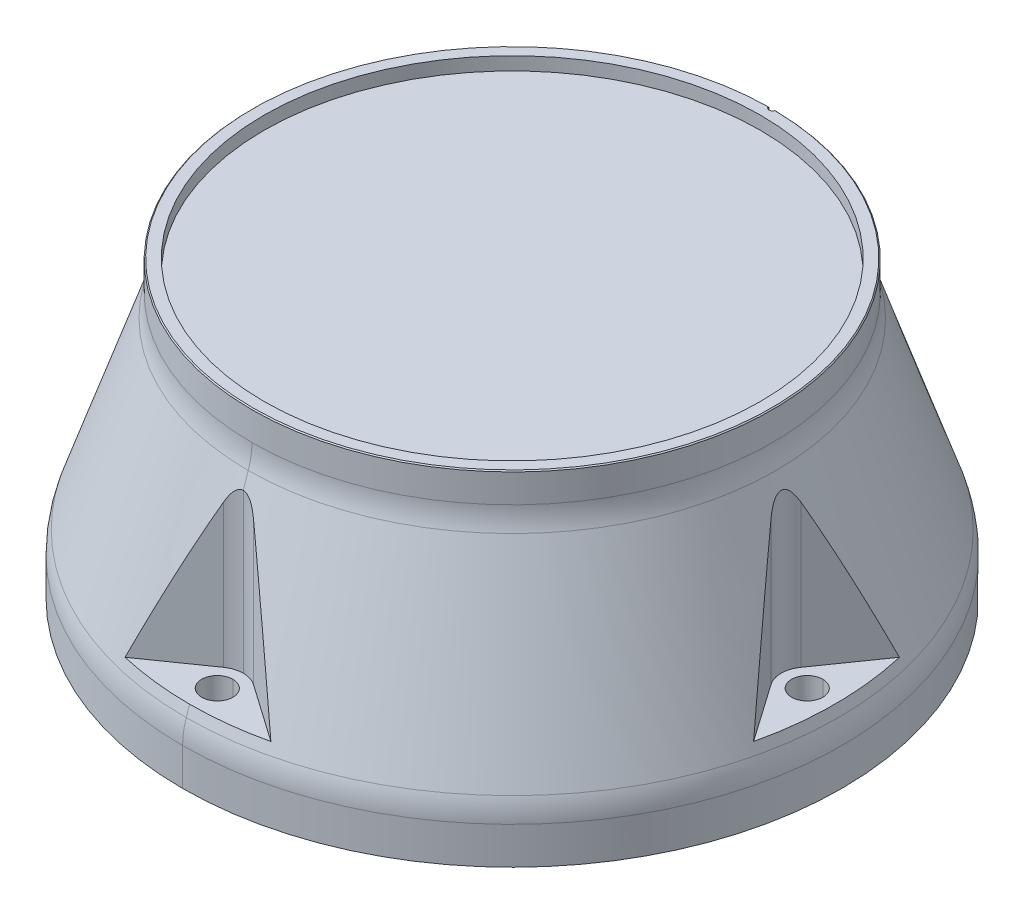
ISO-10303-21;
HEADER;
FILE_DESCRIPTION(('STEP AP214'),'2;1');
FILE_NAME('part.step','',(''),(''),'','','');
FILE_SCHEMA(('AUTOMOTIVE_DESIGN { 1 0 10303 214 1 1 1 1 }'));
ENDSEC;
DATA;
#1=APPLICATION_CONTEXT('core data for automotive mechanical design processes');
#2=APPLICATION_PROTOCOL_DEFINITION('international standard','automotive_design',2000,#1);
#3=PRODUCT_CONTEXT('',#1,'mechanical');
#4=PRODUCT('Part','Part','',(#3));
#5=PRODUCT_RELATED_PRODUCT_CATEGORY('part','',(#4));
#6=PRODUCT_DEFINITION_FORMATION('','',#4);
#7=PRODUCT_DEFINITION_CONTEXT('part definition',#1,'design');
#8=PRODUCT_DEFINITION('design','',#6,#7);
#9=PRODUCT_DEFINITION_SHAPE('','',#8);
#10=(LENGTH_UNIT() NAMED_UNIT(*) SI_UNIT(.MILLI.,.METRE.));
#11=(NAMED_UNIT(*) PLANE_ANGLE_UNIT() SI_UNIT($,.RADIAN.));
#12=(NAMED_UNIT(*) SI_UNIT($,.STERADIAN.) SOLID_ANGLE_UNIT());
#13=UNCERTAINTY_MEASURE_WITH_UNIT(LENGTH_MEASURE(1.E-05),#10,'distance_accuracy_value','');
#14=(GEOMETRIC_REPRESENTATION_CONTEXT(3) GLOBAL_UNCERTAINTY_ASSIGNED_CONTEXT((#13)) GLOBAL_UNIT_ASSIGNED_CONTEXT((#10,
#11,#12)) REPRESENTATION_CONTEXT('',''));
#15=CARTESIAN_POINT('',(0.,0.,0.));
#16=DIRECTION('',(0.,0.,1.));
#17=DIRECTION('',(1.,0.,0.));
#18=AXIS2_PLACEMENT_3D('',#15,#16,#17);
#19=CARTESIAN_POINT('',(0.,82.,-75.));
#20=DIRECTION('',(0.,1.,0.));
#21=DIRECTION('',(0.,0.,1.));
#22=AXIS2_PLACEMENT_3D('',#19,#20,#21);
#23=CYLINDRICAL_SURFACE('',#22,1.);
#24=CARTESIAN_POINT('',(0.,84.8,-75.));
#25=DIRECTION('',(0.,1.,0.));
#26=DIRECTION('',(0.,0.,1.));
#27=AXIS2_PLACEMENT_3D('',#24,#25,#26);
#28=CIRCLE('',#27,1.);
#29=CARTESIAN_POINT('',(0.952397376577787,84.8000000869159,-74.6939519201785));
#30=VERTEX_POINT('',#29);
#31=CARTESIAN_POINT('',(0.,84.8,-74.));
#32=VERTEX_POINT('',#31);
#33=EDGE_CURVE('E562',#30,#32,#28,.F.);
#34=ORIENTED_EDGE('',*,*,#33,.F.);
#35=CARTESIAN_POINT('',(0.952044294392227,84.7999875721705,-74.6940397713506));
#36=CARTESIAN_POINT('',(0.956875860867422,84.7849145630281,-74.7090742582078));
#37=CARTESIAN_POINT('',(0.961331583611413,84.769776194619,-74.7241610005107));
#38=CARTESIAN_POINT('',(0.967342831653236,84.7474166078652,-74.7464208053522));
#39=CARTESIAN_POINT('',(0.969186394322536,84.7402403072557,-74.753561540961));
#40=CARTESIAN_POINT('',(0.973275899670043,84.7235551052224,-74.7701550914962));
#41=CARTESIAN_POINT('',(0.97546092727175,84.7140372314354,-74.7796139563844));
#42=CARTESIAN_POINT('',(0.979838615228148,84.6936336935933,-74.7999035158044));
#43=CARTESIAN_POINT('',(0.981988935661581,84.6827443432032,-74.81073963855));
#44=CARTESIAN_POINT('',(0.986169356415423,84.6595957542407,-74.8337961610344));
#45=CARTESIAN_POINT('',(0.988151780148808,84.6473334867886,-74.8460221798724));
#46=CARTESIAN_POINT('',(0.991851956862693,84.6214387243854,-74.8718660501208));
#47=CARTESIAN_POINT('',(0.993516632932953,84.6078038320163,-74.8854891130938));
#48=CARTESIAN_POINT('',(0.996419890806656,84.579163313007,-74.9141250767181));
#49=CARTESIAN_POINT('',(0.997599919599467,84.5641557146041,-74.9291419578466));
#50=CARTESIAN_POINT('',(0.999356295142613,84.532769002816,-74.9605506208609));
#51=CARTESIAN_POINT('',(0.999868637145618,84.5163882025,-74.9769443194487));
#52=CARTESIAN_POINT('',(0.999977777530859,84.5000000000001,-74.9933333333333));
#53=B_SPLINE_CURVE_WITH_KNOTS('',3,(#35,#36,#37,#38,#39,#40,#41,#42,#43,#44,#45,#46,#47,#48,#49,
#50,#51,#52),.UNSPECIFIED.,.F.,.F.,(4,2,2,2,2,2,2,2,4),(0.,0.065484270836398,0.0963536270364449,
0.137136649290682,0.183668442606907,0.235949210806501,0.293979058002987,0.357758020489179,
0.427286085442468),.UNSPECIFIED.);
#54=CARTESIAN_POINT('',(0.999977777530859,84.5,-74.9933333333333));
#55=VERTEX_POINT('',#54);
#56=EDGE_CURVE('E570',#30,#55,#53,.T.);
#57=ORIENTED_EDGE('',*,*,#56,.T.);
#58=DIRECTION('',(0.,-1.,0.));
#59=VECTOR('',#58,1.);
#60=CARTESIAN_POINT('',(0.999977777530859,83.5,-74.9933333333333));
#61=LINE('',#60,#59);
#62=CARTESIAN_POINT('',(0.999977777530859,82.,-74.9933333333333));
#63=VERTEX_POINT('',#62);
#64=EDGE_CURVE('E581',#55,#63,#61,.T.);
#65=ORIENTED_EDGE('',*,*,#64,.T.);
#66=CARTESIAN_POINT('',(0.,82.,-75.));
#67=DIRECTION('',(0.,1.,0.));
#68=DIRECTION('',(0.,0.,1.));
#69=AXIS2_PLACEMENT_3D('',#66,#67,#68);
#70=CIRCLE('',#69,1.);
#71=CARTESIAN_POINT('',(0.,82.,-74.));
#72=VERTEX_POINT('',#71);
#73=EDGE_CURVE('E1300',#72,#63,#70,.T.);
#74=ORIENTED_EDGE('',*,*,#73,.F.);
#75=DIRECTION('',(0.,1.,0.));
#76=VECTOR('',#75,1.);
#77=CARTESIAN_POINT('',(0.,82.,-74.));
#78=LINE('',#77,#76);
#79=EDGE_CURVE('E574',#72,#32,#78,.T.);
#80=ORIENTED_EDGE('',*,*,#79,.T.);
#81=EDGE_LOOP('',(#34,#57,#65,#74,#80));
#82=FACE_BOUND('',#81,.T.);
#83=ADVANCED_FACE('F43',(#82),#23,.F.);
#84=CARTESIAN_POINT('',(0.,100.390423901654,0.));
#85=DIRECTION('',(0.,1.,0.));
#86=DIRECTION('',(0.,0.,1.));
#87=AXIS2_PLACEMENT_3D('',#84,#85,#86);
#88=CYLINDRICAL_SURFACE('',#87,71.5);
#89=DIRECTION('',(0.,1.,0.));
#90=VECTOR('',#89,1.);
#91=CARTESIAN_POINT('',(0.,100.390423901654,71.5));
#92=LINE('',#91,#90);
#93=CARTESIAN_POINT('',(-8.28313419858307E-13,84.5000000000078,71.5));
#94=VERTEX_POINT('',#93);
#95=CARTESIAN_POINT('',(0.,84.8,71.5));
#96=VERTEX_POINT('',#95);
#97=EDGE_CURVE('E1689',#94,#96,#92,.T.);
#98=ORIENTED_EDGE('',*,*,#97,.F.);
#99=ORIENTED_EDGE('',*,*,#97,.T.);
#100=CARTESIAN_POINT('',(0.,84.8,0.));
#101=DIRECTION('',(0.,1.,0.));
#102=DIRECTION('',(0.,0.,1.));
#103=AXIS2_PLACEMENT_3D('',#100,#101,#102);
#104=CIRCLE('',#103,71.5);
#105=CARTESIAN_POINT('',(0.,84.8,-71.5));
#106=VERTEX_POINT('',#105);
#107=EDGE_CURVE('E575',#106,#96,#104,.F.);
#108=ORIENTED_EDGE('',*,*,#107,.F.);
#109=DIRECTION('',(0.,1.,0.));
#110=VECTOR('',#109,1.);
#111=CARTESIAN_POINT('',(0.,100.390423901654,-71.5));
#112=LINE('',#111,#110);
#113=CARTESIAN_POINT('',(0.,81.,-71.5));
#114=VERTEX_POINT('',#113);
#115=EDGE_CURVE('E1116',#114,#106,#112,.T.);
#116=ORIENTED_EDGE('',*,*,#115,.F.);
#117=CARTESIAN_POINT('',(0.,81.,0.));
#118=DIRECTION('',(0.,1.,0.));
#119=DIRECTION('',(0.,0.,1.));
#120=AXIS2_PLACEMENT_3D('',#117,#118,#119);
#121=CIRCLE('',#120,71.5);
#122=CARTESIAN_POINT('',(0.,81.,71.5));
#123=VERTEX_POINT('',#122);
#124=EDGE_CURVE('E1117',#123,#114,#121,.T.);
#125=ORIENTED_EDGE('',*,*,#124,.F.);
#126=DIRECTION('',(0.,1.,0.));
#127=VECTOR('',#126,1.);
#128=CARTESIAN_POINT('',(0.,100.390423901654,71.5));
#129=LINE('',#128,#127);
#130=CARTESIAN_POINT('',(0.,81.5,71.5));
#131=VERTEX_POINT('',#130);
#132=EDGE_CURVE('E1707',#123,#131,#129,.T.);
#133=ORIENTED_EDGE('',*,*,#132,.T.);
#134=ORIENTED_EDGE('',*,*,#132,.F.);
#135=CARTESIAN_POINT('',(0.,81.,0.));
#136=DIRECTION('',(0.,1.,0.));
#137=DIRECTION('',(0.,0.,1.));
#138=AXIS2_PLACEMENT_3D('',#135,#136,#137);
#139=CIRCLE('',#138,71.5);
#140=EDGE_CURVE('E1122',#114,#123,#139,.T.);
#141=ORIENTED_EDGE('',*,*,#140,.F.);
#142=ORIENTED_EDGE('',*,*,#115,.T.);
#143=CARTESIAN_POINT('',(0.,84.8,0.));
#144=DIRECTION('',(0.,1.,0.));
#145=DIRECTION('',(0.,0.,1.));
#146=AXIS2_PLACEMENT_3D('',#143,#144,#145);
#147=CIRCLE('',#146,71.5);
#148=EDGE_CURVE('E58',#96,#106,#147,.F.);
#149=ORIENTED_EDGE('',*,*,#148,.F.);
#150=EDGE_LOOP('',(#98,#99,#108,#116,#125,#133,#134,#141,#142,#149));
#151=FACE_BOUND('',#150,.T.);
#152=ADVANCED_FACE('F1601',(#151),#88,.F.);
#153=CARTESIAN_POINT('',(0.,82.,-75.));
#154=DIRECTION('',(0.,1.,0.));
#155=DIRECTION('',(0.,0.,1.));
#156=AXIS2_PLACEMENT_3D('',#153,#154,#155);
#157=CYLINDRICAL_SURFACE('',#156,1.);
#158=CARTESIAN_POINT('',(0.,84.8,-75.));
#159=DIRECTION('',(0.,1.,0.));
#160=DIRECTION('',(0.,0.,1.));
#161=AXIS2_PLACEMENT_3D('',#158,#159,#160);
#162=CIRCLE('',#161,1.);
#163=CARTESIAN_POINT('',(-0.952291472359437,84.8000001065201,-74.693618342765));
#164=VERTEX_POINT('',#163);
#165=EDGE_CURVE('E66',#32,#164,#162,.F.);
#166=ORIENTED_EDGE('',*,*,#165,.F.);
#167=ORIENTED_EDGE('',*,*,#79,.F.);
#168=CARTESIAN_POINT('',(0.,82.,-75.));
#169=DIRECTION('',(0.,1.,0.));
#170=DIRECTION('',(0.,0.,1.));
#171=AXIS2_PLACEMENT_3D('',#168,#169,#170);
#172=CIRCLE('',#171,1.);
#173=CARTESIAN_POINT('',(-0.999977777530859,82.,-74.9933333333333));
#174=VERTEX_POINT('',#173);
#175=EDGE_CURVE('E1704',#174,#72,#172,.T.);
#176=ORIENTED_EDGE('',*,*,#175,.F.);
#177=DIRECTION('',(0.,1.,0.));
#178=VECTOR('',#177,1.);
#179=CARTESIAN_POINT('',(-0.999977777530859,83.5,-74.9933333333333));
#180=LINE('',#179,#178);
#181=CARTESIAN_POINT('',(-0.999977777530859,84.5,-74.9933333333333));
#182=VERTEX_POINT('',#181);
#183=EDGE_CURVE('E617',#174,#182,#180,.T.);
#184=ORIENTED_EDGE('',*,*,#183,.T.);
#185=CARTESIAN_POINT('',(-0.999977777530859,84.5000000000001,-74.9933333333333));
#186=CARTESIAN_POINT('',(-0.999882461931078,84.514311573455,-74.979021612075));
#187=CARTESIAN_POINT('',(-0.999479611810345,84.5286090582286,-74.9646977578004));
#188=CARTESIAN_POINT('',(-0.998080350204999,84.5566851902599,-74.9365376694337));
#189=CARTESIAN_POINT('',(-0.997104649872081,84.5704649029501,-74.9227014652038));
#190=CARTESIAN_POINT('',(-0.994619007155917,84.5975055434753,-74.8955373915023));
#191=CARTESIAN_POINT('',(-0.993129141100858,84.6107676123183,-74.8822088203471));
#192=CARTESIAN_POINT('',(-0.989673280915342,84.6367728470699,-74.8560760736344));
#193=CARTESIAN_POINT('',(-0.987726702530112,84.649517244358,-74.8432705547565));
#194=CARTESIAN_POINT('',(-0.983413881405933,84.6744870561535,-74.8181957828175));
#195=CARTESIAN_POINT('',(-0.981066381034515,84.6867138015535,-74.8059246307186));
#196=CARTESIAN_POINT('',(-0.976006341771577,84.7106481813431,-74.7819266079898));
#197=CARTESIAN_POINT('',(-0.973311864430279,84.7223572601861,-74.7701973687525));
#198=CARTESIAN_POINT('',(-0.967610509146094,84.7452562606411,-74.7472877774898));
#199=CARTESIAN_POINT('',(-0.96462100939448,84.7564477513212,-74.7361046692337));
#200=CARTESIAN_POINT('',(-0.958379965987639,84.7783111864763,-74.7142886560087));
#201=CARTESIAN_POINT('',(-0.955145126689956,84.7889848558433,-74.7036526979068));
#202=CARTESIAN_POINT('',(-0.951727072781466,84.7996373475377,-74.6930544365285));
#203=B_SPLINE_CURVE_WITH_KNOTS('',3,(#185,#186,#187,#188,#189,#190,#191,#192,#193,#194,#195,
#196,#197,#198,#199,#200,#201,#202),.UNSPECIFIED.,.F.,.F.,(4,2,2,2,2,2,2,2,4),(0.,
0.0607175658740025,0.119364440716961,0.175940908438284,0.230447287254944,0.282883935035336,
0.333251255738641,0.381549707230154,0.427779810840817),.UNSPECIFIED.);
#204=EDGE_CURVE('E627',#182,#164,#203,.T.);
#205=ORIENTED_EDGE('',*,*,#204,.T.);
#206=EDGE_LOOP('',(#166,#167,#176,#184,#205));
#207=FACE_BOUND('',#206,.T.);
#208=ADVANCED_FACE('F604',(#207),#157,.F.);
#209=CARTESIAN_POINT('',(0.,85.,0.));
#210=DIRECTION('',(0.,-1.,0.));
#211=DIRECTION('',(0.,0.,-1.));
#212=AXIS2_PLACEMENT_3D('',#209,#210,#211);
#213=CONICAL_SURFACE('',#212,74.5,0.785398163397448);
#214=ORIENTED_EDGE('',*,*,#56,.F.);
#215=CARTESIAN_POINT('',(0.,84.8,0.));
#216=DIRECTION('',(0.,1.,0.));
#217=DIRECTION('',(0.,0.,1.));
#218=AXIS2_PLACEMENT_3D('',#215,#216,#217);
#219=CIRCLE('',#218,74.7);
#220=EDGE_CURVE('E11',#30,#164,#219,.F.);
#221=ORIENTED_EDGE('',*,*,#220,.T.);
#222=ORIENTED_EDGE('',*,*,#204,.F.);
#223=CARTESIAN_POINT('',(0.,84.5,0.));
#224=DIRECTION('',(0.,-1.,0.));
#225=DIRECTION('',(0.,0.,1.));
#226=AXIS2_PLACEMENT_3D('',#223,#224,#225);
#227=CIRCLE('',#226,75.);
#228=EDGE_CURVE('E580',#55,#182,#227,.T.);
#229=ORIENTED_EDGE('',*,*,#228,.F.);
#230=EDGE_LOOP('',(#214,#221,#222,#229));
#231=FACE_BOUND('',#230,.T.);
#232=ADVANCED_FACE('F579',(#231),#213,.T.);
#233=CARTESIAN_POINT('',(63.6396103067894,2.5,-42.4264068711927));
#234=DIRECTION('',(0.,-1.,0.));
#235=DIRECTION('',(0.,0.,-1.));
#236=AXIS2_PLACEMENT_3D('',#233,#234,#235);
#237=CYLINDRICAL_SURFACE('',#236,1.24999999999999);
#238=CARTESIAN_POINT('',(63.6396103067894,10.,-42.4264068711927));
#239=DIRECTION('',(0.,-1.,0.));
#240=DIRECTION('',(0.,0.,-1.));
#241=AXIS2_PLACEMENT_3D('',#238,#239,#240);
#242=CIRCLE('',#241,1.24999999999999);
#243=CARTESIAN_POINT('',(63.6396103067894,10.,-41.1764068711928));
#244=VERTEX_POINT('',#243);
#245=CARTESIAN_POINT('',(63.6396103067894,10.,-43.6764068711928));
#246=VERTEX_POINT('',#245);
#247=EDGE_CURVE('E1278',#244,#246,#242,.T.);
#248=ORIENTED_EDGE('',*,*,#247,.F.);
#249=DIRECTION('',(0.,-1.,0.));
#250=VECTOR('',#249,1.);
#251=CARTESIAN_POINT('',(63.6396103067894,2.5,-41.1764068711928));
#252=LINE('',#251,#250);
#253=CARTESIAN_POINT('',(63.6396103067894,2.5,-41.1764068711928));
#254=VERTEX_POINT('',#253);
#255=EDGE_CURVE('E52',#244,#254,#252,.T.);
#256=ORIENTED_EDGE('',*,*,#255,.T.);
#257=CARTESIAN_POINT('',(63.6396103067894,2.5,-42.4264068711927));
#258=DIRECTION('',(0.,-1.,0.));
#259=DIRECTION('',(0.,0.,-1.));
#260=AXIS2_PLACEMENT_3D('',#257,#258,#259);
#261=CIRCLE('',#260,1.24999999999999);
#262=CARTESIAN_POINT('',(63.6396103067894,2.5,-43.6764068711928));
#263=VERTEX_POINT('',#262);
#264=EDGE_CURVE('E1282',#254,#263,#261,.T.);
#265=ORIENTED_EDGE('',*,*,#264,.T.);
#266=DIRECTION('',(0.,-1.,0.));
#267=VECTOR('',#266,1.);
#268=CARTESIAN_POINT('',(63.6396103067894,2.5,-43.6764068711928));
#269=LINE('',#268,#267);
#270=EDGE_CURVE('E1306',#246,#263,#269,.T.);
#271=ORIENTED_EDGE('',*,*,#270,.F.);
#272=EDGE_LOOP('',(#248,#256,#265,#271));
#273=FACE_BOUND('',#272,.T.);
#274=ADVANCED_FACE('F603',(#273),#237,.F.);
#275=CARTESIAN_POINT('',(63.6396103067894,10.,-42.4264068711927));
#276=DIRECTION('',(0.,-1.,0.));
#277=DIRECTION('',(0.,0.,-1.));
#278=AXIS2_PLACEMENT_3D('',#275,#276,#277);
#279=CONICAL_SURFACE('',#278,1.24999999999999,1.02974425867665);
#280=DIRECTION('',(0.,-0.515038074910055,-0.857167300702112));
#281=VECTOR('',#280,1.);
#282=CARTESIAN_POINT('',(63.6396103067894,10.,-43.6764068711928));
#283=LINE('',#282,#281);
#284=CARTESIAN_POINT('',(63.6396103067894,10.7510757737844,-42.4264068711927));
#285=VERTEX_POINT('',#284);
#286=EDGE_CURVE('E1240',#285,#246,#283,.T.);
#287=ORIENTED_EDGE('',*,*,#286,.F.);
#288=DIRECTION('',(0.,-0.515038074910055,0.857167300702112));
#289=VECTOR('',#288,1.);
#290=CARTESIAN_POINT('',(63.6396103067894,10.,-41.1764068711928));
#291=LINE('',#290,#289);
#292=EDGE_CURVE('E1394',#285,#244,#291,.T.);
#293=ORIENTED_EDGE('',*,*,#292,.T.);
#294=ORIENTED_EDGE('',*,*,#247,.T.);
#295=EDGE_LOOP('',(#287,#293,#294));
#296=FACE_BOUND('',#295,.T.);
#297=ADVANCED_FACE('F761',(#296),#279,.F.);
#298=CARTESIAN_POINT('',(42.4264068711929,2.5,-63.6396103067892));
#299=DIRECTION('',(0.,-1.,0.));
#300=DIRECTION('',(0.,0.,-1.));
#301=AXIS2_PLACEMENT_3D('',#298,#299,#300);
#302=CYLINDRICAL_SURFACE('',#301,1.24999999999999);
#303=CARTESIAN_POINT('',(42.4264068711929,10.,-63.6396103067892));
#304=DIRECTION('',(0.,-1.,0.));
#305=DIRECTION('',(0.,0.,-1.));
#306=AXIS2_PLACEMENT_3D('',#303,#304,#305);
#307=CIRCLE('',#306,1.24999999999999);
#308=CARTESIAN_POINT('',(42.4264068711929,10.,-62.3896103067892));
#309=VERTEX_POINT('',#308);
#310=CARTESIAN_POINT('',(42.4264068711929,10.,-64.8896103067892));
#311=VERTEX_POINT('',#310);
#312=EDGE_CURVE('E1148',#309,#311,#307,.T.);
#313=ORIENTED_EDGE('',*,*,#312,.F.);
#314=DIRECTION('',(0.,-1.,0.));
#315=VECTOR('',#314,1.);
#316=CARTESIAN_POINT('',(42.4264068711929,2.5,-62.3896103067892));
#317=LINE('',#316,#315);
#318=CARTESIAN_POINT('',(42.4264068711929,2.5,-62.3896103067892));
#319=VERTEX_POINT('',#318);
#320=EDGE_CURVE('E1274',#309,#319,#317,.T.);
#321=ORIENTED_EDGE('',*,*,#320,.T.);
#322=CARTESIAN_POINT('',(42.4264068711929,2.5,-63.6396103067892));
#323=DIRECTION('',(0.,-1.,0.));
#324=DIRECTION('',(0.,0.,-1.));
#325=AXIS2_PLACEMENT_3D('',#322,#323,#324);
#326=CIRCLE('',#325,1.24999999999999);
#327=CARTESIAN_POINT('',(42.4264068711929,2.5,-64.8896103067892));
#328=VERTEX_POINT('',#327);
#329=EDGE_CURVE('E1255',#319,#328,#326,.T.);
#330=ORIENTED_EDGE('',*,*,#329,.T.);
#331=DIRECTION('',(0.,-1.,0.));
#332=VECTOR('',#331,1.);
#333=CARTESIAN_POINT('',(42.4264068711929,2.5,-64.8896103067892));
#334=LINE('',#333,#332);
#335=EDGE_CURVE('E1178',#311,#328,#334,.T.);
#336=ORIENTED_EDGE('',*,*,#335,.F.);
#337=EDGE_LOOP('',(#313,#321,#330,#336));
#338=FACE_BOUND('',#337,.T.);
#339=ADVANCED_FACE('F746',(#338),#302,.F.);
#340=CARTESIAN_POINT('',(42.4264068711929,10.,-63.6396103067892));
#341=DIRECTION('',(0.,-1.,0.));
#342=DIRECTION('',(0.,0.,-1.));
#343=AXIS2_PLACEMENT_3D('',#340,#341,#342);
#344=CONICAL_SURFACE('',#343,1.24999999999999,1.02974425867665);
#345=DIRECTION('',(0.,-0.515038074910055,-0.857167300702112));
#346=VECTOR('',#345,1.);
#347=CARTESIAN_POINT('',(42.4264068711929,10.,-64.8896103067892));
#348=LINE('',#347,#346);
#349=CARTESIAN_POINT('',(42.4264068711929,10.7510757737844,-63.6396103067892));
#350=VERTEX_POINT('',#349);
#351=EDGE_CURVE('E1236',#350,#311,#348,.T.);
#352=ORIENTED_EDGE('',*,*,#351,.F.);
#353=DIRECTION('',(0.,-0.515038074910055,0.857167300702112));
#354=VECTOR('',#353,1.);
#355=CARTESIAN_POINT('',(42.4264068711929,10.,-62.3896103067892));
#356=LINE('',#355,#354);
#357=EDGE_CURVE('E1151',#350,#309,#356,.T.);
#358=ORIENTED_EDGE('',*,*,#357,.T.);
#359=ORIENTED_EDGE('',*,*,#312,.T.);
#360=EDGE_LOOP('',(#352,#358,#359));
#361=FACE_BOUND('',#360,.T.);
#362=ADVANCED_FACE('F2434',(#361),#344,.F.);
#363=CARTESIAN_POINT('',(70.0035713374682,10.,41.7193000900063));
#364=DIRECTION('',(0.,-1.,0.));
#365=DIRECTION('',(0.,0.,-1.));
#366=AXIS2_PLACEMENT_3D('',#363,#364,#365);
#367=CYLINDRICAL_SURFACE('',#366,4.);
#368=CARTESIAN_POINT('',(70.0035713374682,10.,41.7193000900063));
#369=DIRECTION('',(0.,-1.,0.));
#370=DIRECTION('',(0.,0.,-1.));
#371=AXIS2_PLACEMENT_3D('',#368,#369,#370);
#372=CIRCLE('',#371,4.);
#373=CARTESIAN_POINT('',(70.0035713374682,10.,37.7193000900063));
#374=VERTEX_POINT('',#373);
#375=CARTESIAN_POINT('',(72.8319984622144,10.,38.8908729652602));
#376=VERTEX_POINT('',#375);
#377=EDGE_CURVE('E1001',#374,#376,#372,.T.);
#378=ORIENTED_EDGE('',*,*,#377,.F.);
#379=DIRECTION('',(0.,-1.,0.));
#380=VECTOR('',#379,1.);
#381=CARTESIAN_POINT('',(70.0035713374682,10.,37.7193000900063));
#382=LINE('',#381,#380);
#383=CARTESIAN_POINT('',(70.0035713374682,0.,37.7193000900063));
#384=VERTEX_POINT('',#383);
#385=EDGE_CURVE('E1152',#374,#384,#382,.T.);
#386=ORIENTED_EDGE('',*,*,#385,.T.);
#387=CARTESIAN_POINT('',(70.0035713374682,0.,41.7193000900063));
#388=DIRECTION('',(0.,-1.,0.));
#389=DIRECTION('',(0.,0.,-1.));
#390=AXIS2_PLACEMENT_3D('',#387,#388,#389);
#391=CIRCLE('',#390,4.);
#392=CARTESIAN_POINT('',(72.8319984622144,0.,38.8908729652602));
#393=VERTEX_POINT('',#392);
#394=EDGE_CURVE('E1370',#384,#393,#391,.T.);
#395=ORIENTED_EDGE('',*,*,#394,.T.);
#396=DIRECTION('',(0.,-1.,0.));
#397=VECTOR('',#396,1.);
#398=CARTESIAN_POINT('',(72.8319984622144,10.,38.8908729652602));
#399=LINE('',#398,#397);
#400=EDGE_CURVE('E1127',#376,#393,#399,.T.);
#401=ORIENTED_EDGE('',*,*,#400,.F.);
#402=EDGE_LOOP('',(#378,#386,#395,#401));
#403=FACE_BOUND('',#402,.T.);
#404=ADVANCED_FACE('F1897',(#403),#367,.F.);
#405=CARTESIAN_POINT('',(-42.4264068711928,10.,-70.7106781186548));
#406=DIRECTION('',(0.,-1.,0.));
#407=DIRECTION('',(0.,0.,-1.));
#408=AXIS2_PLACEMENT_3D('',#405,#406,#407);
#409=CYLINDRICAL_SURFACE('',#408,4.);
#410=CARTESIAN_POINT('',(-42.4264068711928,10.,-70.7106781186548));
#411=DIRECTION('',(0.,-1.,0.));
#412=DIRECTION('',(0.,0.,-1.));
#413=AXIS2_PLACEMENT_3D('',#410,#411,#412);
#414=CIRCLE('',#413,4.);
#415=CARTESIAN_POINT('',(-42.4264068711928,10.,-66.7106781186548));
#416=VERTEX_POINT('',#415);
#417=CARTESIAN_POINT('',(-42.4264068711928,10.,-74.7106781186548));
#418=VERTEX_POINT('',#417);
#419=EDGE_CURVE('E1173',#416,#418,#414,.T.);
#420=ORIENTED_EDGE('',*,*,#419,.F.);
#421=DIRECTION('',(0.,-1.,0.));
#422=VECTOR('',#421,1.);
#423=CARTESIAN_POINT('',(-42.4264068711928,10.,-66.7106781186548));
#424=LINE('',#423,#422);
#425=CARTESIAN_POINT('',(-42.4264068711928,0.,-66.7106781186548));
#426=VERTEX_POINT('',#425);
#427=EDGE_CURVE('E1222',#416,#426,#424,.T.);
#428=ORIENTED_EDGE('',*,*,#427,.T.);
#429=CARTESIAN_POINT('',(-42.4264068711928,0.,-70.7106781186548));
#430=DIRECTION('',(0.,-1.,0.));
#431=DIRECTION('',(0.,0.,-1.));
#432=AXIS2_PLACEMENT_3D('',#429,#430,#431);
#433=CIRCLE('',#432,4.);
#434=CARTESIAN_POINT('',(-42.4264068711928,0.,-74.7106781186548));
#435=VERTEX_POINT('',#434);
#436=EDGE_CURVE('E1218',#426,#435,#433,.T.);
#437=ORIENTED_EDGE('',*,*,#436,.T.);
#438=DIRECTION('',(0.,-1.,0.));
#439=VECTOR('',#438,1.);
#440=CARTESIAN_POINT('',(-42.4264068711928,10.,-74.7106781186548));
#441=LINE('',#440,#439);
#442=EDGE_CURVE('E1133',#418,#435,#441,.T.);
#443=ORIENTED_EDGE('',*,*,#442,.F.);
#444=EDGE_LOOP('',(#420,#428,#437,#443));
#445=FACE_BOUND('',#444,.T.);
#446=ADVANCED_FACE('F1969',(#445),#409,.F.);
#447=CARTESIAN_POINT('',(0.,10.7023274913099,0.));
#448=DIRECTION('',(0.,-1.,0.));
#449=DIRECTION('',(0.,0.,-1.));
#450=AXIS2_PLACEMENT_3D('',#447,#448,#449);
#451=TOROIDAL_SURFACE('',#450,75.,20.);
#452=CARTESIAN_POINT('',(0.,17.1231131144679,0.));
#453=DIRECTION('',(0.,1.,0.));
#454=DIRECTION('',(0.,0.,1.));
#455=AXIS2_PLACEMENT_3D('',#452,#453,#454);
#456=CIRCLE('',#455,93.941317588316);
#457=CARTESIAN_POINT('',(0.,17.1231131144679,93.941317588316));
#458=VERTEX_POINT('',#457);
#459=CARTESIAN_POINT('',(0.,17.1231131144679,-93.941317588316));
#460=VERTEX_POINT('',#459);
#461=EDGE_CURVE('E1327',#458,#460,#456,.T.);
#462=ORIENTED_EDGE('',*,*,#461,.F.);
#463=CARTESIAN_POINT('',(0.,10.7023274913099,75.));
#464=DIRECTION('',(1.,0.,0.));
#465=DIRECTION('',(0.,0.,-1.));
#466=AXIS2_PLACEMENT_3D('',#463,#464,#465);
#467=CIRCLE('',#466,20.);
#468=CARTESIAN_POINT('',(0.,10.7023274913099,95.));
#469=VERTEX_POINT('',#468);
#470=EDGE_CURVE('E1223',#458,#469,#467,.T.);
#471=ORIENTED_EDGE('',*,*,#470,.T.);
#472=CARTESIAN_POINT('',(0.,10.7023274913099,0.));
#473=DIRECTION('',(0.,-1.,0.));
#474=DIRECTION('',(0.,0.,-1.));
#475=AXIS2_PLACEMENT_3D('',#472,#473,#474);
#476=CIRCLE('',#475,95.);
#477=CARTESIAN_POINT('',(70.4307481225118,10.7023274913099,-63.7535075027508));
#478=VERTEX_POINT('',#477);
#479=EDGE_CURVE('E1077',#478,#469,#476,.T.);
#480=ORIENTED_EDGE('',*,*,#479,.F.);
#481=CARTESIAN_POINT('',(70.4307481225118,10.7023274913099,-63.7535075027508));
#482=CARTESIAN_POINT('',(70.3838464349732,10.7913709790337,-63.805323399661));
#483=CARTESIAN_POINT('',(70.3347730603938,10.878460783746,-63.8585335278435));
#484=CARTESIAN_POINT('',(70.2327006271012,11.0481313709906,-63.9674861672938));
#485=CARTESIAN_POINT('',(70.1797157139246,11.1307266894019,-64.0232192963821));
#486=CARTESIAN_POINT('',(70.0699280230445,11.2914003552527,-64.1373025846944));
#487=CARTESIAN_POINT('',(70.0131264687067,11.3694801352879,-64.1956519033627));
#488=CARTESIAN_POINT('',(69.8958172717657,11.5211329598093,-64.3150335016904));
#489=CARTESIAN_POINT('',(69.8352995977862,11.5946926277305,-64.3760729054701));
#490=CARTESIAN_POINT('',(69.710759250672,11.7371972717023,-64.5007937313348));
#491=CARTESIAN_POINT('',(69.6467228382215,11.8061214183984,-64.5644852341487));
#492=CARTESIAN_POINT('',(69.5158720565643,11.9384832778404,-64.69396363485));
#493=CARTESIAN_POINT('',(69.4490683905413,12.001939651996,-64.7597422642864));
#494=CARTESIAN_POINT('',(69.3127888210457,12.1233849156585,-64.8934686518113));
#495=CARTESIAN_POINT('',(69.2433139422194,12.1813758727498,-64.9614155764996));
#496=CARTESIAN_POINT('',(69.1017846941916,12.2919135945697,-65.0995436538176));
#497=CARTESIAN_POINT('',(69.0297236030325,12.3444445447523,-65.1697305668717));
#498=CARTESIAN_POINT('',(68.8836485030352,12.4437126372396,-65.3118632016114));
#499=CARTESIAN_POINT('',(68.8096376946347,12.4904586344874,-65.3838060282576));
#500=CARTESIAN_POINT('',(68.6601075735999,12.5778619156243,-65.5291670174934));
#501=CARTESIAN_POINT('',(68.5845946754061,12.6185405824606,-65.6025789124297));
#502=CARTESIAN_POINT('',(68.4321322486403,12.6938363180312,-65.7509340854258));
#503=CARTESIAN_POINT('',(68.3551833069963,12.7284558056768,-65.8258767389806));
#504=CARTESIAN_POINT('',(68.199905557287,12.7916613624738,-65.9773396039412));
#505=CARTESIAN_POINT('',(68.1215734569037,12.8202300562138,-66.0538636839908));
#506=CARTESIAN_POINT('',(67.9635384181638,12.87137040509,-66.2085582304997));
#507=CARTESIAN_POINT('',(67.8838299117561,12.8939024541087,-66.2867361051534));
#508=CARTESIAN_POINT('',(67.7240984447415,12.9324967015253,-66.4437925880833));
#509=CARTESIAN_POINT('',(67.6440775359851,12.9485810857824,-66.5226678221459));
#510=CARTESIAN_POINT('',(67.4837502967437,12.9743011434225,-66.6811462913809));
#511=CARTESIAN_POINT('',(67.4034440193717,12.9839379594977,-66.7607493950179));
#512=CARTESIAN_POINT('',(67.2425532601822,12.9968049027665,-66.9206966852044));
#513=CARTESIAN_POINT('',(67.1619686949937,13.0000148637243,-67.0010424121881));
#514=CARTESIAN_POINT('',(67.0815085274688,13.,-67.0815085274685));
#515=B_SPLINE_CURVE_WITH_KNOTS('',3,(#481,#482,#483,#484,#485,#486,#487,#488,#489,#490,#491,
#492,#493,#494,#495,#496,#497,#498,#499,#500,#501,#502,#503,#504,#505,#506,#507,#508,#509,#510,
#511,#512,#513,#514),.UNSPECIFIED.,.F.,.F.,(4,2,2,2,2,2,2,2,2,2,2,2,2,2,2,2,4),(0.,
0.339544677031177,0.677916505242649,1.01618038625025,1.35540136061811,1.69605678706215,
2.035499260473,2.37481280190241,2.71508325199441,3.05482623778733,3.39334204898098,
3.73172241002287,4.0710616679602,4.4125756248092,4.75290416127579,5.09317236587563,
5.43450660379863),.UNSPECIFIED.);
#516=CARTESIAN_POINT('',(67.0815085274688,13.,-67.0815085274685));
#517=VERTEX_POINT('',#516);
#518=EDGE_CURVE('E1310',#478,#517,#515,.T.);
#519=ORIENTED_EDGE('',*,*,#518,.T.);
#520=CARTESIAN_POINT('',(67.0815085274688,13.,-67.0815085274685));
#521=CARTESIAN_POINT('',(67.0015213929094,13.0000144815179,-67.1614898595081));
#522=CARTESIAN_POINT('',(66.9216532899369,12.9968418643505,-67.2415940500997));
#523=CARTESIAN_POINT('',(66.7626467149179,12.9841253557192,-67.4015332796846));
#524=CARTESIAN_POINT('',(66.6835067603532,12.9746009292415,-67.4813683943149));
#525=CARTESIAN_POINT('',(66.525940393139,12.9491812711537,-67.6407626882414));
#526=CARTESIAN_POINT('',(66.4475141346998,12.9332846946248,-67.7203218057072));
#527=CARTESIAN_POINT('',(66.2913420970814,12.8951417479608,-67.8791395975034));
#528=CARTESIAN_POINT('',(66.2135996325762,12.8728734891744,-67.9583962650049));
#529=CARTESIAN_POINT('',(66.0590998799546,12.822113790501,-68.1162166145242));
#530=CARTESIAN_POINT('',(65.9823450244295,12.7936092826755,-68.1947784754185));
#531=CARTESIAN_POINT('',(65.8304208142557,12.7304937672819,-68.3505192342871));
#532=CARTESIAN_POINT('',(65.7552476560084,12.6958998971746,-68.427701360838));
#533=CARTESIAN_POINT('',(65.6064311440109,12.6206174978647,-68.5806334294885));
#534=CARTESIAN_POINT('',(65.53278853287,12.5799260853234,-68.6563826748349));
#535=CARTESIAN_POINT('',(65.3869648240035,12.4924603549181,-68.8063886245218));
#536=CARTESIAN_POINT('',(65.3147901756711,12.445663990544,-68.8806387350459));
#537=CARTESIAN_POINT('',(65.1726204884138,12.3465519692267,-69.026755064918));
#538=CARTESIAN_POINT('',(65.1026173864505,12.2942610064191,-69.0986301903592));
#539=CARTESIAN_POINT('',(64.9648364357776,12.1842268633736,-69.2398129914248));
#540=CARTESIAN_POINT('',(64.8970530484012,12.1264989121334,-69.3091271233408));
#541=CARTESIAN_POINT('',(64.7636335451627,12.0056039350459,-69.4451114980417));
#542=CARTESIAN_POINT('',(64.6979984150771,11.9424344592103,-69.5117805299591));
#543=CARTESIAN_POINT('',(64.5687874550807,11.8106707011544,-69.6423891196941));
#544=CARTESIAN_POINT('',(64.5052199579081,11.742057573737,-69.7063179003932));
#545=CARTESIAN_POINT('',(64.3801787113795,11.5995679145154,-69.8312198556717));
#546=CARTESIAN_POINT('',(64.3187160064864,11.5256685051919,-69.8921779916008));
#547=CARTESIAN_POINT('',(64.1985187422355,11.3732738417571,-70.0103280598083));
#548=CARTESIAN_POINT('',(64.1397769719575,11.2947921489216,-70.0675301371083));
#549=CARTESIAN_POINT('',(64.0249377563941,11.1332530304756,-70.1780774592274));
#550=CARTESIAN_POINT('',(63.9688412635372,11.0501939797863,-70.231421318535));
#551=CARTESIAN_POINT('',(63.8591888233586,10.8795349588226,-70.3341686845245));
#552=CARTESIAN_POINT('',(63.805642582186,10.7919199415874,-70.3835575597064));
#553=CARTESIAN_POINT('',(63.7535075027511,10.7023274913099,-70.4307481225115));
#554=B_SPLINE_CURVE_WITH_KNOTS('',3,(#520,#521,#522,#523,#524,#525,#526,#527,#528,#529,#530,
#531,#532,#533,#534,#535,#536,#537,#538,#539,#540,#541,#542,#543,#544,#545,#546,#547,#548,#549,
#550,#551,#552,#553),.UNSPECIFIED.,.F.,.F.,(4,2,2,2,2,2,2,2,2,2,2,2,2,2,2,2,4),(0.,
0.339303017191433,0.677570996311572,1.01591040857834,1.35542636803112,1.69566070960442,
2.03495239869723,2.37440503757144,2.71511933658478,3.05436304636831,3.39268329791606,
3.73115667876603,4.07085773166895,4.41213004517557,4.75243906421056,5.0928696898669,
5.43450655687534),.UNSPECIFIED.);
#555=CARTESIAN_POINT('',(63.7535075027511,10.7023274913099,-70.4307481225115));
#556=VERTEX_POINT('',#555);
#557=EDGE_CURVE('E988',#517,#556,#554,.T.);
#558=ORIENTED_EDGE('',*,*,#557,.T.);
#559=CARTESIAN_POINT('',(0.,10.7023274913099,0.));
#560=DIRECTION('',(0.,-1.,0.));
#561=DIRECTION('',(0.,0.,-1.));
#562=AXIS2_PLACEMENT_3D('',#559,#560,#561);
#563=CIRCLE('',#562,95.);
#564=CARTESIAN_POINT('',(0.,10.7023274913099,-95.));
#565=VERTEX_POINT('',#564);
#566=EDGE_CURVE('E1027',#565,#556,#563,.T.);
#567=ORIENTED_EDGE('',*,*,#566,.F.);
#568=CARTESIAN_POINT('',(0.,10.7023274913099,-75.));
#569=DIRECTION('',(-1.,0.,0.));
#570=DIRECTION('',(0.,0.,1.));
#571=AXIS2_PLACEMENT_3D('',#568,#569,#570);
#572=CIRCLE('',#571,20.);
#573=EDGE_CURVE('E1129',#460,#565,#572,.T.);
#574=ORIENTED_EDGE('',*,*,#573,.F.);
#575=EDGE_LOOP('',(#462,#471,#480,#519,#558,#567,#574));
#576=FACE_BOUND('',#575,.T.);
#577=ADVANCED_FACE('F667',(#576),#451,.T.);
#578=CARTESIAN_POINT('',(8.90327741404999E-13,85.,85.));
#579=DIRECTION('',(0.,-1.,0.));
#580=DIRECTION('',(0.,0.,-1.));
#581=AXIS2_PLACEMENT_3D('',#578,#579,#580);
#582=CYLINDRICAL_SURFACE('',#581,7.5);
#583=CARTESIAN_POINT('',(4.30182327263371,61.2778492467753,78.8563596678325));
#584=CARTESIAN_POINT('',(4.24545980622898,61.4031296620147,78.8169004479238));
#585=CARTESIAN_POINT('',(4.18776122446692,61.5278813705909,78.7776484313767));
#586=CARTESIAN_POINT('',(4.07175334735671,61.7712053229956,78.7011525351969));
#587=CARTESIAN_POINT('',(4.01355870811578,61.8898266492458,78.6638906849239));
#588=CARTESIAN_POINT('',(3.88547793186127,62.1429432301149,78.584430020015));
#589=CARTESIAN_POINT('',(3.81512547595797,62.2772269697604,78.5423048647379));
#590=CARTESIAN_POINT('',(3.68727408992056,62.5120552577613,78.468684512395));
#591=CARTESIAN_POINT('',(3.63068428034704,62.6130478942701,78.4370378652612));
#592=CARTESIAN_POINT('',(3.50331818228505,62.8334320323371,78.3680320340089));
#593=CARTESIAN_POINT('',(3.43194830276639,62.952515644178,78.3307797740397));
#594=CARTESIAN_POINT('',(3.28836054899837,63.1825840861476,78.2588710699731));
#595=CARTESIAN_POINT('',(3.21634672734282,63.293683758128,78.2241757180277));
#596=CARTESIAN_POINT('',(3.07156106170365,63.5077716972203,78.1573723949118));
#597=CARTESIAN_POINT('',(2.99900173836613,63.6108897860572,78.1252212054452));
#598=CARTESIAN_POINT('',(2.8532076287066,63.8090025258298,78.0634912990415));
#599=CARTESIAN_POINT('',(2.78019369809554,63.9041439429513,78.033864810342));
#600=CARTESIAN_POINT('',(2.65789387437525,64.0560741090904,77.9865742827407));
#601=CARTESIAN_POINT('',(2.60997667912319,64.1138667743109,77.9685902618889));
#602=CARTESIAN_POINT('',(2.51384860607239,64.2261400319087,77.9336646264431));
#603=CARTESIAN_POINT('',(2.46569773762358,64.2806672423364,77.9167081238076));
#604=CARTESIAN_POINT('',(2.36912511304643,64.386405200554,77.8838379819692));
#605=CARTESIAN_POINT('',(2.32076378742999,64.4376660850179,77.867908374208));
#606=CARTESIAN_POINT('',(2.22379223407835,64.5368681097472,77.8370920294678));
#607=CARTESIAN_POINT('',(2.17524252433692,64.5848629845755,77.82218822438));
#608=CARTESIAN_POINT('',(2.07791667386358,64.6775292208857,77.7934230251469));
#609=CARTESIAN_POINT('',(2.02920067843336,64.7222579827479,77.7795434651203));
#610=CARTESIAN_POINT('',(1.93156475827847,64.8083884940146,77.7528257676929));
#611=CARTESIAN_POINT('',(1.88270406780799,64.8498512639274,77.739968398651));
#612=CARTESIAN_POINT('',(1.78480232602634,64.9294455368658,77.7152937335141));
#613=CARTESIAN_POINT('',(1.73581892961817,64.967641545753,77.703456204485));
#614=CARTESIAN_POINT('',(1.63769340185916,65.0407010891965,77.6808187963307));
#615=CARTESIAN_POINT('',(1.58860668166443,65.0756321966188,77.6699978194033));
#616=CARTESIAN_POINT('',(1.50723247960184,65.1306966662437,77.6529405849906));
#617=CARTESIAN_POINT('',(1.47545509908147,65.1515198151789,77.6464903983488));
#618=CARTESIAN_POINT('',(1.41182386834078,65.1918053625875,77.6340116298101));
#619=CARTESIAN_POINT('',(1.37998269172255,65.2112859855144,77.6279774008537));
#620=CARTESIAN_POINT('',(1.31623097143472,65.2488862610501,77.6163310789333));
#621=CARTESIAN_POINT('',(1.28433230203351,65.2670242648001,77.6107132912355));
#622=CARTESIAN_POINT('',(1.22047165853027,65.3019392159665,77.5999000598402));
#623=CARTESIAN_POINT('',(1.18852069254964,65.3187345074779,77.5946989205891));
#624=CARTESIAN_POINT('',(1.1245618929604,65.3509640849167,77.5847191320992));
#625=CARTESIAN_POINT('',(1.09256411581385,65.3664165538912,77.5799348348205));
#626=CARTESIAN_POINT('',(1.02851812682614,65.3959606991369,77.5707887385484));
#627=CARTESIAN_POINT('',(0.996478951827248,65.4100702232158,77.566421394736));
#628=CARTESIAN_POINT('',(0.932356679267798,65.4369288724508,77.5581090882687));
#629=CARTESIAN_POINT('',(0.900281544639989,65.4496953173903,77.5541587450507));
#630=CARTESIAN_POINT('',(0.836093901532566,65.4738684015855,77.5466801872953));
#631=CARTESIAN_POINT('',(0.803988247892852,65.4852916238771,77.5431468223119));
#632=CARTESIAN_POINT('',(0.739746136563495,65.5067790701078,77.5365018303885));
#633=CARTESIAN_POINT('',(0.70761541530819,65.5168589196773,77.5333853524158));
#634=CARTESIAN_POINT('',(0.643329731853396,65.5356606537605,77.5275736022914));
#635=CARTESIAN_POINT('',(0.611179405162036,65.5443969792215,77.5248738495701));
#636=CARTESIAN_POINT('',(0.546861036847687,65.560512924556,77.5198948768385));
#637=CARTESIAN_POINT('',(0.514696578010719,65.5679055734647,77.5176116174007));
#638=CARTESIAN_POINT('',(0.450356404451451,65.5813356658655,77.51346481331));
#639=CARTESIAN_POINT('',(0.418183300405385,65.5873845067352,77.5115977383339));
#640=CARTESIAN_POINT('',(0.35383218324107,65.5981286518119,77.5082823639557));
#641=CARTESIAN_POINT('',(0.321655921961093,65.6028335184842,77.5068311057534));
#642=CARTESIAN_POINT('',(0.257304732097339,65.6108917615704,77.5043462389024));
#643=CARTESIAN_POINT('',(0.225130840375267,65.614252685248,77.5033102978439));
#644=CARTESIAN_POINT('',(0.160790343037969,65.6196245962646,77.501655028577));
#645=CARTESIAN_POINT('',(0.128624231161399,65.6216409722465,77.5010340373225));
#646=CARTESIAN_POINT('',(0.0643054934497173,65.6243279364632,77.5002067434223));
#647=CARTESIAN_POINT('',(0.0321530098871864,65.6250016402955,77.4999994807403));
#648=CARTESIAN_POINT('',(8.90327741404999E-13,65.625,77.5));
#649=B_SPLINE_CURVE_WITH_KNOTS('',3,(#583,#584,#585,#586,#587,#588,#589,#590,#591,#592,#593,
#594,#595,#596,#597,#598,#599,#600,#601,#602,#603,#604,#605,#606,#607,#608,#609,#610,#611,#612,
#613,#614,#615,#616,#617,#618,#619,#620,#621,#622,#623,#624,#625,#626,#627,#628,#629,#630,#631,
#632,#633,#634,#635,#636,#637,#638,#639,#640,#641,#642,#643,#644,#645,#646,#647,#648),
.UNSPECIFIED.,.F.,.F.,(4,2,2,2,2,2,2,2,2,2,2,2,2,2,2,2,2,2,2,2,2,2,2,2,2,2,2,2,2,2,2,2,4),(0.,
0.428790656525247,0.840601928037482,1.31255029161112,1.67255991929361,2.10371031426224,
2.51422645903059,2.90449782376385,3.27497773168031,3.50653808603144,3.73058278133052,
3.9472956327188,4.15687974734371,4.35955966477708,4.55558365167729,4.74522611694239,
4.92879009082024,5.04438046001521,5.15779731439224,5.26914401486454,5.37852979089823,
5.4860698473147,5.59188541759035,5.69610375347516,5.79885804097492,5.90028723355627,
6.0005357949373,6.09975334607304,6.1980942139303,6.29571688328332,6.39278335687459,
6.48945843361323,6.58590891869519),.UNSPECIFIED.);
#650=CARTESIAN_POINT('',(4.3018232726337,61.2778492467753,78.8563596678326));
#651=VERTEX_POINT('',#650);
#652=CARTESIAN_POINT('',(0.,65.625,77.5));
#653=VERTEX_POINT('',#652);
#654=EDGE_CURVE('E1465',#651,#653,#649,.T.);
#655=ORIENTED_EDGE('',*,*,#654,.T.);
#656=DIRECTION('',(0.,-1.,0.));
#657=VECTOR('',#656,1.);
#658=CARTESIAN_POINT('',(8.90327741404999E-13,85.,77.5));
#659=LINE('',#658,#657);
#660=CARTESIAN_POINT('',(8.90327741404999E-13,20.,77.5));
#661=VERTEX_POINT('',#660);
#662=EDGE_CURVE('E1469',#653,#661,#659,.T.);
#663=ORIENTED_EDGE('',*,*,#662,.T.);
#664=CARTESIAN_POINT('',(8.90327741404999E-13,20.,85.));
#665=DIRECTION('',(0.,-1.,0.));
#666=DIRECTION('',(1.,0.,0.));
#667=AXIS2_PLACEMENT_3D('',#664,#665,#666);
#668=CIRCLE('',#667,7.5);
#669=CARTESIAN_POINT('',(4.3018232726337,20.,78.8563596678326));
#670=VERTEX_POINT('',#669);
#671=EDGE_CURVE('E1269',#661,#670,#668,.T.);
#672=ORIENTED_EDGE('',*,*,#671,.T.);
#673=DIRECTION('',(0.,-1.,0.));
#674=VECTOR('',#673,1.);
#675=CARTESIAN_POINT('',(4.3018232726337,85.,78.8563596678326));
#676=LINE('',#675,#674);
#677=EDGE_CURVE('E1494',#651,#670,#676,.T.);
#678=ORIENTED_EDGE('',*,*,#677,.F.);
#679=EDGE_LOOP('',(#655,#663,#672,#678));
#680=FACE_BOUND('',#679,.T.);
#681=ADVANCED_FACE('F1840',(#680),#582,.F.);
#682=CARTESIAN_POINT('',(-85.,85.,0.));
#683=DIRECTION('',(0.,-1.,0.));
#684=DIRECTION('',(0.,0.,-1.));
#685=AXIS2_PLACEMENT_3D('',#682,#683,#684);
#686=CYLINDRICAL_SURFACE('',#685,4.5);
#687=CARTESIAN_POINT('',(-85.,20.,0.));
#688=DIRECTION('',(0.,1.,0.));
#689=DIRECTION('',(0.,0.,-1.));
#690=AXIS2_PLACEMENT_3D('',#687,#688,#689);
#691=CIRCLE('',#690,4.5);
#692=CARTESIAN_POINT('',(-85.,20.,-4.5));
#693=VERTEX_POINT('',#692);
#694=CARTESIAN_POINT('',(-85.,20.,4.5));
#695=VERTEX_POINT('',#694);
#696=EDGE_CURVE('E1187',#693,#695,#691,.T.);
#697=ORIENTED_EDGE('',*,*,#696,.T.);
#698=DIRECTION('',(0.,-1.,0.));
#699=VECTOR('',#698,1.);
#700=CARTESIAN_POINT('',(-85.,85.,4.5));
#701=LINE('',#700,#699);
#702=CARTESIAN_POINT('',(-85.,0.,4.5));
#703=VERTEX_POINT('',#702);
#704=EDGE_CURVE('E1183',#695,#703,#701,.T.);
#705=ORIENTED_EDGE('',*,*,#704,.T.);
#706=CARTESIAN_POINT('',(-85.,0.,0.));
#707=DIRECTION('',(0.,-1.,0.));
#708=DIRECTION('',(0.,0.,1.));
#709=AXIS2_PLACEMENT_3D('',#706,#707,#708);
#710=CIRCLE('',#709,4.5);
#711=CARTESIAN_POINT('',(-85.,0.,-4.5));
#712=VERTEX_POINT('',#711);
#713=EDGE_CURVE('E1188',#703,#712,#710,.T.);
#714=ORIENTED_EDGE('',*,*,#713,.T.);
#715=DIRECTION('',(0.,-1.,0.));
#716=VECTOR('',#715,1.);
#717=CARTESIAN_POINT('',(-85.,85.,-4.5));
#718=LINE('',#717,#716);
#719=EDGE_CURVE('E1352',#693,#712,#718,.T.);
#720=ORIENTED_EDGE('',*,*,#719,.F.);
#721=EDGE_LOOP('',(#697,#705,#714,#720));
#722=FACE_BOUND('',#721,.T.);
#723=ADVANCED_FACE('F1777',(#722),#686,.F.);
#724=CARTESIAN_POINT('',(8.90327741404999E-13,85.,85.));
#725=DIRECTION('',(0.,-1.,0.));
#726=DIRECTION('',(0.,0.,-1.));
#727=AXIS2_PLACEMENT_3D('',#724,#725,#726);
#728=CYLINDRICAL_SURFACE('',#727,4.5);
#729=CARTESIAN_POINT('',(8.90327741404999E-13,20.,85.));
#730=DIRECTION('',(0.,1.,0.));
#731=DIRECTION('',(0.,0.,-1.));
#732=AXIS2_PLACEMENT_3D('',#729,#730,#731);
#733=CIRCLE('',#732,4.5);
#734=CARTESIAN_POINT('',(8.90327741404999E-13,20.,80.5));
#735=VERTEX_POINT('',#734);
#736=CARTESIAN_POINT('',(8.90878832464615E-13,20.,89.5));
#737=VERTEX_POINT('',#736);
#738=EDGE_CURVE('E1405',#735,#737,#733,.T.);
#739=ORIENTED_EDGE('',*,*,#738,.T.);
#740=DIRECTION('',(0.,-1.,0.));
#741=VECTOR('',#740,1.);
#742=CARTESIAN_POINT('',(8.90878832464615E-13,85.,89.5));
#743=LINE('',#742,#741);
#744=CARTESIAN_POINT('',(8.90878832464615E-13,0.,89.5));
#745=VERTEX_POINT('',#744);
#746=EDGE_CURVE('E1409',#737,#745,#743,.T.);
#747=ORIENTED_EDGE('',*,*,#746,.T.);
#748=CARTESIAN_POINT('',(8.90327741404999E-13,0.,85.));
#749=DIRECTION('',(0.,-1.,0.));
#750=DIRECTION('',(1.,0.,0.));
#751=AXIS2_PLACEMENT_3D('',#748,#749,#750);
#752=CIRCLE('',#751,4.5);
#753=CARTESIAN_POINT('',(8.90327741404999E-13,0.,80.5));
#754=VERTEX_POINT('',#753);
#755=EDGE_CURVE('E1419',#745,#754,#752,.T.);
#756=ORIENTED_EDGE('',*,*,#755,.T.);
#757=DIRECTION('',(0.,-1.,0.));
#758=VECTOR('',#757,1.);
#759=CARTESIAN_POINT('',(8.90327741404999E-13,85.,80.5));
#760=LINE('',#759,#758);
#761=EDGE_CURVE('E1256',#735,#754,#760,.T.);
#762=ORIENTED_EDGE('',*,*,#761,.F.);
#763=EDGE_LOOP('',(#739,#747,#756,#762));
#764=FACE_BOUND('',#763,.T.);
#765=ADVANCED_FACE('F1975',(#764),#728,.F.);
#766=CARTESIAN_POINT('',(-2.96775913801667E-13,85.,-85.));
#767=DIRECTION('',(0.,-1.,0.));
#768=DIRECTION('',(0.,0.,-1.));
#769=AXIS2_PLACEMENT_3D('',#766,#767,#768);
#770=CYLINDRICAL_SURFACE('',#769,4.5);
#771=CARTESIAN_POINT('',(-2.96775913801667E-13,20.,-85.));
#772=DIRECTION('',(0.,1.,0.));
#773=DIRECTION('',(0.,0.,-1.));
#774=AXIS2_PLACEMENT_3D('',#771,#772,#773);
#775=CIRCLE('',#774,4.5);
#776=CARTESIAN_POINT('',(-2.96775913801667E-13,20.,-89.5));
#777=VERTEX_POINT('',#776);
#778=CARTESIAN_POINT('',(-2.9622482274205E-13,20.,-80.5));
#779=VERTEX_POINT('',#778);
#780=EDGE_CURVE('E1423',#777,#779,#775,.T.);
#781=ORIENTED_EDGE('',*,*,#780,.T.);
#782=DIRECTION('',(0.,-1.,0.));
#783=VECTOR('',#782,1.);
#784=CARTESIAN_POINT('',(-2.9622482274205E-13,85.,-80.5));
#785=LINE('',#784,#783);
#786=CARTESIAN_POINT('',(-2.9622482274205E-13,0.,-80.5));
#787=VERTEX_POINT('',#786);
#788=EDGE_CURVE('E1166',#779,#787,#785,.T.);
#789=ORIENTED_EDGE('',*,*,#788,.T.);
#790=CARTESIAN_POINT('',(-2.96775913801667E-13,0.,-85.));
#791=DIRECTION('',(0.,-1.,0.));
#792=DIRECTION('',(-1.,0.,0.));
#793=AXIS2_PLACEMENT_3D('',#790,#791,#792);
#794=CIRCLE('',#793,4.5);
#795=CARTESIAN_POINT('',(-2.96775913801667E-13,0.,-89.5));
#796=VERTEX_POINT('',#795);
#797=EDGE_CURVE('E1162',#787,#796,#794,.T.);
#798=ORIENTED_EDGE('',*,*,#797,.T.);
#799=DIRECTION('',(0.,-1.,0.));
#800=VECTOR('',#799,1.);
#801=CARTESIAN_POINT('',(-2.96775913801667E-13,85.,-89.5));
#802=LINE('',#801,#800);
#803=EDGE_CURVE('E1224',#777,#796,#802,.T.);
#804=ORIENTED_EDGE('',*,*,#803,.F.);
#805=EDGE_LOOP('',(#781,#789,#798,#804));
#806=FACE_BOUND('',#805,.T.);
#807=ADVANCED_FACE('F1972',(#806),#770,.F.);
#808=CARTESIAN_POINT('',(85.,85.,0.));
#809=DIRECTION('',(0.,-1.,0.));
#810=DIRECTION('',(0.,0.,-1.));
#811=AXIS2_PLACEMENT_3D('',#808,#809,#810);
#812=CYLINDRICAL_SURFACE('',#811,4.5);
#813=CARTESIAN_POINT('',(85.,20.,0.));
#814=DIRECTION('',(0.,1.,0.));
#815=DIRECTION('',(0.,0.,-1.));
#816=AXIS2_PLACEMENT_3D('',#813,#814,#815);
#817=CIRCLE('',#816,4.5);
#818=CARTESIAN_POINT('',(85.,20.,-4.5));
#819=VERTEX_POINT('',#818);
#820=CARTESIAN_POINT('',(85.,20.,4.5));
#821=VERTEX_POINT('',#820);
#822=EDGE_CURVE('E1167',#819,#821,#817,.T.);
#823=ORIENTED_EDGE('',*,*,#822,.T.);
#824=DIRECTION('',(0.,-1.,0.));
#825=VECTOR('',#824,1.);
#826=CARTESIAN_POINT('',(85.,85.,4.5));
#827=LINE('',#826,#825);
#828=CARTESIAN_POINT('',(85.,0.,4.5));
#829=VERTEX_POINT('',#828);
#830=EDGE_CURVE('E1172',#821,#829,#827,.T.);
#831=ORIENTED_EDGE('',*,*,#830,.T.);
#832=CARTESIAN_POINT('',(85.,0.,0.));
#833=DIRECTION('',(0.,-1.,0.));
#834=DIRECTION('',(0.,0.,-1.));
#835=AXIS2_PLACEMENT_3D('',#832,#833,#834);
#836=CIRCLE('',#835,4.5);
#837=CARTESIAN_POINT('',(85.,0.,-4.5));
#838=VERTEX_POINT('',#837);
#839=EDGE_CURVE('E1168',#829,#838,#836,.T.);
#840=ORIENTED_EDGE('',*,*,#839,.T.);
#841=DIRECTION('',(0.,-1.,0.));
#842=VECTOR('',#841,1.);
#843=CARTESIAN_POINT('',(85.,85.,-4.5));
#844=LINE('',#843,#842);
#845=EDGE_CURVE('E1301',#819,#838,#844,.T.);
#846=ORIENTED_EDGE('',*,*,#845,.F.);
#847=EDGE_LOOP('',(#823,#831,#840,#846));
#848=FACE_BOUND('',#847,.T.);
#849=ADVANCED_FACE('F1974',(#848),#812,.F.);
#850=CARTESIAN_POINT('',(0.,76.2976725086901,0.));
#851=DIRECTION('',(0.,1.,0.));
#852=DIRECTION('',(0.,0.,1.));
#853=AXIS2_PLACEMENT_3D('',#850,#851,#852);
#854=TOROIDAL_SURFACE('',#853,95.,20.);
#855=CARTESIAN_POINT('',(0.,76.2976725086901,0.));
#856=DIRECTION('',(0.,1.,0.));
#857=DIRECTION('',(0.,0.,1.));
#858=AXIS2_PLACEMENT_3D('',#855,#856,#857);
#859=CIRCLE('',#858,75.);
#860=CARTESIAN_POINT('',(0.,76.2976725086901,-75.));
#861=VERTEX_POINT('',#860);
#862=CARTESIAN_POINT('',(0.,76.2976725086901,75.));
#863=VERTEX_POINT('',#862);
#864=EDGE_CURVE('E1213',#861,#863,#859,.T.);
#865=ORIENTED_EDGE('',*,*,#864,.F.);
#866=CARTESIAN_POINT('',(0.,76.2976725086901,-95.));
#867=DIRECTION('',(1.,0.,0.));
#868=DIRECTION('',(0.,0.,-1.));
#869=AXIS2_PLACEMENT_3D('',#866,#867,#868);
#870=CIRCLE('',#869,20.);
#871=CARTESIAN_POINT('',(0.,69.8768868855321,-76.058682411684));
#872=VERTEX_POINT('',#871);
#873=EDGE_CURVE('E1112',#861,#872,#870,.T.);
#874=ORIENTED_EDGE('',*,*,#873,.T.);
#875=CARTESIAN_POINT('',(0.,69.8768868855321,0.));
#876=DIRECTION('',(0.,-1.,0.));
#877=DIRECTION('',(0.,0.,-1.));
#878=AXIS2_PLACEMENT_3D('',#875,#876,#877);
#879=CIRCLE('',#878,76.058682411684);
#880=CARTESIAN_POINT('',(0.,69.8768868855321,76.058682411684));
#881=VERTEX_POINT('',#880);
#882=EDGE_CURVE('E1452',#881,#872,#879,.T.);
#883=ORIENTED_EDGE('',*,*,#882,.F.);
#884=CARTESIAN_POINT('',(0.,76.2976725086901,95.));
#885=DIRECTION('',(-1.,0.,0.));
#886=DIRECTION('',(0.,0.,1.));
#887=AXIS2_PLACEMENT_3D('',#884,#885,#886);
#888=CIRCLE('',#887,20.);
#889=EDGE_CURVE('E626',#863,#881,#888,.T.);
#890=ORIENTED_EDGE('',*,*,#889,.F.);
#891=EDGE_LOOP('',(#865,#874,#883,#890));
#892=FACE_BOUND('',#891,.T.);
#893=ADVANCED_FACE('F939',(#892),#854,.F.);
#894=CARTESIAN_POINT('',(0.,100.390423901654,0.));
#895=DIRECTION('',(0.,1.,0.));
#896=DIRECTION('',(0.,0.,1.));
#897=AXIS2_PLACEMENT_3D('',#894,#895,#896);
#898=CYLINDRICAL_SURFACE('',#897,70.);
#899=CARTESIAN_POINT('',(0.,0.,0.));
#900=DIRECTION('',(0.,1.,0.));
#901=DIRECTION('',(0.,0.,1.));
#902=AXIS2_PLACEMENT_3D('',#899,#900,#901);
#903=CIRCLE('',#902,70.);
#904=CARTESIAN_POINT('',(0.,0.,-70.));
#905=VERTEX_POINT('',#904);
#906=CARTESIAN_POINT('',(0.,0.,70.));
#907=VERTEX_POINT('',#906);
#908=EDGE_CURVE('E1095',#905,#907,#903,.T.);
#909=ORIENTED_EDGE('',*,*,#908,.F.);
#910=DIRECTION('',(0.,1.,0.));
#911=VECTOR('',#910,1.);
#912=CARTESIAN_POINT('',(0.,100.390423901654,-70.));
#913=LINE('',#912,#911);
#914=CARTESIAN_POINT('',(0.,45.,-70.));
#915=VERTEX_POINT('',#914);
#916=EDGE_CURVE('E1154',#905,#915,#913,.T.);
#917=ORIENTED_EDGE('',*,*,#916,.T.);
#918=CARTESIAN_POINT('',(0.,45.,0.));
#919=DIRECTION('',(0.,1.,0.));
#920=DIRECTION('',(0.,0.,1.));
#921=AXIS2_PLACEMENT_3D('',#918,#919,#920);
#922=CIRCLE('',#921,70.);
#923=CARTESIAN_POINT('',(0.,45.,70.));
#924=VERTEX_POINT('',#923);
#925=EDGE_CURVE('E1158',#915,#924,#922,.T.);
#926=ORIENTED_EDGE('',*,*,#925,.T.);
#927=DIRECTION('',(0.,1.,0.));
#928=VECTOR('',#927,1.);
#929=CARTESIAN_POINT('',(0.,100.390423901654,70.));
#930=LINE('',#929,#928);
#931=EDGE_CURVE('E1212',#907,#924,#930,.T.);
#932=ORIENTED_EDGE('',*,*,#931,.F.);
#933=EDGE_LOOP('',(#909,#917,#926,#932));
#934=FACE_BOUND('',#933,.T.);
#935=ADVANCED_FACE('F2445',(#934),#898,.F.);
#936=CARTESIAN_POINT('',(0.,100.390423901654,0.));
#937=DIRECTION('',(0.,1.,0.));
#938=DIRECTION('',(0.,0.,1.));
#939=AXIS2_PLACEMENT_3D('',#936,#937,#938);
#940=CYLINDRICAL_SURFACE('',#939,95.);
#941=CARTESIAN_POINT('',(0.,0.,0.));
#942=DIRECTION('',(0.,1.,0.));
#943=DIRECTION('',(0.,0.,1.));
#944=AXIS2_PLACEMENT_3D('',#941,#942,#943);
#945=CIRCLE('',#944,95.);
#946=CARTESIAN_POINT('',(62.7983915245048,0.,-71.2836728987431));
#947=VERTEX_POINT('',#946);
#948=CARTESIAN_POINT('',(0.,0.,-95.));
#949=VERTEX_POINT('',#948);
#950=EDGE_CURVE('E1200',#947,#949,#945,.T.);
#951=ORIENTED_EDGE('',*,*,#950,.T.);
#952=DIRECTION('',(0.,1.,0.));
#953=VECTOR('',#952,1.);
#954=CARTESIAN_POINT('',(0.,100.390423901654,-95.));
#955=LINE('',#954,#953);
#956=EDGE_CURVE('E1196',#949,#565,#955,.T.);
#957=ORIENTED_EDGE('',*,*,#956,.T.);
#958=ORIENTED_EDGE('',*,*,#566,.T.);
#959=CARTESIAN_POINT('',(63.7535075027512,10.7023274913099,-70.4307481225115));
#960=CARTESIAN_POINT('',(63.7152146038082,10.6365455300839,-70.4654106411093));
#961=CARTESIAN_POINT('',(63.6778878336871,10.5697076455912,-70.4991417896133));
#962=CARTESIAN_POINT('',(63.6054574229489,10.4343647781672,-70.5644964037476));
#963=CARTESIAN_POINT('',(63.5703431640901,10.3658703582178,-70.5961299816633));
#964=CARTESIAN_POINT('',(63.5023463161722,10.2272145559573,-70.6573003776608));
#965=CARTESIAN_POINT('',(63.4694562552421,10.1570599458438,-70.6868442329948));
#966=CARTESIAN_POINT('',(63.4059125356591,10.0150886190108,-70.7438483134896));
#967=CARTESIAN_POINT('',(63.3752549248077,9.94327515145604,-70.7713122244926));
#968=CARTESIAN_POINT('',(63.3161806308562,9.79798932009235,-70.8241684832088));
#969=CARTESIAN_POINT('',(63.2877638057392,9.72451706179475,-70.8495609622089));
#970=CARTESIAN_POINT('',(63.2331745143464,9.57591684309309,-70.8982861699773));
#971=CARTESIAN_POINT('',(63.2070059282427,9.50078629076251,-70.9216153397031));
#972=CARTESIAN_POINT('',(63.1569158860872,9.34887196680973,-70.9662250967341));
#973=CARTESIAN_POINT('',(63.1330024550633,9.27208340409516,-70.987498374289));
#974=CARTESIAN_POINT('',(63.0874245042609,9.11685559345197,-71.0280071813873));
#975=CARTESIAN_POINT('',(63.0657721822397,9.03840988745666,-71.0472316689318));
#976=CARTESIAN_POINT('',(63.024835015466,8.88031690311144,-71.0835488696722));
#977=CARTESIAN_POINT('',(63.0055528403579,8.80066838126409,-71.100639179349));
#978=CARTESIAN_POINT('',(62.9695621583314,8.64078897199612,-71.1325158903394));
#979=CARTESIAN_POINT('',(62.9528407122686,8.5605633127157,-71.1473138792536));
#980=CARTESIAN_POINT('',(62.9219722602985,8.39953255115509,-71.1746150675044));
#981=CARTESIAN_POINT('',(62.9078163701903,8.31873049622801,-71.1871261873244));
#982=CARTESIAN_POINT('',(62.8820789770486,8.15654897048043,-71.209861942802));
#983=CARTESIAN_POINT('',(62.8704929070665,8.07517079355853,-71.2200906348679));
#984=CARTESIAN_POINT('',(62.8498941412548,7.91183876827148,-71.2382691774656));
#985=CARTESIAN_POINT('',(62.8408813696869,7.82988493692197,-71.2462190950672));
#986=CARTESIAN_POINT('',(62.8254269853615,7.66540270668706,-71.2598472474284));
#987=CARTESIAN_POINT('',(62.8189898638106,7.58287355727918,-71.2655215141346));
#988=CARTESIAN_POINT('',(62.8086850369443,7.41724169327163,-71.2746037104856));
#989=CARTESIAN_POINT('',(62.8048263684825,7.33413798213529,-71.2780036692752));
#990=CARTESIAN_POINT('',(62.7996713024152,7.16735592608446,-71.2825454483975));
#991=CARTESIAN_POINT('',(62.7983883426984,7.0836768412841,-71.2836754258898));
#992=CARTESIAN_POINT('',(62.798391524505,6.99999999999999,-71.283672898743));
#993=B_SPLINE_CURVE_WITH_KNOTS('',3,(#959,#960,#961,#962,#963,#964,#965,#966,#967,#968,#969,
#970,#971,#972,#973,#974,#975,#976,#977,#978,#979,#980,#981,#982,#983,#984,#985,#986,#987,#988,
#989,#990,#991,#992),.UNSPECIFIED.,.F.,.F.,(4,2,2,2,2,2,2,2,2,2,2,2,2,2,2,2,4),(0.,
0.250895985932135,0.50047810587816,0.749175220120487,0.997420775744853,1.24565058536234,
1.49430054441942,1.74380434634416,1.9945912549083,2.24565810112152,2.49541120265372,
2.74428218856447,2.99270728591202,3.24112507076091,3.48997415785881,3.73969088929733,
3.99070708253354),.UNSPECIFIED.);
#994=CARTESIAN_POINT('',(62.7983915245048,7.,-71.2836728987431));
#995=VERTEX_POINT('',#994);
#996=EDGE_CURVE('E1344',#556,#995,#993,.T.);
#997=ORIENTED_EDGE('',*,*,#996,.T.);
#998=DIRECTION('',(0.,1.,0.));
#999=VECTOR('',#998,1.);
#1000=CARTESIAN_POINT('',(62.7983915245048,100.390423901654,-71.2836728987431));
#1001=LINE('',#1000,#999);
#1002=EDGE_CURVE('E1051',#947,#995,#1001,.T.);
#1003=ORIENTED_EDGE('',*,*,#1002,.F.);
#1004=EDGE_LOOP('',(#951,#957,#958,#997,#1003));
#1005=FACE_BOUND('',#1004,.T.);
#1006=ADVANCED_FACE('F1039',(#1005),#940,.T.);
#1007=CARTESIAN_POINT('',(0.,100.390423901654,0.));
#1008=DIRECTION('',(0.,1.,0.));
#1009=DIRECTION('',(0.,0.,1.));
#1010=AXIS2_PLACEMENT_3D('',#1007,#1008,#1009);
#1011=CYLINDRICAL_SURFACE('',#1010,95.);
#1012=ORIENTED_EDGE('',*,*,#956,.F.);
#1013=CARTESIAN_POINT('',(0.,0.,0.));
#1014=DIRECTION('',(0.,1.,0.));
#1015=DIRECTION('',(0.,0.,1.));
#1016=AXIS2_PLACEMENT_3D('',#1013,#1014,#1015);
#1017=CIRCLE('',#1016,95.);
#1018=CARTESIAN_POINT('',(0.,0.,95.));
#1019=VERTEX_POINT('',#1018);
#1020=EDGE_CURVE('E1340',#949,#1019,#1017,.T.);
#1021=ORIENTED_EDGE('',*,*,#1020,.T.);
#1022=DIRECTION('',(0.,1.,0.));
#1023=VECTOR('',#1022,1.);
#1024=CARTESIAN_POINT('',(0.,100.390423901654,95.));
#1025=LINE('',#1024,#1023);
#1026=EDGE_CURVE('E1250',#1019,#469,#1025,.T.);
#1027=ORIENTED_EDGE('',*,*,#1026,.T.);
#1028=CARTESIAN_POINT('',(0.,10.7023274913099,0.));
#1029=DIRECTION('',(0.,-1.,0.));
#1030=DIRECTION('',(0.,0.,-1.));
#1031=AXIS2_PLACEMENT_3D('',#1028,#1029,#1030);
#1032=CIRCLE('',#1031,95.);
#1033=EDGE_CURVE('E1246',#469,#565,#1032,.T.);
#1034=ORIENTED_EDGE('',*,*,#1033,.T.);
#1035=EDGE_LOOP('',(#1012,#1021,#1027,#1034));
#1036=FACE_BOUND('',#1035,.T.);
#1037=ADVANCED_FACE('F665',(#1036),#1011,.T.);
#1038=CARTESIAN_POINT('',(0.,73.,0.));
#1039=DIRECTION('',(0.,-1.,0.));
#1040=DIRECTION('',(0.,0.,-1.));
#1041=AXIS2_PLACEMENT_3D('',#1038,#1039,#1040);
#1042=CONICAL_SURFACE('',#1041,75.,0.32682665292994);
#1043=CARTESIAN_POINT('',(0.,69.8768868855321,0.));
#1044=DIRECTION('',(0.,-1.,0.));
#1045=DIRECTION('',(0.,0.,-1.));
#1046=AXIS2_PLACEMENT_3D('',#1043,#1044,#1045);
#1047=CIRCLE('',#1046,76.058682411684);
#1048=EDGE_CURVE('E1251',#872,#881,#1047,.T.);
#1049=ORIENTED_EDGE('',*,*,#1048,.T.);
#1050=DIRECTION('',(0.,-0.947065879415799,0.321039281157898));
#1051=VECTOR('',#1050,1.);
#1052=CARTESIAN_POINT('',(0.,73.,75.));
#1053=LINE('',#1052,#1051);
#1054=EDGE_CURVE('E1415',#881,#653,#1053,.T.);
#1055=ORIENTED_EDGE('',*,*,#1054,.T.);
#1056=ORIENTED_EDGE('',*,*,#654,.F.);
#1057=CARTESIAN_POINT('',(21.0157340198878,20.,90.5595659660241));
#1058=CARTESIAN_POINT('',(16.8320417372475,31.2081645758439,87.6301130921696));
#1059=CARTESIAN_POINT('',(12.9658213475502,40.8242057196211,84.9229564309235));
#1060=CARTESIAN_POINT('',(8.45174540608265,52.0515894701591,81.7621664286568));
#1061=CARTESIAN_POINT('',(4.3018232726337,61.2778492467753,78.8563596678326));
#1062=B_SPLINE_CURVE_WITH_KNOTS('',2,(#1057,#1058,#1059,#1060,#1061),.UNSPECIFIED.,.F.,.F.,(3,2,
3),(0.,0.5,1.),.UNSPECIFIED.);
#1063=CARTESIAN_POINT('',(21.0157340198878,20.,90.559565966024));
#1064=VERTEX_POINT('',#1063);
#1065=EDGE_CURVE('E1496',#1064,#651,#1062,.T.);
#1066=ORIENTED_EDGE('',*,*,#1065,.F.);
#1067=CARTESIAN_POINT('',(0.,20.,0.));
#1068=DIRECTION('',(0.,1.,0.));
#1069=DIRECTION('',(0.,0.,-1.));
#1070=AXIS2_PLACEMENT_3D('',#1067,#1068,#1069);
#1071=CIRCLE('',#1070,92.9661016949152);
#1072=CARTESIAN_POINT('',(0.,20.,92.9661016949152));
#1073=VERTEX_POINT('',#1072);
#1074=EDGE_CURVE('E1511',#1073,#1064,#1071,.T.);
#1075=ORIENTED_EDGE('',*,*,#1074,.F.);
#1076=DIRECTION('',(0.,-0.947065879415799,0.321039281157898));
#1077=VECTOR('',#1076,1.);
#1078=CARTESIAN_POINT('',(0.,73.,75.));
#1079=LINE('',#1078,#1077);
#1080=EDGE_CURVE('E1398',#1073,#458,#1079,.T.);
#1081=ORIENTED_EDGE('',*,*,#1080,.T.);
#1082=ORIENTED_EDGE('',*,*,#461,.T.);
#1083=DIRECTION('',(0.,-0.947065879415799,-0.321039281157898));
#1084=VECTOR('',#1083,1.);
#1085=CARTESIAN_POINT('',(0.,73.,-75.));
#1086=LINE('',#1085,#1084);
#1087=CARTESIAN_POINT('',(0.,20.,-92.9661016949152));
#1088=VERTEX_POINT('',#1087);
#1089=EDGE_CURVE('E1232',#1088,#460,#1086,.T.);
#1090=ORIENTED_EDGE('',*,*,#1089,.F.);
#1091=CARTESIAN_POINT('',(0.,20.,0.));
#1092=DIRECTION('',(0.,1.,0.));
#1093=DIRECTION('',(0.,0.,-1.));
#1094=AXIS2_PLACEMENT_3D('',#1091,#1092,#1093);
#1095=CIRCLE('',#1094,92.9661016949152);
#1096=CARTESIAN_POINT('',(21.0157340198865,20.,-90.5595659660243));
#1097=VERTEX_POINT('',#1096);
#1098=EDGE_CURVE('E705',#1097,#1088,#1095,.T.);
#1099=ORIENTED_EDGE('',*,*,#1098,.F.);
#1100=CARTESIAN_POINT('',(4.3018232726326,61.2778492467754,-78.8563596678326));
#1101=CARTESIAN_POINT('',(8.45156624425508,52.0519877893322,-81.7620409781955));
#1102=CARTESIAN_POINT('',(12.965821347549,40.8242057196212,-84.9229564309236));
#1103=CARTESIAN_POINT('',(16.831830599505,31.2087302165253,-87.6299652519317));
#1104=CARTESIAN_POINT('',(21.0157340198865,20.,-90.5595659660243));
#1105=B_SPLINE_CURVE_WITH_KNOTS('',2,(#1100,#1101,#1102,#1103,#1104),.UNSPECIFIED.,.F.,.F.,(3,2,
3),(0.,0.5,1.),.UNSPECIFIED.);
#1106=CARTESIAN_POINT('',(4.3018232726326,61.2778492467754,-78.8563596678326));
#1107=VERTEX_POINT('',#1106);
#1108=EDGE_CURVE('E720',#1107,#1097,#1105,.T.);
#1109=ORIENTED_EDGE('',*,*,#1108,.F.);
#1110=CARTESIAN_POINT('',(0.,65.625,-77.5));
#1111=CARTESIAN_POINT('',(0.0427781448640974,65.6250050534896,-77.4999983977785));
#1112=CARTESIAN_POINT('',(0.0855542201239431,65.6238103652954,-77.5003659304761));
#1113=CARTESIAN_POINT('',(0.171128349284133,65.6190548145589,-77.5018304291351));
#1114=CARTESIAN_POINT('',(0.213925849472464,65.6154848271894,-77.5029302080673));
#1115=CARTESIAN_POINT('',(0.299529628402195,65.6059799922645,-77.5058602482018));
#1116=CARTESIAN_POINT('',(0.342333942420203,65.6000290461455,-77.5076954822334));
#1117=CARTESIAN_POINT('',(0.427940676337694,65.58577071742,-77.5120950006));
#1118=CARTESIAN_POINT('',(0.470738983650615,65.5774408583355,-77.5146662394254));
#1119=CARTESIAN_POINT('',(0.556323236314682,65.5584304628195,-77.5205369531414));
#1120=CARTESIAN_POINT('',(0.599102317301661,65.5477217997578,-77.5238451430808));
#1121=CARTESIAN_POINT('',(0.68463829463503,65.5239592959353,-77.5311887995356));
#1122=CARTESIAN_POINT('',(0.727385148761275,65.5108725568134,-77.5352344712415));
#1123=CARTESIAN_POINT('',(0.812847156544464,65.4823583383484,-77.5440522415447));
#1124=CARTESIAN_POINT('',(0.855548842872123,65.4668941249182,-77.5488357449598));
#1125=CARTESIAN_POINT('',(0.940911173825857,65.4336284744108,-77.5591283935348));
#1126=CARTESIAN_POINT('',(0.983554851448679,65.4157874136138,-77.5646498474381));
#1127=CARTESIAN_POINT('',(1.06879181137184,65.3777706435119,-77.5764176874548));
#1128=CARTESIAN_POINT('',(1.11136470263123,65.3575533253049,-77.5826770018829));
#1129=CARTESIAN_POINT('',(1.19645062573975,65.3147856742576,-77.5959199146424));
#1130=CARTESIAN_POINT('',(1.23894004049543,65.2921925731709,-77.6029167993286));
#1131=CARTESIAN_POINT('',(1.32384917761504,65.2446744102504,-77.6176342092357));
#1132=CARTESIAN_POINT('',(1.3662423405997,65.2197061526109,-77.6253681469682));
#1133=CARTESIAN_POINT('',(1.45094927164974,65.167437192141,-77.6415591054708));
#1134=CARTESIAN_POINT('',(1.49323389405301,65.1400934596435,-77.6500294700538));
#1135=CARTESIAN_POINT('',(1.5679057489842,65.0896943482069,-77.6656420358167));
#1136=CARTESIAN_POINT('',(1.60051446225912,65.0669371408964,-77.6726918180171));
#1137=CARTESIAN_POINT('',(1.66570721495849,65.0200016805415,-77.6872331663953));
#1138=CARTESIAN_POINT('',(1.69827533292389,64.9958032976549,-77.6947310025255));
#1139=CARTESIAN_POINT('',(1.79701892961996,64.9202466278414,-77.7181457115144));
#1140=CARTESIAN_POINT('',(1.86199108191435,64.8674473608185,-77.7345128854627));
#1141=CARTESIAN_POINT('',(1.99182643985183,64.7562382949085,-77.7690013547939));
#1142=CARTESIAN_POINT('',(2.05655166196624,64.6976827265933,-77.7871685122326));
#1143=CARTESIAN_POINT('',(2.1858523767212,64.5749452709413,-77.8252668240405));
#1144=CARTESIAN_POINT('',(2.25028695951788,64.5106286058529,-77.8452406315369));
#1145=CARTESIAN_POINT('',(2.37895393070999,64.376358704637,-77.8869586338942));
#1146=CARTESIAN_POINT('',(2.4430443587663,64.3062821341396,-77.9087420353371));
#1147=CARTESIAN_POINT('',(2.57097384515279,64.1604815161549,-77.9540860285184));
#1148=CARTESIAN_POINT('',(2.63467191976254,64.0846452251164,-77.9776824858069));
#1149=CARTESIAN_POINT('',(2.74353611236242,63.9498607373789,-78.0196337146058));
#1150=CARTESIAN_POINT('',(2.78937189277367,63.8914021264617,-78.0378329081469));
#1151=CARTESIAN_POINT('',(2.880946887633,63.7713612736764,-78.075213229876));
#1152=CARTESIAN_POINT('',(2.92663020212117,63.7097403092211,-78.094406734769));
#1153=CARTESIAN_POINT('',(3.0657658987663,63.5170644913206,-78.1544443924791));
#1154=CARTESIAN_POINT('',(3.15647711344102,63.384206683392,-78.1958760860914));
#1155=CARTESIAN_POINT('',(3.33742971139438,63.1061169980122,-78.2826885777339));
#1156=CARTESIAN_POINT('',(3.42725602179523,62.960642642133,-78.3281508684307));
#1157=CARTESIAN_POINT('',(3.60622305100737,62.6572681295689,-78.42306772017));
#1158=CARTESIAN_POINT('',(3.69497061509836,62.4991593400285,-78.4725942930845));
#1159=CARTESIAN_POINT('',(3.87156372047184,62.1704960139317,-78.5756646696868));
#1160=CARTESIAN_POINT('',(3.95903770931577,61.9997627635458,-78.6292715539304));
#1161=CARTESIAN_POINT('',(4.13281860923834,61.6457841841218,-78.7405311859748));
#1162=CARTESIAN_POINT('',(4.21877178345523,61.4623822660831,-78.7982398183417));
#1163=CARTESIAN_POINT('',(4.3018232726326,61.2778492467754,-78.8563596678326));
#1164=B_SPLINE_CURVE_WITH_KNOTS('',3,(#1110,#1111,#1112,#1113,#1114,#1115,#1116,#1117,#1118,
#1119,#1120,#1121,#1122,#1123,#1124,#1125,#1126,#1127,#1128,#1129,#1130,#1131,#1132,#1133,#1134,
#1135,#1136,#1137,#1138,#1139,#1140,#1141,#1142,#1143,#1144,#1145,#1146,#1147,#1148,#1149,#1150,
#1151,#1152,#1153,#1154,#1155,#1156,#1157,#1158,#1159,#1160,#1161,#1162,#1163),.UNSPECIFIED.,
.F.,.F.,(4,2,2,2,2,2,2,2,2,2,2,2,2,2,2,2,2,2,2,2,2,2,2,2,2,2,4),(0.,0.128312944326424,
0.257121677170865,0.386816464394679,0.517779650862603,0.65038261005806,0.784983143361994,
0.921923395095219,1.06152830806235,1.2041046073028,1.34994027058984,1.49930442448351,
1.65244759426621,1.77358307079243,1.89734978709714,2.15312017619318,2.42046499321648,
2.69997841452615,2.99218039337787,3.29752607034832,3.52694617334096,3.76414013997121,
4.26229393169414,4.79287963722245,5.35660116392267,5.95404530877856,6.585704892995),.UNSPECIFIED.);
#1165=CARTESIAN_POINT('',(0.,65.625,-77.5));
#1166=VERTEX_POINT('',#1165);
#1167=EDGE_CURVE('E1630',#1166,#1107,#1164,.T.);
#1168=ORIENTED_EDGE('',*,*,#1167,.F.);
#1169=DIRECTION('',(0.,-0.947065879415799,-0.321039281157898));
#1170=VECTOR('',#1169,1.);
#1171=CARTESIAN_POINT('',(0.,73.,-75.));
#1172=LINE('',#1171,#1170);
#1173=EDGE_CURVE('E1273',#872,#1166,#1172,.T.);
#1174=ORIENTED_EDGE('',*,*,#1173,.F.);
#1175=EDGE_LOOP('',(#1049,#1055,#1056,#1066,#1075,#1081,#1082,#1090,#1099,#1109,#1168,#1174));
#1176=FACE_BOUND('',#1175,.T.);
#1177=CARTESIAN_POINT('',(78.8563596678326,61.2778492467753,-4.30182327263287));
#1178=CARTESIAN_POINT('',(78.8114921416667,61.4202968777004,-4.23772721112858));
#1179=CARTESIAN_POINT('',(78.7668894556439,61.5620752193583,-4.17191106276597));
#1180=CARTESIAN_POINT('',(78.6802955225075,61.8375854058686,-4.03947399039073));
#1181=CARTESIAN_POINT('',(78.6382774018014,61.9713911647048,-3.97302408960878));
#1182=CARTESIAN_POINT('',(78.5646145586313,62.2061164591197,-3.85221613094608));
#1183=CARTESIAN_POINT('',(78.5328413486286,62.3074106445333,-3.79866331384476));
#1184=CARTESIAN_POINT('',(78.4475129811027,62.5795866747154,-3.6505530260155));
#1185=CARTESIAN_POINT('',(78.394349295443,62.7493231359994,-3.55363792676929));
#1186=CARTESIAN_POINT('',(78.3008599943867,63.0481974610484,-3.37334920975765));
#1187=CARTESIAN_POINT('',(78.2602377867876,63.1781982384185,-3.29156118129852));
#1188=CARTESIAN_POINT('',(78.1823638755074,63.427648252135,-3.12692594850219));
#1189=CARTESIAN_POINT('',(78.1450502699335,63.5472825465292,-3.04438976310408));
#1190=CARTESIAN_POINT('',(78.0737751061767,63.7759811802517,-2.87838442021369));
#1191=CARTESIAN_POINT('',(78.0397440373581,63.8852582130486,-2.79524027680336));
#1192=CARTESIAN_POINT('',(77.9856975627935,64.0588895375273,-2.65571834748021));
#1193=CARTESIAN_POINT('',(77.9652607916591,64.1245654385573,-2.60114614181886));
#1194=CARTESIAN_POINT('',(77.9257418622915,64.2516134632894,-2.49161328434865));
#1195=CARTESIAN_POINT('',(77.9066375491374,64.3130549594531,-2.43674136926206));
#1196=CARTESIAN_POINT('',(77.8697842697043,64.4316271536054,-2.32664278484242));
#1197=CARTESIAN_POINT('',(77.8520113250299,64.4888331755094,-2.27150545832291));
#1198=CARTESIAN_POINT('',(77.8178206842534,64.5989289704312,-2.16090813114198));
#1199=CARTESIAN_POINT('',(77.8013771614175,64.6519001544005,-2.10553741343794));
#1200=CARTESIAN_POINT('',(77.7698448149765,64.7535190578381,-1.99450765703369));
#1201=CARTESIAN_POINT('',(77.7547283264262,64.8022543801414,-1.938936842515));
#1202=CARTESIAN_POINT('',(77.7258473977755,64.8953987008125,-1.82753676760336));
#1203=CARTESIAN_POINT('',(77.7120535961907,64.9399011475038,-1.77179371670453));
#1204=CARTESIAN_POINT('',(77.6921956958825,65.0039839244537,-1.6872471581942));
#1205=CARTESIAN_POINT('',(77.6858015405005,65.0246209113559,-1.65931790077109));
#1206=CARTESIAN_POINT('',(77.6733465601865,65.0648229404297,-1.60341959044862));
#1207=CARTESIAN_POINT('',(77.6672817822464,65.0844006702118,-1.57546055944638));
#1208=CARTESIAN_POINT('',(77.6537908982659,65.1279512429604,-1.51147188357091));
#1209=CARTESIAN_POINT('',(77.6464329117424,65.1517043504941,-1.47527778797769));
#1210=CARTESIAN_POINT('',(77.6322651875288,65.1974414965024,-1.40278944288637));
#1211=CARTESIAN_POINT('',(77.6254470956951,65.2194524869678,-1.36651385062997));
#1212=CARTESIAN_POINT('',(77.6123596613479,65.2617056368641,-1.29387169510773));
#1213=CARTESIAN_POINT('',(77.6060818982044,65.2819749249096,-1.25752245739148));
#1214=CARTESIAN_POINT('',(77.5940754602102,65.3207444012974,-1.18474254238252));
#1215=CARTESIAN_POINT('',(77.5883383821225,65.3392716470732,-1.14832768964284));
#1216=CARTESIAN_POINT('',(77.5774134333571,65.3745572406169,-1.07542618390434));
#1217=CARTESIAN_POINT('',(77.5722172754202,65.3913422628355,-1.03895370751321));
#1218=CARTESIAN_POINT('',(77.5623740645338,65.4231438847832,-0.965946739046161));
#1219=CARTESIAN_POINT('',(77.5577189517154,65.4381864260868,-0.92942465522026));
#1220=CARTESIAN_POINT('',(77.5489574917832,65.4665039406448,-0.856328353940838));
#1221=CARTESIAN_POINT('',(77.5448434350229,65.4798037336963,-0.819764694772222));
#1222=CARTESIAN_POINT('',(77.53716350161,65.5046370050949,-0.74659518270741));
#1223=CARTESIAN_POINT('',(77.5335903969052,65.5161937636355,-0.709998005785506));
#1224=CARTESIAN_POINT('',(77.5269915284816,65.5375426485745,-0.636771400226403));
#1225=CARTESIAN_POINT('',(77.523959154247,65.5473560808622,-0.60014879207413));
#1226=CARTESIAN_POINT('',(77.5184406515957,65.5652204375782,-0.526881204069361));
#1227=CARTESIAN_POINT('',(77.5159486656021,65.5732902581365,-0.490241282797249));
#1228=CARTESIAN_POINT('',(77.511509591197,65.5876699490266,-0.416948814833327));
#1229=CARTESIAN_POINT('',(77.5095575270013,65.5939958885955,-0.38029972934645));
#1230=CARTESIAN_POINT('',(77.5061967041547,65.6048907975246,-0.306998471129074));
#1231=CARTESIAN_POINT('',(77.5047839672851,65.6094726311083,-0.270348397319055));
#1232=CARTESIAN_POINT('',(77.5024999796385,65.6168826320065,-0.197054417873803));
#1233=CARTESIAN_POINT('',(77.5016258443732,65.6197201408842,-0.16041154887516));
#1234=CARTESIAN_POINT('',(77.5004170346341,65.6236452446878,-0.0871408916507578));
#1235=CARTESIAN_POINT('',(77.5000806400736,65.6247384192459,-0.0505134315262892));
#1236=CARTESIAN_POINT('',(77.499944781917,65.625179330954,0.0228967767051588));
#1237=CARTESIAN_POINT('',(77.5001474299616,65.624520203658,0.0596795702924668));
#1238=CARTESIAN_POINT('',(77.501093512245,65.621446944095,0.13326274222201));
#1239=CARTESIAN_POINT('',(77.5018383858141,65.619028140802,0.17006290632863));
#1240=CARTESIAN_POINT('',(77.50386861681,65.6124396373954,0.243673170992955));
#1241=CARTESIAN_POINT('',(77.5051566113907,65.6082613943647,0.280482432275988));
#1242=CARTESIAN_POINT('',(77.5082727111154,65.5981578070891,0.354103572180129));
#1243=CARTESIAN_POINT('',(77.5101045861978,65.5922202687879,0.390913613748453));
#1244=CARTESIAN_POINT('',(77.5143080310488,65.5786016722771,0.464529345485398));
#1245=CARTESIAN_POINT('',(77.5166844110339,65.5709050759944,0.50133187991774));
#1246=CARTESIAN_POINT('',(77.5219764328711,65.5537715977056,0.574925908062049));
#1247=CARTESIAN_POINT('',(77.524897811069,65.5443162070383,0.611712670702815));
#1248=CARTESIAN_POINT('',(77.5312793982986,65.5236679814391,0.685268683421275));
#1249=CARTESIAN_POINT('',(77.5347461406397,65.5124540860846,0.722031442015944));
#1250=CARTESIAN_POINT('',(77.5422180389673,65.4882912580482,0.795533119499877));
#1251=CARTESIAN_POINT('',(77.5462303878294,65.4753191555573,0.832263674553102));
#1252=CARTESIAN_POINT('',(77.5547931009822,65.4476418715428,0.905694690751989));
#1253=CARTESIAN_POINT('',(77.5593511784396,65.4329118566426,0.942384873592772));
#1254=CARTESIAN_POINT('',(77.5690049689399,65.4017202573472,1.01572889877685));
#1255=CARTESIAN_POINT('',(77.5741087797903,65.3852326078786,1.05237056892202));
#1256=CARTESIAN_POINT('',(77.5848536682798,65.3505268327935,1.1256112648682));
#1257=CARTESIAN_POINT('',(77.5905031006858,65.3322818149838,1.16219629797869));
#1258=CARTESIAN_POINT('',(77.6023388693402,65.2940619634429,1.23531733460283));
#1259=CARTESIAN_POINT('',(77.608533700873,65.2740597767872,1.27183764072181));
#1260=CARTESIAN_POINT('',(77.6214598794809,65.2323260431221,1.34482262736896));
#1261=CARTESIAN_POINT('',(77.6281997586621,65.2105670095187,1.38127005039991));
#1262=CARTESIAN_POINT('',(77.6422156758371,65.1653191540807,1.45410279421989));
#1263=CARTESIAN_POINT('',(77.6495001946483,65.14180297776,1.4904694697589));
#1264=CARTESIAN_POINT('',(77.6628573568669,65.0986833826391,1.55472667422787));
#1265=CARTESIAN_POINT('',(77.6688603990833,65.0793045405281,1.58278292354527));
#1266=CARTESIAN_POINT('',(77.6811938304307,65.0394934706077,1.63887646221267));
#1267=CARTESIAN_POINT('',(77.6875282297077,65.0190483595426,1.66690370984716));
#1268=CARTESIAN_POINT('',(77.707208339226,64.9555357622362,1.75174922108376));
#1269=CARTESIAN_POINT('',(77.7208889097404,64.9113954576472,1.80769097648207));
#1270=CARTESIAN_POINT('',(77.7495510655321,64.8189492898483,1.91949164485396));
#1271=CARTESIAN_POINT('',(77.7645624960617,64.7705483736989,1.97526383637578));
#1272=CARTESIAN_POINT('',(77.7958925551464,64.6695721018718,2.0866995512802));
#1273=CARTESIAN_POINT('',(77.8122393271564,64.6169075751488,2.1422741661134));
#1274=CARTESIAN_POINT('',(77.8462444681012,64.5073989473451,2.25328244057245));
#1275=CARTESIAN_POINT('',(77.8639291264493,64.4504719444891,2.30862600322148));
#1276=CARTESIAN_POINT('',(77.9006138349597,64.33243122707,2.41913962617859));
#1277=CARTESIAN_POINT('',(77.919638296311,64.2712407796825,2.47421941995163));
#1278=CARTESIAN_POINT('',(77.9590062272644,64.1446694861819,2.58417205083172));
#1279=CARTESIAN_POINT('',(77.9793722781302,64.0792180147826,2.63895523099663));
#1280=CARTESIAN_POINT('',(78.0312585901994,63.9125080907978,2.77384730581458));
#1281=CARTESIAN_POINT('',(78.0631243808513,63.8101597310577,2.85247761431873));
#1282=CARTESIAN_POINT('',(78.1297403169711,63.596325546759,3.00952185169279));
#1283=CARTESIAN_POINT('',(78.1645503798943,63.4846546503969,3.08765667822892));
#1284=CARTESIAN_POINT('',(78.2370892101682,63.2521473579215,3.24358460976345));
#1285=CARTESIAN_POINT('',(78.2748719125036,63.1311490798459,3.32111034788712));
#1286=CARTESIAN_POINT('',(78.3533812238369,62.8799659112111,3.47568351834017));
#1287=CARTESIAN_POINT('',(78.3941561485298,62.7496394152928,3.55247534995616));
#1288=CARTESIAN_POINT('',(78.4786710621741,62.4797792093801,3.70544129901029));
#1289=CARTESIAN_POINT('',(78.5224543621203,62.3401212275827,3.78137153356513));
#1290=CARTESIAN_POINT('',(78.6129993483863,62.0515867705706,3.93247762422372));
#1291=CARTESIAN_POINT('',(78.659799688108,61.9026012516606,4.00742117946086));
#1292=CARTESIAN_POINT('',(78.7563934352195,61.5953770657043,4.1563902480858));
#1293=CARTESIAN_POINT('',(78.806221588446,61.4370411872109,4.23019320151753));
#1294=CARTESIAN_POINT('',(78.8563596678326,61.2778492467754,4.30182327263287));
#1295=B_SPLINE_CURVE_WITH_KNOTS('',3,(#1177,#1178,#1179,#1180,#1181,#1182,#1183,#1184,#1185,
#1186,#1187,#1188,#1189,#1190,#1191,#1192,#1193,#1194,#1195,#1196,#1197,#1198,#1199,#1200,#1201,
#1202,#1203,#1204,#1205,#1206,#1207,#1208,#1209,#1210,#1211,#1212,#1213,#1214,#1215,#1216,#1217,
#1218,#1219,#1220,#1221,#1222,#1223,#1224,#1225,#1226,#1227,#1228,#1229,#1230,#1231,#1232,#1233,
#1234,#1235,#1236,#1237,#1238,#1239,#1240,#1241,#1242,#1243,#1244,#1245,#1246,#1247,#1248,#1249,
#1250,#1251,#1252,#1253,#1254,#1255,#1256,#1257,#1258,#1259,#1260,#1261,#1262,#1263,#1264,#1265,
#1266,#1267,#1268,#1269,#1270,#1271,#1272,#1273,#1274,#1275,#1276,#1277,#1278,#1279,#1280,#1281,
#1282,#1283,#1284,#1285,#1286,#1287,#1288,#1289,#1290,#1291,#1292,#1293,#1294),.UNSPECIFIED.,
.F.,.F.,(4,2,2,2,2,2,2,2,2,2,2,2,2,2,2,2,2,2,2,2,2,2,2,2,2,2,2,2,2,2,2,2,2,2,2,2,2,2,2,2,2,2,2,
2,2,2,2,2,2,2,2,2,2,2,2,2,2,2,4),(0.,0.487578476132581,0.953105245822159,1.30979185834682,
1.91725369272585,2.39374259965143,2.8437719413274,3.26799016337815,3.53134638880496,
3.78497898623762,4.02916433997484,4.26421216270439,4.49046969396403,4.70832620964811,
4.81424693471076,4.91823526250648,5.0499464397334,5.17884391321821,5.30508141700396,
5.42882259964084,5.55024120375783,5.66952112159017,5.78685630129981,5.90245048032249,
6.01651672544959,6.12927676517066,6.24096010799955,6.35180295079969,6.46204689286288,
6.57193748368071,6.68225919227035,6.79287482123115,6.90403385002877,7.0159821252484,
7.12896034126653,7.24320268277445,7.35893566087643,7.47637716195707,7.59573571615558,
7.71720998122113,7.84098842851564,7.96724921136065,8.09616019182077,8.22787910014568,
8.33173523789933,8.43752141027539,8.65510688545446,8.88109969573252,9.11589816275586,
9.35985747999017,9.61329432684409,9.87649117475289,10.2751620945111,10.6970428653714,
11.1426969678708,11.6126023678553,12.1071667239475,12.6267396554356,13.1716226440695),.UNSPECIFIED.);
#1296=CARTESIAN_POINT('',(78.8563596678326,61.2778492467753,-4.30182327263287));
#1297=VERTEX_POINT('',#1296);
#1298=CARTESIAN_POINT('',(78.8563596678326,61.2778492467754,4.30182327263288));
#1299=VERTEX_POINT('',#1298);
#1300=EDGE_CURVE('E636',#1297,#1299,#1295,.T.);
#1301=ORIENTED_EDGE('',*,*,#1300,.F.);
#1302=CARTESIAN_POINT('',(90.5595659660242,20.,-21.0157340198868));
#1303=CARTESIAN_POINT('',(87.6301130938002,31.2081645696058,-16.8320417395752));
#1304=CARTESIAN_POINT('',(84.9229564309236,40.8242057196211,-12.9658213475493));
#1305=CARTESIAN_POINT('',(81.7621664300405,52.0515894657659,-8.45174540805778));
#1306=CARTESIAN_POINT('',(78.8563596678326,61.2778492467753,-4.30182327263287));
#1307=B_SPLINE_CURVE_WITH_KNOTS('',2,(#1302,#1303,#1304,#1305,#1306),.UNSPECIFIED.,.F.,.F.,(3,2,
3),(0.,0.5,1.),.UNSPECIFIED.);
#1308=CARTESIAN_POINT('',(90.5595659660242,20.,-21.0157340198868));
#1309=VERTEX_POINT('',#1308);
#1310=EDGE_CURVE('E1657',#1309,#1297,#1307,.T.);
#1311=ORIENTED_EDGE('',*,*,#1310,.F.);
#1312=CARTESIAN_POINT('',(0.,20.,0.));
#1313=DIRECTION('',(0.,1.,0.));
#1314=DIRECTION('',(0.,0.,-1.));
#1315=AXIS2_PLACEMENT_3D('',#1312,#1313,#1314);
#1316=CIRCLE('',#1315,92.9661016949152);
#1317=CARTESIAN_POINT('',(90.5595659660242,20.,21.0157340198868));
#1318=VERTEX_POINT('',#1317);
#1319=EDGE_CURVE('E1438',#1318,#1309,#1316,.T.);
#1320=ORIENTED_EDGE('',*,*,#1319,.F.);
#1321=CARTESIAN_POINT('',(78.8563596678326,61.2778492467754,4.30182327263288));
#1322=CARTESIAN_POINT('',(81.7620409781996,52.051987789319,8.45156624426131));
#1323=CARTESIAN_POINT('',(84.9229564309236,40.8242057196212,12.9658213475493));
#1324=CARTESIAN_POINT('',(87.629965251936,31.2087302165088,16.8318305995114));
#1325=CARTESIAN_POINT('',(90.5595659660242,20.,21.0157340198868));
#1326=B_SPLINE_CURVE_WITH_KNOTS('',2,(#1321,#1322,#1323,#1324,#1325),.UNSPECIFIED.,.F.,.F.,(3,2,
3),(0.,0.5,1.),.UNSPECIFIED.);
#1327=EDGE_CURVE('E1390',#1299,#1318,#1326,.T.);
#1328=ORIENTED_EDGE('',*,*,#1327,.F.);
#1329=EDGE_LOOP('',(#1301,#1311,#1320,#1328));
#1330=FACE_BOUND('',#1329,.T.);
#1331=ADVANCED_FACE('F654',(#1176,#1330),#1042,.T.);
#1332=CARTESIAN_POINT('',(0.,100.390423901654,0.));
#1333=DIRECTION('',(0.,1.,0.));
#1334=DIRECTION('',(0.,0.,1.));
#1335=AXIS2_PLACEMENT_3D('',#1332,#1333,#1334);
#1336=CYLINDRICAL_SURFACE('',#1335,75.);
#1337=ORIENTED_EDGE('',*,*,#228,.T.);
#1338=ORIENTED_EDGE('',*,*,#183,.F.);
#1339=CARTESIAN_POINT('',(0.,82.,0.));
#1340=DIRECTION('',(0.,-1.,0.));
#1341=DIRECTION('',(1.04805053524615E-13,0.,1.));
#1342=AXIS2_PLACEMENT_3D('',#1339,#1340,#1341);
#1343=CIRCLE('',#1342,75.);
#1344=CARTESIAN_POINT('',(0.,82.,-75.));
#1345=VERTEX_POINT('',#1344);
#1346=EDGE_CURVE('E1448',#174,#1345,#1343,.T.);
#1347=ORIENTED_EDGE('',*,*,#1346,.T.);
#1348=DIRECTION('',(0.,1.,0.));
#1349=VECTOR('',#1348,1.);
#1350=CARTESIAN_POINT('',(0.,100.390423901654,-75.));
#1351=LINE('',#1350,#1349);
#1352=EDGE_CURVE('E1142',#861,#1345,#1351,.T.);
#1353=ORIENTED_EDGE('',*,*,#1352,.F.);
#1354=ORIENTED_EDGE('',*,*,#864,.T.);
#1355=DIRECTION('',(0.,1.,0.));
#1356=VECTOR('',#1355,1.);
#1357=CARTESIAN_POINT('',(0.,100.390423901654,75.));
#1358=LINE('',#1357,#1356);
#1359=CARTESIAN_POINT('',(0.,81.5,75.));
#1360=VERTEX_POINT('',#1359);
#1361=EDGE_CURVE('E1217',#863,#1360,#1358,.T.);
#1362=ORIENTED_EDGE('',*,*,#1361,.T.);
#1363=ORIENTED_EDGE('',*,*,#1361,.F.);
#1364=CARTESIAN_POINT('',(0.,76.2976725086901,0.));
#1365=DIRECTION('',(0.,1.,0.));
#1366=DIRECTION('',(0.,0.,1.));
#1367=AXIS2_PLACEMENT_3D('',#1364,#1365,#1366);
#1368=CIRCLE('',#1367,75.);
#1369=EDGE_CURVE('E1146',#863,#861,#1368,.T.);
#1370=ORIENTED_EDGE('',*,*,#1369,.T.);
#1371=ORIENTED_EDGE('',*,*,#1352,.T.);
#1372=CARTESIAN_POINT('',(0.,82.,0.));
#1373=DIRECTION('',(0.,-1.,0.));
#1374=DIRECTION('',(0.,0.,1.));
#1375=AXIS2_PLACEMENT_3D('',#1372,#1373,#1374);
#1376=CIRCLE('',#1375,75.);
#1377=EDGE_CURVE('E1147',#1345,#63,#1376,.T.);
#1378=ORIENTED_EDGE('',*,*,#1377,.T.);
#1379=ORIENTED_EDGE('',*,*,#64,.F.);
#1380=EDGE_LOOP('',(#1337,#1338,#1347,#1353,#1354,#1362,#1363,#1370,#1371,#1378,#1379));
#1381=FACE_BOUND('',#1380,.T.);
#1382=ADVANCED_FACE('F664',(#1381),#1336,.T.);
#1383=CARTESIAN_POINT('',(0.,73.,0.));
#1384=DIRECTION('',(0.,-1.,0.));
#1385=DIRECTION('',(0.,0.,-1.));
#1386=AXIS2_PLACEMENT_3D('',#1383,#1384,#1385);
#1387=CONICAL_SURFACE('',#1386,75.,0.32682665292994);
#1388=ORIENTED_EDGE('',*,*,#1054,.F.);
#1389=ORIENTED_EDGE('',*,*,#882,.T.);
#1390=ORIENTED_EDGE('',*,*,#1173,.T.);
#1391=CARTESIAN_POINT('',(-4.30182327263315,61.2778492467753,-78.8563596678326));
#1392=CARTESIAN_POINT('',(-4.24545980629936,61.4031296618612,-78.8169004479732));
#1393=CARTESIAN_POINT('',(-4.18776122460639,61.5278813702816,-78.7776484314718));
#1394=CARTESIAN_POINT('',(-4.07175334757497,61.7712053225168,-78.7011525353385));
#1395=CARTESIAN_POINT('',(-4.01355870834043,61.8898266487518,-78.6638906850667));
#1396=CARTESIAN_POINT('',(-3.88547793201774,62.1429432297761,-78.5844300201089));
#1397=CARTESIAN_POINT('',(-3.81512547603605,62.2772269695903,-78.5423048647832));
#1398=CARTESIAN_POINT('',(-3.68727408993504,62.5120552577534,-78.4686845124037));
#1399=CARTESIAN_POINT('',(-3.63068428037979,62.6130478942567,-78.4370378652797));
#1400=CARTESIAN_POINT('',(-3.50331818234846,62.833432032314,-78.368032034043));
#1401=CARTESIAN_POINT('',(-3.43194830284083,62.9525156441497,-78.3307797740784));
#1402=CARTESIAN_POINT('',(-3.28836054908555,63.1825840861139,-78.2588710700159));
#1403=CARTESIAN_POINT('',(-3.21634672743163,63.2936837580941,-78.2241757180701));
#1404=CARTESIAN_POINT('',(-3.07156106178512,63.5077716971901,-78.1573723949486));
#1405=CARTESIAN_POINT('',(-2.99900173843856,63.6108897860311,-78.1252212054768));
#1406=CARTESIAN_POINT('',(-2.85320762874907,63.8090025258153,-78.063491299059));
#1407=CARTESIAN_POINT('',(-2.78019369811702,63.9041439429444,-78.0338648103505));
#1408=CARTESIAN_POINT('',(-2.65789387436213,64.0560741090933,-77.9865742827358));
#1409=CARTESIAN_POINT('',(-2.60997667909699,64.1138667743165,-77.9685902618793));
#1410=CARTESIAN_POINT('',(-2.51384860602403,64.2261400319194,-77.933664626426));
#1411=CARTESIAN_POINT('',(-2.46569773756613,64.2806672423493,-77.9167081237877));
#1412=CARTESIAN_POINT('',(-2.36912511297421,64.3864052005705,-77.8838379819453));
#1413=CARTESIAN_POINT('',(-2.32076378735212,64.4376660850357,-77.8679083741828));
#1414=CARTESIAN_POINT('',(-2.2237922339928,64.5368681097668,-77.8370920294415));
#1415=CARTESIAN_POINT('',(-2.17524252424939,64.5848629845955,-77.8221882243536));
#1416=CARTESIAN_POINT('',(-2.07791667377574,64.6775292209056,-77.7934230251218));
#1417=CARTESIAN_POINT('',(-2.02920067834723,64.7222579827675,-77.7795434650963));
#1418=CARTESIAN_POINT('',(-1.93156475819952,64.8083884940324,-77.752825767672));
#1419=CARTESIAN_POINT('',(-1.88270406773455,64.8498512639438,-77.7399683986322));
#1420=CARTESIAN_POINT('',(-1.78480232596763,64.9294455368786,-77.7152937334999));
#1421=CARTESIAN_POINT('',(-1.73581892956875,64.9676415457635,-77.7034562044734));
#1422=CARTESIAN_POINT('',(-1.63769340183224,65.0407010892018,-77.6808187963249));
#1423=CARTESIAN_POINT('',(-1.58860668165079,65.0756321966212,-77.6699978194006));
#1424=CARTESIAN_POINT('',(-1.50723247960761,65.1306966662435,-77.6529405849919));
#1425=CARTESIAN_POINT('',(-1.47545509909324,65.1515198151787,-77.6464903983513));
#1426=CARTESIAN_POINT('',(-1.41182386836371,65.1918053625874,-77.6340116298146));
#1427=CARTESIAN_POINT('',(-1.37998269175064,65.2112859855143,-77.6279774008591));
#1428=CARTESIAN_POINT('',(-1.31623097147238,65.24888626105,-77.6163310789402));
#1429=CARTESIAN_POINT('',(-1.28433230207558,65.2670242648,-77.6107132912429));
#1430=CARTESIAN_POINT('',(-1.22047165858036,65.3019392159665,-77.5999000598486));
#1431=CARTESIAN_POINT('',(-1.18852069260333,65.3187345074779,-77.5946989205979));
#1432=CARTESIAN_POINT('',(-1.12456189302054,65.3509640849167,-77.5847191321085));
#1433=CARTESIAN_POINT('',(-1.09256411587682,65.3664165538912,-77.5799348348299));
#1434=CARTESIAN_POINT('',(-1.02851812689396,65.3959606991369,-77.5707887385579));
#1435=CARTESIAN_POINT('',(-0.996478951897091,65.4100702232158,-77.5664213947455));
#1436=CARTESIAN_POINT('',(-0.932356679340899,65.4369288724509,-77.5581090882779));
#1437=CARTESIAN_POINT('',(-0.900281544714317,65.4496953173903,-77.5541587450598));
#1438=CARTESIAN_POINT('',(-0.836093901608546,65.4738684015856,-77.5466801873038));
#1439=CARTESIAN_POINT('',(-0.803988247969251,65.4852916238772,-77.5431468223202));
#1440=CARTESIAN_POINT('',(-0.739746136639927,65.5067790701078,-77.5365018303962));
#1441=CARTESIAN_POINT('',(-0.707615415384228,65.5168589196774,-77.5333853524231));
#1442=CARTESIAN_POINT('',(-0.643329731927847,65.5356606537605,-77.5275736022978));
#1443=CARTESIAN_POINT('',(-0.611179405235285,65.5443969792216,-77.5248738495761));
#1444=CARTESIAN_POINT('',(-0.546861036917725,65.5605129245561,-77.5198948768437));
#1445=CARTESIAN_POINT('',(-0.51469657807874,65.5679055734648,-77.5176116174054));
#1446=CARTESIAN_POINT('',(-0.450356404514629,65.5813356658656,-77.5134648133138));
#1447=CARTESIAN_POINT('',(-0.418183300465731,65.5873845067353,-77.5115977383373));
#1448=CARTESIAN_POINT('',(-0.353832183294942,65.598128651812,-77.5082823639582));
#1449=CARTESIAN_POINT('',(-0.321655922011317,65.6028335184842,-77.5068311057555));
#1450=CARTESIAN_POINT('',(-0.257304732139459,65.6108917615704,-77.5043462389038));
#1451=CARTESIAN_POINT('',(-0.225130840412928,65.6142526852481,-77.5033102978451));
#1452=CARTESIAN_POINT('',(-0.160790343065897,65.6196245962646,-77.5016550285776));
#1453=CARTESIAN_POINT('',(-0.128624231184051,65.6216409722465,-77.5010340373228));
#1454=CARTESIAN_POINT('',(-0.0643054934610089,65.6243279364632,-77.5002067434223));
#1455=CARTESIAN_POINT('',(-0.0321530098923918,65.6250016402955,-77.4999994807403));
#1456=CARTESIAN_POINT('',(0.,65.625,-77.5));
#1457=B_SPLINE_CURVE_WITH_KNOTS('',3,(#1391,#1392,#1393,#1394,#1395,#1396,#1397,#1398,#1399,
#1400,#1401,#1402,#1403,#1404,#1405,#1406,#1407,#1408,#1409,#1410,#1411,#1412,#1413,#1414,#1415,
#1416,#1417,#1418,#1419,#1420,#1421,#1422,#1423,#1424,#1425,#1426,#1427,#1428,#1429,#1430,#1431,
#1432,#1433,#1434,#1435,#1436,#1437,#1438,#1439,#1440,#1441,#1442,#1443,#1444,#1445,#1446,#1447,
#1448,#1449,#1450,#1451,#1452,#1453,#1454,#1455,#1456),.UNSPECIFIED.,.F.,.F.,(4,2,2,2,2,2,2,2,2,
2,2,2,2,2,2,2,2,2,2,2,2,2,2,2,2,2,2,2,2,2,2,2,4),(0.,0.428790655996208,0.840601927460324,
1.31255029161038,1.67255991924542,2.10371031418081,2.51422645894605,2.90449782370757,
3.27497773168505,3.50653808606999,3.73058278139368,3.947295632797,4.15687974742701,
4.35955966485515,4.55558365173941,4.74522611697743,4.92879009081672,5.0443804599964,
5.15779731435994,5.26914401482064,5.37852979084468,5.48606984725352,5.59188541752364,
5.69610375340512,5.79885804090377,5.90028723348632,6.00053579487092,6.09975334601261,
6.19809421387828,6.29571688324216,6.39278335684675,6.4894584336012,6.58590891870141),.UNSPECIFIED.);
#1458=CARTESIAN_POINT('',(-4.30182327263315,61.2778492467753,-78.8563596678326));
#1459=VERTEX_POINT('',#1458);
#1460=EDGE_CURVE('E1638',#1459,#1166,#1457,.T.);
#1461=ORIENTED_EDGE('',*,*,#1460,.F.);
#1462=CARTESIAN_POINT('',(-21.0157340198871,20.,-90.5595659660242));
#1463=CARTESIAN_POINT('',(-16.8320417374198,31.2081645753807,-87.6301130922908));
#1464=CARTESIAN_POINT('',(-12.9658213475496,40.8242057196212,-84.9229564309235));
#1465=CARTESIAN_POINT('',(-8.45174540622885,52.0515894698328,-81.7621664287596));
#1466=CARTESIAN_POINT('',(-4.30182327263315,61.2778492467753,-78.8563596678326));
#1467=B_SPLINE_CURVE_WITH_KNOTS('',2,(#1462,#1463,#1464,#1465,#1466),.UNSPECIFIED.,.F.,.F.,(3,2,
3),(0.,0.5,1.),.UNSPECIFIED.);
#1468=CARTESIAN_POINT('',(-21.0157340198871,20.,-90.5595659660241));
#1469=VERTEX_POINT('',#1468);
#1470=EDGE_CURVE('E721',#1469,#1459,#1467,.T.);
#1471=ORIENTED_EDGE('',*,*,#1470,.F.);
#1472=CARTESIAN_POINT('',(0.,20.,0.));
#1473=DIRECTION('',(0.,1.,0.));
#1474=DIRECTION('',(0.,0.,-1.));
#1475=AXIS2_PLACEMENT_3D('',#1472,#1473,#1474);
#1476=CIRCLE('',#1475,92.9661016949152);
#1477=EDGE_CURVE('E714',#1088,#1469,#1476,.T.);
#1478=ORIENTED_EDGE('',*,*,#1477,.F.);
#1479=ORIENTED_EDGE('',*,*,#1089,.T.);
#1480=CARTESIAN_POINT('',(0.,17.1231131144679,0.));
#1481=DIRECTION('',(0.,1.,0.));
#1482=DIRECTION('',(0.,0.,1.));
#1483=AXIS2_PLACEMENT_3D('',#1480,#1481,#1482);
#1484=CIRCLE('',#1483,93.941317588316);
#1485=EDGE_CURVE('E1086',#460,#458,#1484,.T.);
#1486=ORIENTED_EDGE('',*,*,#1485,.T.);
#1487=ORIENTED_EDGE('',*,*,#1080,.F.);
#1488=CARTESIAN_POINT('',(0.,20.,0.));
#1489=DIRECTION('',(0.,1.,0.));
#1490=DIRECTION('',(0.,0.,-1.));
#1491=AXIS2_PLACEMENT_3D('',#1488,#1489,#1490);
#1492=CIRCLE('',#1491,92.9661016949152);
#1493=CARTESIAN_POINT('',(-21.0157340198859,20.,90.5595659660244));
#1494=VERTEX_POINT('',#1493);
#1495=EDGE_CURVE('E1514',#1494,#1073,#1492,.T.);
#1496=ORIENTED_EDGE('',*,*,#1495,.F.);
#1497=CARTESIAN_POINT('',(-4.30182327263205,61.2778492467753,78.8563596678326));
#1498=CARTESIAN_POINT('',(-8.45156624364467,52.0519877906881,81.7620409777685));
#1499=CARTESIAN_POINT('',(-12.9658213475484,40.8242057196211,84.9229564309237));
#1500=CARTESIAN_POINT('',(-16.8318305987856,31.2087302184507,87.6299652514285));
#1501=CARTESIAN_POINT('',(-21.0157340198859,19.9999999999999,90.5595659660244));
#1502=B_SPLINE_CURVE_WITH_KNOTS('',2,(#1497,#1498,#1499,#1500,#1501),.UNSPECIFIED.,.F.,.F.,(3,2,
3),(0.,0.5,1.),.UNSPECIFIED.);
#1503=CARTESIAN_POINT('',(-4.30182327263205,61.2778492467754,78.8563596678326));
#1504=VERTEX_POINT('',#1503);
#1505=EDGE_CURVE('E849',#1504,#1494,#1502,.T.);
#1506=ORIENTED_EDGE('',*,*,#1505,.F.);
#1507=CARTESIAN_POINT('',(9.21797461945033E-13,65.625,77.5));
#1508=CARTESIAN_POINT('',(-0.0427781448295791,65.6250050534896,77.4999983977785));
#1509=CARTESIAN_POINT('',(-0.0855542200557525,65.6238103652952,77.5003659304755));
#1510=CARTESIAN_POINT('',(-0.171128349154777,65.6190548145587,77.5018304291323));
#1511=CARTESIAN_POINT('',(-0.213925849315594,65.615484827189,77.502930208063));
#1512=CARTESIAN_POINT('',(-0.299529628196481,65.6059799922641,77.5058602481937));
#1513=CARTESIAN_POINT('',(-0.342333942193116,65.600029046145,77.5076954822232));
#1514=CARTESIAN_POINT('',(-0.427940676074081,65.5857707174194,77.512095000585));
#1515=CARTESIAN_POINT('',(-0.470738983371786,65.5774408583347,77.514666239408));
#1516=CARTESIAN_POINT('',(-0.556323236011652,65.5584304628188,77.520536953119));
#1517=CARTESIAN_POINT('',(-0.59910231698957,65.5477217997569,77.5238451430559));
#1518=CARTESIAN_POINT('',(-0.684638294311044,65.5239592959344,77.531188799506));
#1519=CARTESIAN_POINT('',(-0.72738514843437,65.5108725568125,77.5352344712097));
#1520=CARTESIAN_POINT('',(-0.812847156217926,65.4823583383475,77.5440522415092));
#1521=CARTESIAN_POINT('',(-0.855548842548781,65.4668941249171,77.5488357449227));
#1522=CARTESIAN_POINT('',(-0.940911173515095,65.4336284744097,77.5591283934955));
#1523=CARTESIAN_POINT('',(-0.983554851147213,65.4157874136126,77.5646498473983));
#1524=CARTESIAN_POINT('',(-1.06879181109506,65.3777706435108,77.576417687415));
#1525=CARTESIAN_POINT('',(-1.11136470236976,65.3575533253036,77.5826770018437));
#1526=CARTESIAN_POINT('',(-1.19645062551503,65.3147856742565,77.5959199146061));
#1527=CARTESIAN_POINT('',(-1.23894004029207,65.2921925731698,77.6029167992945));
#1528=CARTESIAN_POINT('',(-1.32384917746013,65.2446744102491,77.6176342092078));
#1529=CARTESIAN_POINT('',(-1.3662423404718,65.2197061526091,77.6253681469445));
#1530=CARTESIAN_POINT('',(-1.45094927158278,65.1674371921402,77.6415591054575));
#1531=CARTESIAN_POINT('',(-1.49323389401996,65.1400934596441,77.650029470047));
#1532=CARTESIAN_POINT('',(-1.56790574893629,65.0896943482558,77.6656420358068));
#1533=CARTESIAN_POINT('',(-1.60051446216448,65.0669371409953,77.6726918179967));
#1534=CARTESIAN_POINT('',(-1.66570721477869,65.0200016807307,77.6872331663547));
#1535=CARTESIAN_POINT('',(-1.69827533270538,64.9958032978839,77.694731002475));
#1536=CARTESIAN_POINT('',(-1.79701892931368,64.9202466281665,77.7181457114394));
#1537=CARTESIAN_POINT('',(-1.86199108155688,64.8674473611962,77.7345128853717));
#1538=CARTESIAN_POINT('',(-1.99182643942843,64.7562382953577,77.7690013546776));
#1539=CARTESIAN_POINT('',(-2.05655166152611,64.6976827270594,77.7871685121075));
#1540=CARTESIAN_POINT('',(-2.18585237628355,64.5749452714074,77.8252668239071));
#1541=CARTESIAN_POINT('',(-2.25028695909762,64.5106286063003,77.8452406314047));
#1542=CARTESIAN_POINT('',(-2.37895393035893,64.3763587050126,77.8869586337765));
#1543=CARTESIAN_POINT('',(-2.44304435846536,64.3062821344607,77.9087420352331));
#1544=CARTESIAN_POINT('',(-2.57097384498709,64.1604815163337,77.9540860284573));
#1545=CARTESIAN_POINT('',(-2.63467191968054,64.0846452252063,77.9776824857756));
#1546=CARTESIAN_POINT('',(-2.74353611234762,63.9498607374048,78.0196337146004));
#1547=CARTESIAN_POINT('',(-2.78937189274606,63.8914021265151,78.0378329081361));
#1548=CARTESIAN_POINT('',(-2.88094688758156,63.7713612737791,78.0752132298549));
#1549=CARTESIAN_POINT('',(-2.92663020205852,63.7097403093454,78.0944067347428));
#1550=CARTESIAN_POINT('',(-3.06576589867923,63.5170644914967,78.1544443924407));
#1551=CARTESIAN_POINT('',(-3.15647711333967,63.384206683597,78.1958760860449));
#1552=CARTESIAN_POINT('',(-3.33742971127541,63.1061169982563,78.2826885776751));
#1553=CARTESIAN_POINT('',(-3.42725602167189,62.9606426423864,78.3281508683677));
#1554=CARTESIAN_POINT('',(-3.60622305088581,62.6572681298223,78.4230677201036));
#1555=CARTESIAN_POINT('',(-3.69497061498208,62.4991593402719,78.4725942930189));
#1556=CARTESIAN_POINT('',(-3.87156372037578,62.1704960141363,78.575664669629));
#1557=CARTESIAN_POINT('',(-3.95903770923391,61.9997627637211,78.6292715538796));
#1558=CARTESIAN_POINT('',(-4.13281860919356,61.6457841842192,78.7405311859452));
#1559=CARTESIAN_POINT('',(-4.21877178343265,61.4623822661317,78.7982398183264));
#1560=CARTESIAN_POINT('',(-4.30182327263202,61.2778492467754,78.8563596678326));
#1561=B_SPLINE_CURVE_WITH_KNOTS('',3,(#1507,#1508,#1509,#1510,#1511,#1512,#1513,#1514,#1515,
#1516,#1517,#1518,#1519,#1520,#1521,#1522,#1523,#1524,#1525,#1526,#1527,#1528,#1529,#1530,#1531,
#1532,#1533,#1534,#1535,#1536,#1537,#1538,#1539,#1540,#1541,#1542,#1543,#1544,#1545,#1546,#1547,
#1548,#1549,#1550,#1551,#1552,#1553,#1554,#1555,#1556,#1557,#1558,#1559,#1560),.UNSPECIFIED.,
.F.,.F.,(4,2,2,2,2,2,2,2,2,2,2,2,2,2,2,2,2,2,2,2,2,2,2,2,2,2,4),(0.,0.128312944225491,
0.25712167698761,0.386816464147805,0.5177796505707,0.65038260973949,0.784983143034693,
0.92192339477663,1.0615283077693,1.20410460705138,1.34994027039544,1.49930442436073,
1.65244759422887,1.77358307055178,1.89734978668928,2.15312017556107,2.42046499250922,
2.69997841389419,2.99218039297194,3.29752607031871,3.52694617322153,3.76414013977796,
4.26229393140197,4.79287963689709,5.35660116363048,5.95404530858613,6.58570489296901),.UNSPECIFIED.);
#1562=EDGE_CURVE('E842',#653,#1504,#1561,.T.);
#1563=ORIENTED_EDGE('',*,*,#1562,.F.);
#1564=EDGE_LOOP('',(#1388,#1389,#1390,#1461,#1471,#1478,#1479,#1486,#1487,#1496,#1506,#1563));
#1565=FACE_BOUND('',#1564,.T.);
#1566=CARTESIAN_POINT('',(-78.8563596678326,61.2778492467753,4.30182327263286));
#1567=CARTESIAN_POINT('',(-78.8114921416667,61.4202968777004,4.23772721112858));
#1568=CARTESIAN_POINT('',(-78.7668894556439,61.5620752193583,4.17191106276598));
#1569=CARTESIAN_POINT('',(-78.6802955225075,61.8375854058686,4.03947399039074));
#1570=CARTESIAN_POINT('',(-78.6382774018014,61.9713911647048,3.97302408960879));
#1571=CARTESIAN_POINT('',(-78.5646145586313,62.2061164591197,3.85221613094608));
#1572=CARTESIAN_POINT('',(-78.5328413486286,62.3074106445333,3.79866331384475));
#1573=CARTESIAN_POINT('',(-78.4475129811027,62.5795866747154,3.65055302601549));
#1574=CARTESIAN_POINT('',(-78.394349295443,62.7493231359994,3.55363792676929));
#1575=CARTESIAN_POINT('',(-78.3008599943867,63.0481974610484,3.37334920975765));
#1576=CARTESIAN_POINT('',(-78.2602377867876,63.1781982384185,3.29156118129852));
#1577=CARTESIAN_POINT('',(-78.1823638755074,63.427648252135,3.12692594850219));
#1578=CARTESIAN_POINT('',(-78.1450502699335,63.5472825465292,3.04438976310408));
#1579=CARTESIAN_POINT('',(-78.0737751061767,63.7759811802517,2.87838442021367));
#1580=CARTESIAN_POINT('',(-78.0397440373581,63.8852582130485,2.79524027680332));
#1581=CARTESIAN_POINT('',(-77.9856975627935,64.0588895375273,2.65571834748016));
#1582=CARTESIAN_POINT('',(-77.9652607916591,64.1245654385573,2.60114614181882));
#1583=CARTESIAN_POINT('',(-77.9257418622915,64.2516134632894,2.49161328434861));
#1584=CARTESIAN_POINT('',(-77.9066375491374,64.3130549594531,2.43674136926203));
#1585=CARTESIAN_POINT('',(-77.8697842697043,64.4316271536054,2.3266427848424));
#1586=CARTESIAN_POINT('',(-77.8520113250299,64.4888331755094,2.27150545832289));
#1587=CARTESIAN_POINT('',(-77.8178206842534,64.5989289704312,2.16090813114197));
#1588=CARTESIAN_POINT('',(-77.8013771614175,64.6519001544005,2.10553741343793));
#1589=CARTESIAN_POINT('',(-77.7698448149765,64.7535190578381,1.99450765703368));
#1590=CARTESIAN_POINT('',(-77.7547283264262,64.8022543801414,1.938936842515));
#1591=CARTESIAN_POINT('',(-77.7258473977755,64.8953987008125,1.82753676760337));
#1592=CARTESIAN_POINT('',(-77.7120535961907,64.9399011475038,1.77179371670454));
#1593=CARTESIAN_POINT('',(-77.6921956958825,65.0039839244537,1.68724715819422));
#1594=CARTESIAN_POINT('',(-77.6858015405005,65.0246209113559,1.65931790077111));
#1595=CARTESIAN_POINT('',(-77.6733465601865,65.0648229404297,1.60341959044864));
#1596=CARTESIAN_POINT('',(-77.6672817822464,65.0844006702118,1.5754605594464));
#1597=CARTESIAN_POINT('',(-77.6537908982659,65.1279512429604,1.51147188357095));
#1598=CARTESIAN_POINT('',(-77.6464329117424,65.1517043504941,1.47527778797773));
#1599=CARTESIAN_POINT('',(-77.6322651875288,65.1974414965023,1.40278944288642));
#1600=CARTESIAN_POINT('',(-77.6254470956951,65.2194524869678,1.36651385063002));
#1601=CARTESIAN_POINT('',(-77.612359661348,65.2617056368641,1.29387169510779));
#1602=CARTESIAN_POINT('',(-77.6060818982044,65.2819749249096,1.25752245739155));
#1603=CARTESIAN_POINT('',(-77.5940754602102,65.3207444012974,1.18474254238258));
#1604=CARTESIAN_POINT('',(-77.5883383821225,65.3392716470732,1.14832768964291));
#1605=CARTESIAN_POINT('',(-77.5774134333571,65.3745572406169,1.07542618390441));
#1606=CARTESIAN_POINT('',(-77.5722172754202,65.3913422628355,1.03895370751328));
#1607=CARTESIAN_POINT('',(-77.5623740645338,65.4231438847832,0.965946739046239));
#1608=CARTESIAN_POINT('',(-77.5577189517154,65.4381864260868,0.929424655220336));
#1609=CARTESIAN_POINT('',(-77.5489574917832,65.4665039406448,0.856328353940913));
#1610=CARTESIAN_POINT('',(-77.5448434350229,65.4798037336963,0.819764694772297));
#1611=CARTESIAN_POINT('',(-77.53716350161,65.5046370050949,0.746595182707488));
#1612=CARTESIAN_POINT('',(-77.5335903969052,65.5161937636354,0.709998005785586));
#1613=CARTESIAN_POINT('',(-77.5269915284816,65.5375426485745,0.636771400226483));
#1614=CARTESIAN_POINT('',(-77.523959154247,65.5473560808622,0.600148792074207));
#1615=CARTESIAN_POINT('',(-77.5184406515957,65.5652204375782,0.526881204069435));
#1616=CARTESIAN_POINT('',(-77.5159486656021,65.5732902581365,0.490241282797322));
#1617=CARTESIAN_POINT('',(-77.511509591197,65.5876699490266,0.416948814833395));
#1618=CARTESIAN_POINT('',(-77.5095575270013,65.5939958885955,0.380299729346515));
#1619=CARTESIAN_POINT('',(-77.5061967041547,65.6048907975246,0.306998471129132));
#1620=CARTESIAN_POINT('',(-77.5047839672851,65.6094726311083,0.270348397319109));
#1621=CARTESIAN_POINT('',(-77.5024999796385,65.6168826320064,0.197054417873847));
#1622=CARTESIAN_POINT('',(-77.5016258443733,65.6197201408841,0.160411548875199));
#1623=CARTESIAN_POINT('',(-77.5004170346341,65.6236452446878,0.0871408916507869));
#1624=CARTESIAN_POINT('',(-77.5000806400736,65.6247384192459,0.0505134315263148));
#1625=CARTESIAN_POINT('',(-77.499944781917,65.625179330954,-0.0228967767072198));
#1626=CARTESIAN_POINT('',(-77.5001474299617,65.6245202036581,-0.0596795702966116));
#1627=CARTESIAN_POINT('',(-77.5010935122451,65.6214469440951,-0.133262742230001));
#1628=CARTESIAN_POINT('',(-77.5018383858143,65.6190281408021,-0.170062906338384));
#1629=CARTESIAN_POINT('',(-77.5038686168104,65.6124396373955,-0.243673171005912));
#1630=CARTESIAN_POINT('',(-77.5051566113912,65.6082613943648,-0.280482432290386));
#1631=CARTESIAN_POINT('',(-77.5082727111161,65.5981578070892,-0.354103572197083));
#1632=CARTESIAN_POINT('',(-77.5101045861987,65.592220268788,-0.390913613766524));
#1633=CARTESIAN_POINT('',(-77.51430803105,65.5786016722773,-0.464529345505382));
#1634=CARTESIAN_POINT('',(-77.5166844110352,65.5709050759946,-0.501331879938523));
#1635=CARTESIAN_POINT('',(-77.5219764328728,65.5537715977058,-0.574925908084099));
#1636=CARTESIAN_POINT('',(-77.5248978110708,65.5443162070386,-0.611712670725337));
#1637=CARTESIAN_POINT('',(-77.5312793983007,65.5236679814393,-0.685268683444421));
#1638=CARTESIAN_POINT('',(-77.5347461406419,65.5124540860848,-0.722031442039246));
#1639=CARTESIAN_POINT('',(-77.5422180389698,65.4882912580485,-0.795533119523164));
#1640=CARTESIAN_POINT('',(-77.546230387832,65.4753191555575,-0.832263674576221));
#1641=CARTESIAN_POINT('',(-77.554793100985,65.447641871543,-0.90569469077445));
#1642=CARTESIAN_POINT('',(-77.5593511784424,65.4329118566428,-0.942384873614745));
#1643=CARTESIAN_POINT('',(-77.5690049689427,65.4017202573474,-1.01572889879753));
#1644=CARTESIAN_POINT('',(-77.5741087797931,65.3852326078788,-1.0523705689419));
#1645=CARTESIAN_POINT('',(-77.5848536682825,65.3505268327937,-1.12561126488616));
#1646=CARTESIAN_POINT('',(-77.5905031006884,65.3322818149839,-1.16219629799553));
#1647=CARTESIAN_POINT('',(-77.6023388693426,65.2940619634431,-1.23531733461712));
#1648=CARTESIAN_POINT('',(-77.6085337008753,65.2740597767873,-1.27183764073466));
#1649=CARTESIAN_POINT('',(-77.6214598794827,65.2323260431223,-1.34482262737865));
#1650=CARTESIAN_POINT('',(-77.6281997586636,65.2105670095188,-1.38127005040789));
#1651=CARTESIAN_POINT('',(-77.6422156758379,65.1653191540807,-1.45410279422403));
#1652=CARTESIAN_POINT('',(-77.6495001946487,65.1418029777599,-1.49046946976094));
#1653=CARTESIAN_POINT('',(-77.6628573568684,65.0986833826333,-1.55472667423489));
#1654=CARTESIAN_POINT('',(-77.6688603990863,65.0793045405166,-1.58278292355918));
#1655=CARTESIAN_POINT('',(-77.6811938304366,65.0394934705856,-1.6388764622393));
#1656=CARTESIAN_POINT('',(-77.6875282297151,65.0190483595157,-1.66690370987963));
#1657=CARTESIAN_POINT('',(-77.7072083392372,64.9555357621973,-1.75174922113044));
#1658=CARTESIAN_POINT('',(-77.720888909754,64.9113954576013,-1.8076909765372));
#1659=CARTESIAN_POINT('',(-77.7495510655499,64.8189492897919,-1.91949164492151));
#1660=CARTESIAN_POINT('',(-77.7645624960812,64.7705483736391,-1.97526383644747));
#1661=CARTESIAN_POINT('',(-77.7958925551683,64.6695721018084,-2.08669955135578));
#1662=CARTESIAN_POINT('',(-77.8122393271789,64.6169075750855,-2.14227416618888));
#1663=CARTESIAN_POINT('',(-77.8462444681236,64.5073989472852,-2.25328244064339));
#1664=CARTESIAN_POINT('',(-77.8639291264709,64.4504719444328,-2.30862600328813));
#1665=CARTESIAN_POINT('',(-77.9006138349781,64.3324312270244,-2.41913962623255));
#1666=CARTESIAN_POINT('',(-77.9196382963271,64.271240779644,-2.47421941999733));
#1667=CARTESIAN_POINT('',(-77.9590062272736,64.1446694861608,-2.58417205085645));
#1668=CARTESIAN_POINT('',(-77.9793722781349,64.0792180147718,-2.63895523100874));
#1669=CARTESIAN_POINT('',(-78.0312585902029,63.91250809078,-2.77384730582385));
#1670=CARTESIAN_POINT('',(-78.0631243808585,63.8101597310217,-2.85247761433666));
#1671=CARTESIAN_POINT('',(-78.1297403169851,63.596325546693,-3.00952185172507));
#1672=CARTESIAN_POINT('',(-78.1645503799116,63.4846546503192,-3.08765667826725));
#1673=CARTESIAN_POINT('',(-78.2370892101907,63.2521473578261,-3.24358460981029));
#1674=CARTESIAN_POINT('',(-78.274871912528,63.1311490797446,-3.32111034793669));
#1675=CARTESIAN_POINT('',(-78.3533812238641,62.8799659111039,-3.475683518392));
#1676=CARTESIAN_POINT('',(-78.3941561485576,62.7496394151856,-3.55247535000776));
#1677=CARTESIAN_POINT('',(-78.4786710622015,62.4797792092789,-3.70544129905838));
#1678=CARTESIAN_POINT('',(-78.5224543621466,62.3401212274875,-3.78137153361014));
#1679=CARTESIAN_POINT('',(-78.6129993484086,62.0515867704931,-3.93247762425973));
#1680=CARTESIAN_POINT('',(-78.6597996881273,61.9026012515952,-4.00742117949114));
#1681=CARTESIAN_POINT('',(-78.7563934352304,61.5953770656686,-4.15639024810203));
#1682=CARTESIAN_POINT('',(-78.8062215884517,61.4370411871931,-4.2301932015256));
#1683=CARTESIAN_POINT('',(-78.8563596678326,61.2778492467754,-4.30182327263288));
#1684=B_SPLINE_CURVE_WITH_KNOTS('',3,(#1566,#1567,#1568,#1569,#1570,#1571,#1572,#1573,#1574,
#1575,#1576,#1577,#1578,#1579,#1580,#1581,#1582,#1583,#1584,#1585,#1586,#1587,#1588,#1589,#1590,
#1591,#1592,#1593,#1594,#1595,#1596,#1597,#1598,#1599,#1600,#1601,#1602,#1603,#1604,#1605,#1606,
#1607,#1608,#1609,#1610,#1611,#1612,#1613,#1614,#1615,#1616,#1617,#1618,#1619,#1620,#1621,#1622,
#1623,#1624,#1625,#1626,#1627,#1628,#1629,#1630,#1631,#1632,#1633,#1634,#1635,#1636,#1637,#1638,
#1639,#1640,#1641,#1642,#1643,#1644,#1645,#1646,#1647,#1648,#1649,#1650,#1651,#1652,#1653,#1654,
#1655,#1656,#1657,#1658,#1659,#1660,#1661,#1662,#1663,#1664,#1665,#1666,#1667,#1668,#1669,#1670,
#1671,#1672,#1673,#1674,#1675,#1676,#1677,#1678,#1679,#1680,#1681,#1682,#1683),.UNSPECIFIED.,
.F.,.F.,(4,2,2,2,2,2,2,2,2,2,2,2,2,2,2,2,2,2,2,2,2,2,2,2,2,2,2,2,2,2,2,2,2,2,2,2,2,2,2,2,2,2,2,
2,2,2,2,2,2,2,2,2,2,2,2,2,2,2,4),(0.,0.487578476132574,0.953105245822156,1.30979185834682,
1.91725369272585,2.39374259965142,2.8437719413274,3.26799016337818,3.53134638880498,
3.78497898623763,4.02916433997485,4.26421216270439,4.49046969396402,4.70832620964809,
4.81424693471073,4.91823526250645,5.04994643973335,5.17884391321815,5.3050814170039,
5.42882259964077,5.55024120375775,5.66952112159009,5.78685630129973,5.9024504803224,
6.0165167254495,6.12927676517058,6.24096010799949,6.35180295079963,6.46204689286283,
6.57193748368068,6.68225919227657,6.79287482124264,6.90403385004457,7.01598212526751,
7.128960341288,7.24320268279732,7.35893566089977,7.47637716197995,7.59573571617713,
7.7172099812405,7.84098842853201,7.96724921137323,8.0961601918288,8.22787910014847,
8.33173523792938,8.43752141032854,8.65510688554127,8.88109969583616,9.1158981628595,
9.35985748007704,9.61329432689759,9.87649117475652,10.2751620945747,10.6970428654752,
11.1426969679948,11.6126023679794,12.1071667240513,12.6267396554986,13.1716226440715),.UNSPECIFIED.);
#1685=CARTESIAN_POINT('',(-78.8563596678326,61.2778492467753,4.30182327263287));
#1686=VERTEX_POINT('',#1685);
#1687=CARTESIAN_POINT('',(-78.8563596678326,61.2778492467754,-4.30182327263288));
#1688=VERTEX_POINT('',#1687);
#1689=EDGE_CURVE('E1571',#1686,#1688,#1684,.T.);
#1690=ORIENTED_EDGE('',*,*,#1689,.F.);
#1691=CARTESIAN_POINT('',(-90.5595659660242,20.,21.0157340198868));
#1692=CARTESIAN_POINT('',(-87.6301130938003,31.2081645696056,16.8320417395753));
#1693=CARTESIAN_POINT('',(-84.9229564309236,40.8242057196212,12.9658213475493));
#1694=CARTESIAN_POINT('',(-81.7621664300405,52.0515894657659,8.4517454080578));
#1695=CARTESIAN_POINT('',(-78.8563596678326,61.2778492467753,4.30182327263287));
#1696=B_SPLINE_CURVE_WITH_KNOTS('',2,(#1691,#1692,#1693,#1694,#1695),.UNSPECIFIED.,.F.,.F.,(3,2,
3),(0.,0.5,1.),.UNSPECIFIED.);
#1697=CARTESIAN_POINT('',(-90.5595659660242,20.,21.0157340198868));
#1698=VERTEX_POINT('',#1697);
#1699=EDGE_CURVE('E778',#1698,#1686,#1696,.T.);
#1700=ORIENTED_EDGE('',*,*,#1699,.F.);
#1701=CARTESIAN_POINT('',(0.,20.,0.));
#1702=DIRECTION('',(0.,1.,0.));
#1703=DIRECTION('',(0.,0.,-1.));
#1704=AXIS2_PLACEMENT_3D('',#1701,#1702,#1703);
#1705=CIRCLE('',#1704,92.9661016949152);
#1706=CARTESIAN_POINT('',(-90.5595659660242,20.,-21.0157340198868));
#1707=VERTEX_POINT('',#1706);
#1708=EDGE_CURVE('E1921',#1707,#1698,#1705,.T.);
#1709=ORIENTED_EDGE('',*,*,#1708,.F.);
#1710=CARTESIAN_POINT('',(-78.8563596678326,61.2778492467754,-4.30182327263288));
#1711=CARTESIAN_POINT('',(-81.7620409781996,52.051987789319,-8.45156624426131));
#1712=CARTESIAN_POINT('',(-84.9229564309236,40.8242057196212,-12.9658213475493));
#1713=CARTESIAN_POINT('',(-87.629965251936,31.2087302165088,-16.8318305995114));
#1714=CARTESIAN_POINT('',(-90.5595659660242,20.,-21.0157340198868));
#1715=B_SPLINE_CURVE_WITH_KNOTS('',2,(#1710,#1711,#1712,#1713,#1714),.UNSPECIFIED.,.F.,.F.,(3,2,
3),(0.,0.5,1.),.UNSPECIFIED.);
#1716=EDGE_CURVE('E1358',#1688,#1707,#1715,.T.);
#1717=ORIENTED_EDGE('',*,*,#1716,.F.);
#1718=EDGE_LOOP('',(#1690,#1700,#1709,#1717));
#1719=FACE_BOUND('',#1718,.T.);
#1720=ADVANCED_FACE('F786',(#1565,#1719),#1387,.T.);
#1721=CARTESIAN_POINT('',(0.,100.390423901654,0.));
#1722=DIRECTION('',(0.,1.,0.));
#1723=DIRECTION('',(0.,0.,1.));
#1724=AXIS2_PLACEMENT_3D('',#1721,#1722,#1723);
#1725=CYLINDRICAL_SURFACE('',#1724,95.);
#1726=ORIENTED_EDGE('',*,*,#1026,.F.);
#1727=CARTESIAN_POINT('',(0.,0.,0.));
#1728=DIRECTION('',(0.,1.,0.));
#1729=DIRECTION('',(0.,0.,1.));
#1730=AXIS2_PLACEMENT_3D('',#1727,#1728,#1729);
#1731=CIRCLE('',#1730,95.);
#1732=CARTESIAN_POINT('',(71.2836728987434,0.,-62.7983915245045));
#1733=VERTEX_POINT('',#1732);
#1734=EDGE_CURVE('E1081',#1019,#1733,#1731,.T.);
#1735=ORIENTED_EDGE('',*,*,#1734,.T.);
#1736=DIRECTION('',(0.,-1.,0.));
#1737=VECTOR('',#1736,1.);
#1738=CARTESIAN_POINT('',(71.2836728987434,100.390423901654,-62.7983915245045));
#1739=LINE('',#1738,#1737);
#1740=CARTESIAN_POINT('',(71.2836728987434,7.,-62.7983915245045));
#1741=VERTEX_POINT('',#1740);
#1742=EDGE_CURVE('E957',#1741,#1733,#1739,.T.);
#1743=ORIENTED_EDGE('',*,*,#1742,.F.);
#1744=CARTESIAN_POINT('',(71.2836728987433,6.99999999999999,-62.7983915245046));
#1745=CARTESIAN_POINT('',(71.2836754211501,7.08359983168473,-62.7983883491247));
#1746=CARTESIAN_POINT('',(71.2825470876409,7.1672018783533,-62.7996694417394));
#1747=CARTESIAN_POINT('',(71.2780121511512,7.33383478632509,-62.8048167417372));
#1748=CARTESIAN_POINT('',(71.2746172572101,7.41686637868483,-62.8086696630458));
#1749=CARTESIAN_POINT('',(71.2655487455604,7.58235892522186,-62.8189589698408));
#1750=CARTESIAN_POINT('',(71.259882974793,7.66482085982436,-62.8253864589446));
#1751=CARTESIAN_POINT('',(71.2462753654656,7.82917359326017,-62.8408175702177));
#1752=CARTESIAN_POINT('',(71.2383373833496,7.91106512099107,-62.849816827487));
#1753=CARTESIAN_POINT('',(71.2201862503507,8.07427747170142,-62.8703845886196));
#1754=CARTESIAN_POINT('',(71.2099729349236,8.15559825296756,-62.881953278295));
#1755=CARTESIAN_POINT('',(71.1872714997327,8.31766993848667,-62.907651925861));
#1756=CARTESIAN_POINT('',(71.1747792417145,8.39841952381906,-62.9217865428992));
#1757=CARTESIAN_POINT('',(71.1475192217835,8.55935023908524,-62.9526086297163));
#1758=CARTESIAN_POINT('',(71.1327434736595,8.63952829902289,-62.9693050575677));
#1759=CARTESIAN_POINT('',(71.1009151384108,8.79931761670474,-63.0052414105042));
#1760=CARTESIAN_POINT('',(71.0838509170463,8.87892363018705,-63.02449432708));
#1761=CARTESIAN_POINT('',(71.0475656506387,9.0370330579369,-63.0653959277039));
#1762=CARTESIAN_POINT('',(71.0283443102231,9.11553631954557,-63.0870449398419));
#1763=CARTESIAN_POINT('',(70.9878367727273,9.27087976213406,-63.1326219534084));
#1764=CARTESIAN_POINT('',(70.9665615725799,9.34772637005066,-63.1565378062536));
#1765=CARTESIAN_POINT('',(70.9219433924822,9.49975756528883,-63.2066378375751));
#1766=CARTESIAN_POINT('',(70.8986076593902,9.57494689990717,-63.2328140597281));
#1767=CARTESIAN_POINT('',(70.8498646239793,9.7236654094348,-63.2874238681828));
#1768=CARTESIAN_POINT('',(70.8244608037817,9.79719711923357,-63.315853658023));
#1769=CARTESIAN_POINT('',(70.7715771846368,9.94260261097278,-63.374959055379));
#1770=CARTESIAN_POINT('',(70.7440971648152,10.0144762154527,-63.4056349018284));
#1771=CARTESIAN_POINT('',(70.6870561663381,10.1565685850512,-63.4692202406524));
#1772=CARTESIAN_POINT('',(70.6574914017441,10.2267840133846,-63.5021337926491));
#1773=CARTESIAN_POINT('',(70.5962744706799,10.3655622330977,-63.5701827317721));
#1774=CARTESIAN_POINT('',(70.5646151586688,10.4341181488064,-63.6053257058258));
#1775=CARTESIAN_POINT('',(70.4992043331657,10.5695848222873,-63.6778186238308));
#1776=CARTESIAN_POINT('',(70.4654425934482,10.6364848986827,-63.7151793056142));
#1777=CARTESIAN_POINT('',(70.4307481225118,10.7023274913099,-63.7535075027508));
#1778=B_SPLINE_CURVE_WITH_KNOTS('',3,(#1744,#1745,#1746,#1747,#1748,#1749,#1750,#1751,#1752,
#1753,#1754,#1755,#1756,#1757,#1758,#1759,#1760,#1761,#1762,#1763,#1764,#1765,#1766,#1767,#1768,
#1769,#1770,#1771,#1772,#1773,#1774,#1775,#1776,#1777),.UNSPECIFIED.,.F.,.F.,(4,2,2,2,2,2,2,2,2,
2,2,2,2,2,2,2,4),(0.,0.250785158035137,0.500284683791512,0.748929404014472,0.99715459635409,
1.24539774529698,1.49409624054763,1.74368507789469,1.9945946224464,2.24553856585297,
2.49520644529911,2.74402878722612,2.99244051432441,3.24087870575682,3.48978030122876,
3.7395798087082,3.99070707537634),.UNSPECIFIED.);
#1779=EDGE_CURVE('E1069',#1741,#478,#1778,.T.);
#1780=ORIENTED_EDGE('',*,*,#1779,.T.);
#1781=ORIENTED_EDGE('',*,*,#479,.T.);
#1782=EDGE_LOOP('',(#1726,#1735,#1743,#1780,#1781));
#1783=FACE_BOUND('',#1782,.T.);
#1784=ADVANCED_FACE('F796',(#1783),#1725,.T.);
#1785=CARTESIAN_POINT('',(-95.,0.,0.));
#1786=DIRECTION('',(0.,-1.,0.));
#1787=DIRECTION('',(0.,0.,-1.));
#1788=AXIS2_PLACEMENT_3D('',#1785,#1786,#1787);
#1789=PLANE('',#1788);
#1790=DIRECTION('',(0.707106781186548,0.,-0.707106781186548));
#1791=VECTOR('',#1790,1.);
#1792=CARTESIAN_POINT('',(27.5771644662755,0.,-55.8614357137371));
#1793=LINE('',#1792,#1791);
#1794=CARTESIAN_POINT('',(33.2920292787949,0.,-61.5763005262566));
#1795=VERTEX_POINT('',#1794);
#1796=CARTESIAN_POINT('',(39.5979797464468,0.,-67.8822509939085));
#1797=VERTEX_POINT('',#1796);
#1798=EDGE_CURVE('E1337',#1795,#1797,#1793,.T.);
#1799=ORIENTED_EDGE('',*,*,#1798,.F.);
#1800=CARTESIAN_POINT('',(0.,0.,0.));
#1801=DIRECTION('',(0.,1.,0.));
#1802=DIRECTION('',(0.,0.,1.));
#1803=AXIS2_PLACEMENT_3D('',#1800,#1801,#1802);
#1804=CIRCLE('',#1803,70.);
#1805=EDGE_CURVE('E1089',#1795,#905,#1804,.T.);
#1806=ORIENTED_EDGE('',*,*,#1805,.T.);
#1807=ORIENTED_EDGE('',*,*,#908,.T.);
#1808=CARTESIAN_POINT('',(0.,0.,0.));
#1809=DIRECTION('',(0.,1.,0.));
#1810=DIRECTION('',(0.,0.,1.));
#1811=AXIS2_PLACEMENT_3D('',#1808,#1809,#1810);
#1812=CIRCLE('',#1811,70.);
#1813=CARTESIAN_POINT('',(61.5763005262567,0.,-33.2920292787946));
#1814=VERTEX_POINT('',#1813);
#1815=EDGE_CURVE('E1104',#907,#1814,#1812,.T.);
#1816=ORIENTED_EDGE('',*,*,#1815,.T.);
#1817=DIRECTION('',(-0.707106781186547,0.,0.707106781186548));
#1818=VECTOR('',#1817,1.);
#1819=CARTESIAN_POINT('',(55.8614357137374,0.,-27.5771644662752));
#1820=LINE('',#1819,#1818);
#1821=CARTESIAN_POINT('',(67.8822509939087,0.,-39.5979797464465));
#1822=VERTEX_POINT('',#1821);
#1823=EDGE_CURVE('E1264',#1822,#1814,#1820,.T.);
#1824=ORIENTED_EDGE('',*,*,#1823,.F.);
#1825=CARTESIAN_POINT('',(64.3467170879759,0.,-43.1335136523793));
#1826=DIRECTION('',(0.,1.,0.));
#1827=DIRECTION('',(0.,0.,-1.));
#1828=AXIS2_PLACEMENT_3D('',#1825,#1826,#1827);
#1829=CIRCLE('',#1828,5.);
#1830=CARTESIAN_POINT('',(67.8822509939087,0.,-46.669047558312));
#1831=VERTEX_POINT('',#1830);
#1832=EDGE_CURVE('E1283',#1822,#1831,#1829,.T.);
#1833=ORIENTED_EDGE('',*,*,#1832,.T.);
#1834=DIRECTION('',(0.707106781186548,0.,0.707106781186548));
#1835=VECTOR('',#1834,1.);
#1836=CARTESIAN_POINT('',(43.1335136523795,0.,-71.4177848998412));
#1837=LINE('',#1836,#1835);
#1838=CARTESIAN_POINT('',(61.5182899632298,0.,-53.033008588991));
#1839=VERTEX_POINT('',#1838);
#1840=EDGE_CURVE('E1384',#1839,#1831,#1837,.T.);
#1841=ORIENTED_EDGE('',*,*,#1840,.F.);
#1842=DIRECTION('',(-0.707106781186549,0.,0.707106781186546));
#1843=VECTOR('',#1842,1.);
#1844=CARTESIAN_POINT('',(53.5579527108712,0.,-45.0726713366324));
#1845=LINE('',#1844,#1843);
#1846=EDGE_CURVE('E1317',#1733,#1839,#1845,.T.);
#1847=ORIENTED_EDGE('',*,*,#1846,.F.);
#1848=ORIENTED_EDGE('',*,*,#1734,.F.);
#1849=ORIENTED_EDGE('',*,*,#1020,.F.);
#1850=ORIENTED_EDGE('',*,*,#950,.F.);
#1851=DIRECTION('',(0.707106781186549,0.,-0.707106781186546));
#1852=VECTOR('',#1851,1.);
#1853=CARTESIAN_POINT('',(45.0726713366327,0.,-53.557952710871));
#1854=LINE('',#1853,#1852);
#1855=CARTESIAN_POINT('',(53.0330085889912,0.,-61.5182899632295));
#1856=VERTEX_POINT('',#1855);
#1857=EDGE_CURVE('E1059',#1856,#947,#1854,.T.);
#1858=ORIENTED_EDGE('',*,*,#1857,.F.);
#1859=DIRECTION('',(0.707106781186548,0.,0.707106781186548));
#1860=VECTOR('',#1859,1.);
#1861=CARTESIAN_POINT('',(43.1335136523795,0.,-71.4177848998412));
#1862=LINE('',#1861,#1860);
#1863=CARTESIAN_POINT('',(46.6690475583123,0.,-67.8822509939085));
#1864=VERTEX_POINT('',#1863);
#1865=EDGE_CURVE('E1671',#1864,#1856,#1862,.T.);
#1866=ORIENTED_EDGE('',*,*,#1865,.F.);
#1867=CARTESIAN_POINT('',(43.1335136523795,0.,-64.3467170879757));
#1868=DIRECTION('',(0.,1.,0.));
#1869=DIRECTION('',(0.,0.,-1.));
#1870=AXIS2_PLACEMENT_3D('',#1867,#1868,#1869);
#1871=CIRCLE('',#1870,5.);
#1872=EDGE_CURVE('E1287',#1864,#1797,#1871,.T.);
#1873=ORIENTED_EDGE('',*,*,#1872,.T.);
#1874=EDGE_LOOP('',(#1799,#1806,#1807,#1816,#1824,#1833,#1841,#1847,#1848,#1849,#1850,#1858,
#1866,#1873));
#1875=FACE_BOUND('',#1874,.T.);
#1876=CARTESIAN_POINT('',(71.4177848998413,0.,43.1335136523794));
#1877=DIRECTION('',(0.,-1.,0.));
#1878=DIRECTION('',(0.,0.,-1.));
#1879=AXIS2_PLACEMENT_3D('',#1876,#1877,#1878);
#1880=CIRCLE('',#1879,4.);
#1881=CARTESIAN_POINT('',(74.2462120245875,0.,40.3050865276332));
#1882=VERTEX_POINT('',#1881);
#1883=CARTESIAN_POINT('',(68.5893577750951,0.,45.9619407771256));
#1884=VERTEX_POINT('',#1883);
#1885=EDGE_CURVE('E1177',#1882,#1884,#1880,.T.);
#1886=ORIENTED_EDGE('',*,*,#1885,.F.);
#1887=DIRECTION('',(0.707106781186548,0.,0.707106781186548));
#1888=VECTOR('',#1887,1.);
#1889=CARTESIAN_POINT('',(74.2462120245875,0.,40.3050865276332));
#1890=LINE('',#1889,#1888);
#1891=EDGE_CURVE('E1138',#393,#1882,#1890,.T.);
#1892=ORIENTED_EDGE('',*,*,#1891,.F.);
#1893=ORIENTED_EDGE('',*,*,#394,.F.);
#1894=CARTESIAN_POINT('',(70.0035713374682,0.,41.7193000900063));
#1895=DIRECTION('',(0.,-1.,0.));
#1896=DIRECTION('',(0.,0.,-1.));
#1897=AXIS2_PLACEMENT_3D('',#1894,#1895,#1896);
#1898=CIRCLE('',#1897,4.);
#1899=CARTESIAN_POINT('',(67.175144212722,0.,44.5477272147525));
#1900=VERTEX_POINT('',#1899);
#1901=EDGE_CURVE('E1128',#1900,#384,#1898,.T.);
#1902=ORIENTED_EDGE('',*,*,#1901,.F.);
#1903=DIRECTION('',(-0.707106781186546,0.,-0.707106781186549));
#1904=VECTOR('',#1903,1.);
#1905=CARTESIAN_POINT('',(68.5893577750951,0.,45.9619407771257));
#1906=LINE('',#1905,#1904);
#1907=EDGE_CURVE('E1363',#1884,#1900,#1906,.T.);
#1908=ORIENTED_EDGE('',*,*,#1907,.F.);
#1909=EDGE_LOOP('',(#1886,#1892,#1893,#1902,#1908));
#1910=FACE_BOUND('',#1909,.T.);
#1911=CARTESIAN_POINT('',(-42.4264068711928,0.,-70.7106781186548));
#1912=DIRECTION('',(0.,-1.,0.));
#1913=DIRECTION('',(0.,0.,-1.));
#1914=AXIS2_PLACEMENT_3D('',#1911,#1912,#1913);
#1915=CIRCLE('',#1914,4.);
#1916=EDGE_CURVE('E1292',#435,#426,#1915,.T.);
#1917=ORIENTED_EDGE('',*,*,#1916,.F.);
#1918=ORIENTED_EDGE('',*,*,#436,.F.);
#1919=EDGE_LOOP('',(#1917,#1918));
#1920=FACE_BOUND('',#1919,.T.);
#1921=CARTESIAN_POINT('',(-85.,0.,0.));
#1922=DIRECTION('',(0.,-1.,0.));
#1923=DIRECTION('',(0.,0.,1.));
#1924=AXIS2_PLACEMENT_3D('',#1921,#1922,#1923);
#1925=CIRCLE('',#1924,4.5);
#1926=EDGE_CURVE('E713',#712,#703,#1925,.T.);
#1927=ORIENTED_EDGE('',*,*,#1926,.F.);
#1928=ORIENTED_EDGE('',*,*,#713,.F.);
#1929=EDGE_LOOP('',(#1927,#1928));
#1930=FACE_BOUND('',#1929,.T.);
#1931=CARTESIAN_POINT('',(8.90327741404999E-13,0.,85.));
#1932=DIRECTION('',(0.,-1.,0.));
#1933=DIRECTION('',(1.,0.,0.));
#1934=AXIS2_PLACEMENT_3D('',#1931,#1932,#1933);
#1935=CIRCLE('',#1934,4.5);
#1936=EDGE_CURVE('E1260',#754,#745,#1935,.T.);
#1937=ORIENTED_EDGE('',*,*,#1936,.F.);
#1938=ORIENTED_EDGE('',*,*,#755,.F.);
#1939=EDGE_LOOP('',(#1937,#1938));
#1940=FACE_BOUND('',#1939,.T.);
#1941=CARTESIAN_POINT('',(-2.96775913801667E-13,0.,-85.));
#1942=DIRECTION('',(0.,-1.,0.));
#1943=DIRECTION('',(-1.,0.,0.));
#1944=AXIS2_PLACEMENT_3D('',#1941,#1942,#1943);
#1945=CIRCLE('',#1944,4.5);
#1946=EDGE_CURVE('E1228',#796,#787,#1945,.T.);
#1947=ORIENTED_EDGE('',*,*,#1946,.F.);
#1948=ORIENTED_EDGE('',*,*,#797,.F.);
#1949=EDGE_LOOP('',(#1947,#1948));
#1950=FACE_BOUND('',#1949,.T.);
#1951=CARTESIAN_POINT('',(85.,0.,0.));
#1952=DIRECTION('',(0.,-1.,0.));
#1953=DIRECTION('',(0.,0.,-1.));
#1954=AXIS2_PLACEMENT_3D('',#1951,#1952,#1953);
#1955=CIRCLE('',#1954,4.5);
#1956=EDGE_CURVE('E1434',#838,#829,#1955,.T.);
#1957=ORIENTED_EDGE('',*,*,#1956,.F.);
#1958=ORIENTED_EDGE('',*,*,#839,.F.);
#1959=EDGE_LOOP('',(#1957,#1958));
#1960=FACE_BOUND('',#1959,.T.);
#1961=ADVANCED_FACE('F894',(#1875,#1910,#1920,#1930,#1940,#1950,#1960),#1789,.T.);
#1962=CARTESIAN_POINT('',(0.,100.390423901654,0.));
#1963=DIRECTION('',(0.,1.,0.));
#1964=DIRECTION('',(0.,0.,1.));
#1965=AXIS2_PLACEMENT_3D('',#1962,#1963,#1964);
#1966=CYLINDRICAL_SURFACE('',#1965,70.);
#1967=ORIENTED_EDGE('',*,*,#916,.F.);
#1968=ORIENTED_EDGE('',*,*,#1805,.F.);
#1969=DIRECTION('',(0.,-1.,0.));
#1970=VECTOR('',#1969,1.);
#1971=CARTESIAN_POINT('',(33.2920292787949,100.390423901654,-61.5763005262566));
#1972=LINE('',#1971,#1970);
#1973=CARTESIAN_POINT('',(33.2920292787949,2.5,-61.5763005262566));
#1974=VERTEX_POINT('',#1973);
#1975=EDGE_CURVE('E1241',#1974,#1795,#1972,.T.);
#1976=ORIENTED_EDGE('',*,*,#1975,.F.);
#1977=CARTESIAN_POINT('',(0.,2.5,0.));
#1978=DIRECTION('',(0.,-1.,0.));
#1979=DIRECTION('',(0.,0.,-1.));
#1980=AXIS2_PLACEMENT_3D('',#1977,#1978,#1979);
#1981=CIRCLE('',#1980,70.);
#1982=CARTESIAN_POINT('',(45.0726713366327,2.5,-53.557952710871));
#1983=VERTEX_POINT('',#1982);
#1984=EDGE_CURVE('E984',#1974,#1983,#1981,.T.);
#1985=ORIENTED_EDGE('',*,*,#1984,.T.);
#1986=DIRECTION('',(0.,-1.,0.));
#1987=VECTOR('',#1986,1.);
#1988=CARTESIAN_POINT('',(45.0726713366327,13.,-53.557952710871));
#1989=LINE('',#1988,#1987);
#1990=CARTESIAN_POINT('',(45.0726713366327,7.,-53.557952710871));
#1991=VERTEX_POINT('',#1990);
#1992=EDGE_CURVE('E979',#1991,#1983,#1989,.T.);
#1993=ORIENTED_EDGE('',*,*,#1992,.F.);
#1994=CARTESIAN_POINT('',(45.0726713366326,6.99999999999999,-53.5579527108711));
#1995=CARTESIAN_POINT('',(45.0726646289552,7.09817773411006,-53.5579576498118));
#1996=CARTESIAN_POINT('',(45.0745045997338,7.19635676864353,-53.5564098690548));
#1997=CARTESIAN_POINT('',(45.0818731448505,7.39225385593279,-53.5502078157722));
#1998=CARTESIAN_POINT('',(45.0873933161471,7.48997244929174,-53.5455606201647));
#1999=CARTESIAN_POINT('',(45.1021185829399,7.68494887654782,-53.5331578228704));
#2000=CARTESIAN_POINT('',(45.1113242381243,7.7822066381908,-53.5254017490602));
#2001=CARTESIAN_POINT('',(45.1334035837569,7.97626192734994,-53.5067854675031));
#2002=CARTESIAN_POINT('',(45.1462866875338,8.07305761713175,-53.4959172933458));
#2003=CARTESIAN_POINT('',(45.1756680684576,8.26591960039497,-53.471107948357));
#2004=CARTESIAN_POINT('',(45.1921741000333,8.3619838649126,-53.457160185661));
#2005=CARTESIAN_POINT('',(45.2287369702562,8.55272309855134,-53.4262288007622));
#2006=CARTESIAN_POINT('',(45.2487861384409,8.64740059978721,-53.4092517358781));
#2007=CARTESIAN_POINT('',(45.2924155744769,8.83536818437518,-53.3722578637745));
#2008=CARTESIAN_POINT('',(45.3159968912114,8.92865784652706,-53.3522401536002));
#2009=CARTESIAN_POINT('',(45.3666692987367,9.11385307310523,-53.3091589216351));
#2010=CARTESIAN_POINT('',(45.3937698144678,9.20575415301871,-53.286087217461));
#2011=CARTESIAN_POINT('',(45.4511406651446,9.38716166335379,-53.2371601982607));
#2012=CARTESIAN_POINT('',(45.4813909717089,9.47667916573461,-53.21132244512));
#2013=CARTESIAN_POINT('',(45.5450757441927,9.65346682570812,-53.156822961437));
#2014=CARTESIAN_POINT('',(45.5785032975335,9.7407413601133,-53.1281673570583));
#2015=CARTESIAN_POINT('',(45.6485181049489,9.91304718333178,-53.0680216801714));
#2016=CARTESIAN_POINT('',(45.6851062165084,9.99807785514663,-53.0365308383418));
#2017=CARTESIAN_POINT('',(45.761416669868,10.1659012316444,-52.9707021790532));
#2018=CARTESIAN_POINT('',(45.8011471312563,10.2486873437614,-52.9363569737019));
#2019=CARTESIAN_POINT('',(45.8837189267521,10.4120281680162,-52.864802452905));
#2020=CARTESIAN_POINT('',(45.9265749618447,10.4925694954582,-52.8275795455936));
#2021=CARTESIAN_POINT('',(46.0150315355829,10.6505840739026,-52.7505478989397));
#2022=CARTESIAN_POINT('',(46.0606257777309,10.7280637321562,-52.710745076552));
#2023=CARTESIAN_POINT('',(46.1545315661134,10.8799612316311,-52.6285389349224));
#2024=CARTESIAN_POINT('',(46.2028436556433,10.9543784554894,-52.5861350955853));
#2025=CARTESIAN_POINT('',(46.3021570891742,11.1001586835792,-52.4987108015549));
#2026=CARTESIAN_POINT('',(46.3531651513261,11.1715131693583,-52.4536837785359));
#2027=CARTESIAN_POINT('',(46.4572999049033,11.3104477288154,-52.3614753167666));
#2028=CARTESIAN_POINT('',(46.5104136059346,11.3780461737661,-52.3143068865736));
#2029=CARTESIAN_POINT('',(46.6187724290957,11.5095318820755,-52.2177681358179));
#2030=CARTESIAN_POINT('',(46.6740123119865,11.5734274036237,-52.1684031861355));
#2031=CARTESIAN_POINT('',(46.786597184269,11.6975153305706,-52.0674566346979));
#2032=CARTESIAN_POINT('',(46.8439423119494,11.7577074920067,-52.0158748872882));
#2033=CARTESIAN_POINT('',(46.9607113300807,11.8743975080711,-51.9104786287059));
#2034=CARTESIAN_POINT('',(47.0201399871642,11.9308859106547,-51.8566589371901));
#2035=CARTESIAN_POINT('',(47.1409621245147,12.0400963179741,-51.7468489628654));
#2036=CARTESIAN_POINT('',(47.2023615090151,12.0928051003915,-51.690852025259));
#2037=CARTESIAN_POINT('',(47.3266386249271,12.1939518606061,-51.5770913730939));
#2038=CARTESIAN_POINT('',(47.3895123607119,12.2423999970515,-51.5193323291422));
#2039=CARTESIAN_POINT('',(47.5167156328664,12.3350349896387,-51.402035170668));
#2040=CARTESIAN_POINT('',(47.5810451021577,12.3792220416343,-51.3424971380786));
#2041=CARTESIAN_POINT('',(47.7111374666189,12.4633452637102,-51.221628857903));
#2042=CARTESIAN_POINT('',(47.7769033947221,12.5032711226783,-51.1602947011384));
#2043=CARTESIAN_POINT('',(47.90953745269,12.578704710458,-51.0361095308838));
#2044=CARTESIAN_POINT('',(47.9764056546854,12.6142121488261,-50.9732584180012));
#2045=CARTESIAN_POINT('',(48.1109131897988,12.6805878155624,-50.8463229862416));
#2046=CARTESIAN_POINT('',(48.1785502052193,12.7114673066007,-50.7822421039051));
#2047=CARTESIAN_POINT('',(48.3145795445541,12.7685978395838,-50.6528401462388));
#2048=CARTESIAN_POINT('',(48.3829718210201,12.7948491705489,-50.5875191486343));
#2049=CARTESIAN_POINT('',(48.5204964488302,12.8427347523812,-50.4556292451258));
#2050=CARTESIAN_POINT('',(48.5896301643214,12.8643579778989,-50.3890577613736));
#2051=CARTESIAN_POINT('',(48.7285861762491,12.9029869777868,-50.254693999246));
#2052=CARTESIAN_POINT('',(48.7984101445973,12.91997300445,-50.1868977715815));
#2053=CARTESIAN_POINT('',(48.9381169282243,12.9490771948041,-50.0506763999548));
#2054=CARTESIAN_POINT('',(49.0079991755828,12.9612072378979,-49.9822532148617));
#2055=CARTESIAN_POINT('',(49.1478152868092,12.9806085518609,-49.8447776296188));
#2056=CARTESIAN_POINT('',(49.2177491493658,12.9878799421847,-49.7757252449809));
#2057=CARTESIAN_POINT('',(49.357663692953,12.9975857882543,-49.63699015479));
#2058=CARTESIAN_POINT('',(49.4276440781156,13.0000085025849,-49.567306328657));
#2059=CARTESIAN_POINT('',(49.4974746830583,12.9999999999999,-49.4974746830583));
#2060=B_SPLINE_CURVE_WITH_KNOTS('',3,(#1994,#1995,#1996,#1997,#1998,#1999,#2000,#2001,#2002,
#2003,#2004,#2005,#2006,#2007,#2008,#2009,#2010,#2011,#2012,#2013,#2014,#2015,#2016,#2017,#2018,
#2019,#2020,#2021,#2022,#2023,#2024,#2025,#2026,#2027,#2028,#2029,#2030,#2031,#2032,#2033,#2034,
#2035,#2036,#2037,#2038,#2039,#2040,#2041,#2042,#2043,#2044,#2045,#2046,#2047,#2048,#2049,#2050,
#2051,#2052,#2053,#2054,#2055,#2056,#2057,#2058,#2059),.UNSPECIFIED.,.F.,.F.,(4,2,2,2,2,2,2,2,2,
2,2,2,2,2,2,2,2,2,2,2,2,2,2,2,2,2,2,2,2,2,2,2,4),(0.,0.29450532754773,0.588340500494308,
0.882220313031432,1.17685923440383,1.47213505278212,1.76677929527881,2.06151120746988,
2.35704939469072,2.65081149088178,2.94394848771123,3.23716526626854,3.53116613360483,
3.82665217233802,4.12148298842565,4.41637295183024,4.71203600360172,5.00609556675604,
5.29947186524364,5.59286746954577,5.8869848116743,6.18208538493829,6.47646211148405,
6.77082530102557,7.06588536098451,7.36096480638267,7.65531405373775,7.9496449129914,
8.24466932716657,8.54093118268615,8.83646378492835,9.13198912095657,9.42822923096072),.UNSPECIFIED.);
#2061=CARTESIAN_POINT('',(49.4974746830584,13.,-49.4974746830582));
#2062=VERTEX_POINT('',#2061);
#2063=EDGE_CURVE('E974',#1991,#2062,#2060,.T.);
#2064=ORIENTED_EDGE('',*,*,#2063,.T.);
#2065=CARTESIAN_POINT('',(49.4974746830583,12.9999999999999,-49.4974746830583));
#2066=CARTESIAN_POINT('',(49.5669056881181,13.0000082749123,-49.4280446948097));
#2067=CARTESIAN_POINT('',(49.6361905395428,12.9976127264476,-49.358466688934));
#2068=CARTESIAN_POINT('',(49.7741396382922,12.9880162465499,-49.2193515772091));
#2069=CARTESIAN_POINT('',(49.8428049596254,12.9808265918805,-49.1498147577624));
#2070=CARTESIAN_POINT('',(49.9795182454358,12.9616436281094,-49.0107872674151));
#2071=CARTESIAN_POINT('',(50.0475661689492,12.9496500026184,-48.9412965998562));
#2072=CARTESIAN_POINT('',(50.1830487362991,12.9208737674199,-48.8023673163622));
#2073=CARTESIAN_POINT('',(50.2504814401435,12.9040793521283,-48.7329292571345));
#2074=CARTESIAN_POINT('',(50.3845820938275,12.8657558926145,-48.5942713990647));
#2075=CARTESIAN_POINT('',(50.4512476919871,12.844215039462,-48.5250525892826));
#2076=CARTESIAN_POINT('',(50.5833312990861,12.7964792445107,-48.3873503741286));
#2077=CARTESIAN_POINT('',(50.6487517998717,12.7702949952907,-48.3188656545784));
#2078=CARTESIAN_POINT('',(50.7783582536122,12.7132840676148,-48.1826438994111));
#2079=CARTESIAN_POINT('',(50.8425440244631,12.682456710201,-48.1149069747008));
#2080=CARTESIAN_POINT('',(50.9696949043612,12.6161714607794,-47.980191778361));
#2081=CARTESIAN_POINT('',(51.0326564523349,12.5807018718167,-47.9132159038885));
#2082=CARTESIAN_POINT('',(51.1567182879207,12.5055380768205,-47.7807321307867));
#2083=CARTESIAN_POINT('',(51.217826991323,12.465868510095,-47.7152181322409));
#2084=CARTESIAN_POINT('',(51.3382672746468,12.382285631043,-47.5856083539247));
#2085=CARTESIAN_POINT('',(51.3976025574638,12.3383821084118,-47.5215097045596));
#2086=CARTESIAN_POINT('',(51.514516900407,12.2463424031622,-47.3947463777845));
#2087=CARTESIAN_POINT('',(51.5720957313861,12.198205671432,-47.3320818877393));
#2088=CARTESIAN_POINT('',(51.6855184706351,12.0977102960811,-47.2082011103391));
#2089=CARTESIAN_POINT('',(51.7413576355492,12.0453413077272,-47.1469888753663));
#2090=CARTESIAN_POINT('',(51.8513552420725,11.936356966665,-47.0259894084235));
#2091=CARTESIAN_POINT('',(51.9055028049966,11.8797199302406,-46.9662118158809));
#2092=CARTESIAN_POINT('',(52.0115411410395,11.7626836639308,-46.8487548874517));
#2093=CARTESIAN_POINT('',(52.0634369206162,11.7022935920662,-46.7910709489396));
#2094=CARTESIAN_POINT('',(52.16499836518,11.5777613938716,-46.6778184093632));
#2095=CARTESIAN_POINT('',(52.2146638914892,11.5136190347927,-46.6222499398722));
#2096=CARTESIAN_POINT('',(52.3117916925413,11.3815923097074,-46.513243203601));
#2097=CARTESIAN_POINT('',(52.3592481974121,11.3136990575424,-46.459810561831));
#2098=CARTESIAN_POINT('',(52.4515234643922,11.1748677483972,-46.3556091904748));
#2099=CARTESIAN_POINT('',(52.4963543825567,11.103946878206,-46.3048283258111));
#2100=CARTESIAN_POINT('',(52.5834217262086,10.9590472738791,-46.2059313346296));
#2101=CARTESIAN_POINT('',(52.625664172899,10.8850763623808,-46.1578090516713));
#2102=CARTESIAN_POINT('',(52.7075828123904,10.734085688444,-46.064244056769));
#2103=CARTESIAN_POINT('',(52.7472590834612,10.6570660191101,-46.0188012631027));
#2104=CARTESIAN_POINT('',(52.8240730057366,10.4999860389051,-45.9306078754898));
#2105=CARTESIAN_POINT('',(52.8612044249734,10.4199189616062,-45.8878639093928));
#2106=CARTESIAN_POINT('',(52.932912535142,10.2568422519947,-45.8051282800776));
#2107=CARTESIAN_POINT('',(52.9674796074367,10.1738231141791,-45.7651470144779));
#2108=CARTESIAN_POINT('',(53.0337347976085,10.0054950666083,-45.6883523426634));
#2109=CARTESIAN_POINT('',(53.0654299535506,9.9201924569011,-45.6515312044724));
#2110=CARTESIAN_POINT('',(53.1259679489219,9.74730479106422,-45.5810671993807));
#2111=CARTESIAN_POINT('',(53.1548110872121,9.65971997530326,-45.5474239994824));
#2112=CARTESIAN_POINT('',(53.2096706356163,9.48227438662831,-45.4833237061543));
#2113=CARTESIAN_POINT('',(53.2356803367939,9.39240880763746,-45.4528741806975));
#2114=CARTESIAN_POINT('',(53.2847822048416,9.21081998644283,-45.3953016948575));
#2115=CARTESIAN_POINT('',(53.3078739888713,9.11909650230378,-45.3681791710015));
#2116=CARTESIAN_POINT('',(53.3510084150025,8.93423169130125,-45.31744705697));
#2117=CARTESIAN_POINT('',(53.3710584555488,8.84109443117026,-45.293828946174));
#2118=CARTESIAN_POINT('',(53.4081307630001,8.65340746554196,-45.2501092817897));
#2119=CARTESIAN_POINT('',(53.4251531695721,8.55885782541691,-45.2300075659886));
#2120=CARTESIAN_POINT('',(53.456190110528,8.36835041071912,-45.1933216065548));
#2121=CARTESIAN_POINT('',(53.4701973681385,8.27238981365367,-45.1767458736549));
#2122=CARTESIAN_POINT('',(53.4952100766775,8.07912608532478,-45.1471247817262));
#2123=CARTESIAN_POINT('',(53.506202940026,7.98181905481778,-45.1340942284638));
#2124=CARTESIAN_POINT('',(53.5250321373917,7.78671629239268,-45.111762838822));
#2125=CARTESIAN_POINT('',(53.5328761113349,7.68892233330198,-45.102452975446));
#2126=CARTESIAN_POINT('',(53.5454200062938,7.49284915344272,-45.0875603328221));
#2127=CARTESIAN_POINT('',(53.5501198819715,7.39456992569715,-45.0819776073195));
#2128=CARTESIAN_POINT('',(53.5563926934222,7.1975270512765,-45.0745250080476));
#2129=CARTESIAN_POINT('',(53.5579578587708,7.09876280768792,-45.0726643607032));
#2130=CARTESIAN_POINT('',(53.5579527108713,6.99999999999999,-45.0726713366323));
#2131=B_SPLINE_CURVE_WITH_KNOTS('',3,(#2065,#2066,#2067,#2068,#2069,#2070,#2071,#2072,#2073,
#2074,#2075,#2076,#2077,#2078,#2079,#2080,#2081,#2082,#2083,#2084,#2085,#2086,#2087,#2088,#2089,
#2090,#2091,#2092,#2093,#2094,#2095,#2096,#2097,#2098,#2099,#2100,#2101,#2102,#2103,#2104,#2105,
#2106,#2107,#2108,#2109,#2110,#2111,#2112,#2113,#2114,#2115,#2116,#2117,#2118,#2119,#2120,#2121,
#2122,#2123,#2124,#2125,#2126,#2127,#2128,#2129,#2130),.UNSPECIFIED.,.F.,.F.,(4,2,2,2,2,2,2,2,2,
2,2,2,2,2,2,2,2,2,2,2,2,2,2,2,2,2,2,2,2,2,2,2,4),(0.,0.294540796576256,0.588391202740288,
0.882260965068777,1.17685969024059,1.47219981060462,1.7668684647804,2.06158025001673,
2.35704945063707,2.65087239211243,2.9440315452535,3.23722878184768,3.53116570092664,
3.82671229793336,4.12156406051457,4.41643413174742,4.71203552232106,5.00613786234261,
5.2995278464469,5.59290887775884,5.88698442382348,6.18211242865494,6.47649642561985,
6.77084954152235,7.06588512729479,7.3609593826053,7.65530400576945,7.94963504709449,
8.24466865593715,8.54091613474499,8.83644044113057,9.13196900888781,9.42822924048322),.UNSPECIFIED.);
#2132=CARTESIAN_POINT('',(53.5579527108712,7.,-45.0726713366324));
#2133=VERTEX_POINT('',#2132);
#2134=EDGE_CURVE('E920',#2062,#2133,#2131,.T.);
#2135=ORIENTED_EDGE('',*,*,#2134,.T.);
#2136=DIRECTION('',(0.,-1.,0.));
#2137=VECTOR('',#2136,1.);
#2138=CARTESIAN_POINT('',(53.5579527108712,13.,-45.0726713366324));
#2139=LINE('',#2138,#2137);
#2140=CARTESIAN_POINT('',(53.5579527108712,2.5,-45.0726713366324));
#2141=VERTEX_POINT('',#2140);
#2142=EDGE_CURVE('E926',#2133,#2141,#2139,.T.);
#2143=ORIENTED_EDGE('',*,*,#2142,.T.);
#2144=CARTESIAN_POINT('',(0.,2.5,0.));
#2145=DIRECTION('',(0.,-1.,0.));
#2146=DIRECTION('',(0.,0.,-1.));
#2147=AXIS2_PLACEMENT_3D('',#2144,#2145,#2146);
#2148=CIRCLE('',#2147,70.);
#2149=CARTESIAN_POINT('',(61.5763005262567,2.5,-33.2920292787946));
#2150=VERTEX_POINT('',#2149);
#2151=EDGE_CURVE('E1399',#2141,#2150,#2148,.T.);
#2152=ORIENTED_EDGE('',*,*,#2151,.T.);
#2153=DIRECTION('',(0.,1.,0.));
#2154=VECTOR('',#2153,1.);
#2155=CARTESIAN_POINT('',(61.5763005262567,100.390423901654,-33.2920292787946));
#2156=LINE('',#2155,#2154);
#2157=EDGE_CURVE('E1261',#1814,#2150,#2156,.T.);
#2158=ORIENTED_EDGE('',*,*,#2157,.F.);
#2159=ORIENTED_EDGE('',*,*,#1815,.F.);
#2160=ORIENTED_EDGE('',*,*,#931,.T.);
#2161=CARTESIAN_POINT('',(0.,45.,0.));
#2162=DIRECTION('',(0.,1.,0.));
#2163=DIRECTION('',(0.,0.,1.));
#2164=AXIS2_PLACEMENT_3D('',#2161,#2162,#2163);
#2165=CIRCLE('',#2164,70.);
#2166=EDGE_CURVE('E1121',#924,#915,#2165,.T.);
#2167=ORIENTED_EDGE('',*,*,#2166,.T.);
#2168=EDGE_LOOP('',(#1967,#1968,#1976,#1985,#1993,#2064,#2135,#2143,#2152,#2158,#2159,#2160,#2167));
#2169=FACE_BOUND('',#2168,.T.);
#2170=ADVANCED_FACE('F889',(#2169),#1966,.F.);
#2171=CARTESIAN_POINT('',(-61.,45.,0.));
#2172=DIRECTION('',(0.,-1.,0.));
#2173=DIRECTION('',(0.,0.,-1.));
#2174=AXIS2_PLACEMENT_3D('',#2171,#2172,#2173);
#2175=PLANE('',#2174);
#2176=ORIENTED_EDGE('',*,*,#2166,.F.);
#2177=ORIENTED_EDGE('',*,*,#925,.F.);
#2178=EDGE_LOOP('',(#2176,#2177));
#2179=FACE_BOUND('',#2178,.T.);
#2180=ADVANCED_FACE('F893',(#2179),#2175,.T.);
#2181=CARTESIAN_POINT('',(-71.5,81.,0.));
#2182=DIRECTION('',(0.,1.,0.));
#2183=DIRECTION('',(1.,0.,0.));
#2184=AXIS2_PLACEMENT_3D('',#2181,#2182,#2183);
#2185=PLANE('',#2184);
#2186=ORIENTED_EDGE('',*,*,#124,.T.);
#2187=ORIENTED_EDGE('',*,*,#140,.T.);
#2188=EDGE_LOOP('',(#2186,#2187));
#2189=FACE_BOUND('',#2188,.T.);
#2190=ADVANCED_FACE('F1589',(#2189),#2185,.T.);
#2191=CARTESIAN_POINT('',(45.0726713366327,13.,-53.557952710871));
#2192=DIRECTION('',(-0.707106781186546,0.,-0.707106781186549));
#2193=DIRECTION('',(-0.707106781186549,0.,0.707106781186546));
#2194=AXIS2_PLACEMENT_3D('',#2191,#2192,#2193);
#2195=PLANE('',#2194);
#2196=DIRECTION('',(-0.707106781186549,0.,0.707106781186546));
#2197=VECTOR('',#2196,1.);
#2198=CARTESIAN_POINT('',(45.0726713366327,2.5,-53.557952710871));
#2199=LINE('',#2198,#2197);
#2200=CARTESIAN_POINT('',(53.0330085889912,2.5,-61.5182899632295));
#2201=VERTEX_POINT('',#2200);
#2202=EDGE_CURVE('E1316',#2201,#1983,#2199,.T.);
#2203=ORIENTED_EDGE('',*,*,#2202,.F.);
#2204=DIRECTION('',(0.,-1.,0.));
#2205=VECTOR('',#2204,1.);
#2206=CARTESIAN_POINT('',(53.0330085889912,13.,-61.5182899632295));
#2207=LINE('',#2206,#2205);
#2208=EDGE_CURVE('E1137',#2201,#1856,#2207,.T.);
#2209=ORIENTED_EDGE('',*,*,#2208,.T.);
#2210=ORIENTED_EDGE('',*,*,#1857,.T.);
#2211=ORIENTED_EDGE('',*,*,#1002,.T.);
#2212=DIRECTION('',(-0.707106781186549,0.,0.707106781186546));
#2213=VECTOR('',#2212,1.);
#2214=CARTESIAN_POINT('',(45.0726713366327,7.,-53.557952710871));
#2215=LINE('',#2214,#2213);
#2216=EDGE_CURVE('E1060',#995,#1991,#2215,.T.);
#2217=ORIENTED_EDGE('',*,*,#2216,.T.);
#2218=ORIENTED_EDGE('',*,*,#1992,.T.);
#2219=EDGE_LOOP('',(#2203,#2209,#2210,#2211,#2217,#2218));
#2220=FACE_BOUND('',#2219,.T.);
#2221=ADVANCED_FACE('F1591',(#2220),#2195,.F.);
#2222=CARTESIAN_POINT('',(53.5579527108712,13.,-45.0726713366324));
#2223=DIRECTION('',(0.707106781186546,0.,0.707106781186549));
#2224=DIRECTION('',(0.,-1.,0.));
#2225=AXIS2_PLACEMENT_3D('',#2222,#2223,#2224);
#2226=PLANE('',#2225);
#2227=ORIENTED_EDGE('',*,*,#1846,.T.);
#2228=DIRECTION('',(0.,1.,0.));
#2229=VECTOR('',#2228,1.);
#2230=CARTESIAN_POINT('',(61.5182899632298,13.,-53.033008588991));
#2231=LINE('',#2230,#2229);
#2232=CARTESIAN_POINT('',(61.5182899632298,2.5,-53.033008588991));
#2233=VERTEX_POINT('',#2232);
#2234=EDGE_CURVE('E971',#1839,#2233,#2231,.T.);
#2235=ORIENTED_EDGE('',*,*,#2234,.T.);
#2236=DIRECTION('',(0.707106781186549,0.,-0.707106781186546));
#2237=VECTOR('',#2236,1.);
#2238=CARTESIAN_POINT('',(53.5579527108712,2.5,-45.0726713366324));
#2239=LINE('',#2238,#2237);
#2240=EDGE_CURVE('E1205',#2141,#2233,#2239,.T.);
#2241=ORIENTED_EDGE('',*,*,#2240,.F.);
#2242=ORIENTED_EDGE('',*,*,#2142,.F.);
#2243=DIRECTION('',(0.707106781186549,0.,-0.707106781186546));
#2244=VECTOR('',#2243,1.);
#2245=CARTESIAN_POINT('',(53.5579527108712,7.,-45.0726713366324));
#2246=LINE('',#2245,#2244);
#2247=EDGE_CURVE('E965',#2133,#1741,#2246,.T.);
#2248=ORIENTED_EDGE('',*,*,#2247,.T.);
#2249=ORIENTED_EDGE('',*,*,#1742,.T.);
#2250=EDGE_LOOP('',(#2227,#2235,#2241,#2242,#2248,#2249));
#2251=FACE_BOUND('',#2250,.T.);
#2252=ADVANCED_FACE('F896',(#2251),#2226,.F.);
#2253=CARTESIAN_POINT('',(0.,76.2976725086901,0.));
#2254=DIRECTION('',(0.,1.,0.));
#2255=DIRECTION('',(0.,0.,1.));
#2256=AXIS2_PLACEMENT_3D('',#2253,#2254,#2255);
#2257=TOROIDAL_SURFACE('',#2256,95.,20.);
#2258=ORIENTED_EDGE('',*,*,#873,.F.);
#2259=ORIENTED_EDGE('',*,*,#1369,.F.);
#2260=ORIENTED_EDGE('',*,*,#889,.T.);
#2261=ORIENTED_EDGE('',*,*,#1048,.F.);
#2262=EDGE_LOOP('',(#2258,#2259,#2260,#2261));
#2263=FACE_BOUND('',#2262,.T.);
#2264=ADVANCED_FACE('F1793',(#2263),#2257,.F.);
#2265=CARTESIAN_POINT('',(0.,82.,-75.));
#2266=DIRECTION('',(0.,1.,0.));
#2267=DIRECTION('',(1.,0.,0.));
#2268=AXIS2_PLACEMENT_3D('',#2265,#2266,#2267);
#2269=PLANE('',#2268);
#2270=ORIENTED_EDGE('',*,*,#175,.T.);
#2271=ORIENTED_EDGE('',*,*,#73,.T.);
#2272=ORIENTED_EDGE('',*,*,#1377,.F.);
#2273=ORIENTED_EDGE('',*,*,#1346,.F.);
#2274=EDGE_LOOP('',(#2270,#2271,#2272,#2273));
#2275=FACE_BOUND('',#2274,.T.);
#2276=ADVANCED_FACE('F1893',(#2275),#2269,.T.);
#2277=CARTESIAN_POINT('',(85.,85.,0.));
#2278=DIRECTION('',(0.,-1.,0.));
#2279=DIRECTION('',(0.,0.,-1.));
#2280=AXIS2_PLACEMENT_3D('',#2277,#2278,#2279);
#2281=CYLINDRICAL_SURFACE('',#2280,4.5);
#2282=ORIENTED_EDGE('',*,*,#830,.F.);
#2283=CARTESIAN_POINT('',(85.,20.,0.));
#2284=DIRECTION('',(0.,1.,0.));
#2285=DIRECTION('',(0.,0.,-1.));
#2286=AXIS2_PLACEMENT_3D('',#2283,#2284,#2285);
#2287=CIRCLE('',#2286,4.5);
#2288=EDGE_CURVE('E1296',#821,#819,#2287,.T.);
#2289=ORIENTED_EDGE('',*,*,#2288,.T.);
#2290=ORIENTED_EDGE('',*,*,#845,.T.);
#2291=ORIENTED_EDGE('',*,*,#1956,.T.);
#2292=EDGE_LOOP('',(#2282,#2289,#2290,#2291));
#2293=FACE_BOUND('',#2292,.T.);
#2294=ADVANCED_FACE('F608',(#2293),#2281,.F.);
#2295=CARTESIAN_POINT('',(85.,20.,0.));
#2296=DIRECTION('',(0.,-1.,0.));
#2297=DIRECTION('',(0.,0.,-1.));
#2298=AXIS2_PLACEMENT_3D('',#2295,#2296,#2297);
#2299=PLANE('',#2298);
#2300=ORIENTED_EDGE('',*,*,#1319,.T.);
#2301=DIRECTION('',(0.57357643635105,0.,-0.819152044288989));
#2302=VECTOR('',#2301,1.);
#2303=CARTESIAN_POINT('',(78.8563596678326,20.,-4.30182327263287));
#2304=LINE('',#2303,#2302);
#2305=CARTESIAN_POINT('',(78.8563596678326,20.,-4.30182327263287));
#2306=VERTEX_POINT('',#2305);
#2307=EDGE_CURVE('E1649',#2306,#1309,#2304,.T.);
#2308=ORIENTED_EDGE('',*,*,#2307,.F.);
#2309=CARTESIAN_POINT('',(85.,20.,0.));
#2310=DIRECTION('',(0.,-1.,0.));
#2311=DIRECTION('',(0.,0.,-1.));
#2312=AXIS2_PLACEMENT_3D('',#2309,#2310,#2311);
#2313=CIRCLE('',#2312,7.5);
#2314=CARTESIAN_POINT('',(78.8563596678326,20.,4.30182327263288));
#2315=VERTEX_POINT('',#2314);
#2316=EDGE_CURVE('E1385',#2315,#2306,#2313,.T.);
#2317=ORIENTED_EDGE('',*,*,#2316,.F.);
#2318=DIRECTION('',(-0.573576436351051,0.,-0.819152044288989));
#2319=VECTOR('',#2318,1.);
#2320=CARTESIAN_POINT('',(78.8563596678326,20.,4.30182327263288));
#2321=LINE('',#2320,#2319);
#2322=EDGE_CURVE('E1813',#1318,#2315,#2321,.T.);
#2323=ORIENTED_EDGE('',*,*,#2322,.F.);
#2324=EDGE_LOOP('',(#2300,#2308,#2317,#2323));
#2325=FACE_BOUND('',#2324,.T.);
#2326=ORIENTED_EDGE('',*,*,#822,.F.);
#2327=ORIENTED_EDGE('',*,*,#2288,.F.);
#2328=EDGE_LOOP('',(#2326,#2327));
#2329=FACE_BOUND('',#2328,.T.);
#2330=ADVANCED_FACE('F1883',(#2325,#2329),#2299,.F.);
#2331=CARTESIAN_POINT('',(85.,85.,0.));
#2332=DIRECTION('',(0.,-1.,0.));
#2333=DIRECTION('',(0.,0.,-1.));
#2334=AXIS2_PLACEMENT_3D('',#2331,#2332,#2333);
#2335=CYLINDRICAL_SURFACE('',#2334,7.5);
#2336=ORIENTED_EDGE('',*,*,#1300,.T.);
#2337=DIRECTION('',(0.,-1.,0.));
#2338=VECTOR('',#2337,1.);
#2339=CARTESIAN_POINT('',(78.8563596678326,85.,4.30182327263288));
#2340=LINE('',#2339,#2338);
#2341=EDGE_CURVE('E1389',#1299,#2315,#2340,.T.);
#2342=ORIENTED_EDGE('',*,*,#2341,.T.);
#2343=ORIENTED_EDGE('',*,*,#2316,.T.);
#2344=DIRECTION('',(0.,-1.,0.));
#2345=VECTOR('',#2344,1.);
#2346=CARTESIAN_POINT('',(78.8563596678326,85.,-4.30182327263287));
#2347=LINE('',#2346,#2345);
#2348=EDGE_CURVE('E652',#1297,#2306,#2347,.T.);
#2349=ORIENTED_EDGE('',*,*,#2348,.F.);
#2350=EDGE_LOOP('',(#2336,#2342,#2343,#2349));
#2351=FACE_BOUND('',#2350,.T.);
#2352=ADVANCED_FACE('F605',(#2351),#2335,.F.);
#2353=CARTESIAN_POINT('',(78.8563596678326,85.,4.30182327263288));
#2354=DIRECTION('',(-0.819152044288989,0.,0.573576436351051));
#2355=DIRECTION('',(0.,1.,0.));
#2356=AXIS2_PLACEMENT_3D('',#2353,#2354,#2355);
#2357=PLANE('',#2356);
#2358=ORIENTED_EDGE('',*,*,#1327,.T.);
#2359=ORIENTED_EDGE('',*,*,#2322,.T.);
#2360=ORIENTED_EDGE('',*,*,#2341,.F.);
#2361=EDGE_LOOP('',(#2358,#2359,#2360));
#2362=FACE_BOUND('',#2361,.T.);
#2363=ADVANCED_FACE('F1795',(#2362),#2357,.F.);
#2364=CARTESIAN_POINT('',(78.8563596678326,85.,-4.30182327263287));
#2365=DIRECTION('',(-0.819152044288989,0.,-0.57357643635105));
#2366=DIRECTION('',(-0.57357643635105,0.,0.819152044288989));
#2367=AXIS2_PLACEMENT_3D('',#2364,#2365,#2366);
#2368=PLANE('',#2367);
#2369=ORIENTED_EDGE('',*,*,#1310,.T.);
#2370=ORIENTED_EDGE('',*,*,#2348,.T.);
#2371=ORIENTED_EDGE('',*,*,#2307,.T.);
#2372=EDGE_LOOP('',(#2369,#2370,#2371));
#2373=FACE_BOUND('',#2372,.T.);
#2374=ADVANCED_FACE('F1798',(#2373),#2368,.F.);
#2375=CARTESIAN_POINT('',(-2.96775913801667E-13,85.,-85.));
#2376=DIRECTION('',(0.,-1.,0.));
#2377=DIRECTION('',(0.,0.,-1.));
#2378=AXIS2_PLACEMENT_3D('',#2375,#2376,#2377);
#2379=CYLINDRICAL_SURFACE('',#2378,4.5);
#2380=ORIENTED_EDGE('',*,*,#788,.F.);
#2381=CARTESIAN_POINT('',(-2.96775913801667E-13,20.,-85.));
#2382=DIRECTION('',(0.,1.,0.));
#2383=DIRECTION('',(0.,0.,-1.));
#2384=AXIS2_PLACEMENT_3D('',#2381,#2382,#2383);
#2385=CIRCLE('',#2384,4.5);
#2386=EDGE_CURVE('E1227',#779,#777,#2385,.T.);
#2387=ORIENTED_EDGE('',*,*,#2386,.T.);
#2388=ORIENTED_EDGE('',*,*,#803,.T.);
#2389=ORIENTED_EDGE('',*,*,#1946,.T.);
#2390=EDGE_LOOP('',(#2380,#2387,#2388,#2389));
#2391=FACE_BOUND('',#2390,.T.);
#2392=ADVANCED_FACE('F1839',(#2391),#2379,.F.);
#2393=CARTESIAN_POINT('',(8.90327741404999E-13,85.,85.));
#2394=DIRECTION('',(0.,-1.,0.));
#2395=DIRECTION('',(0.,0.,-1.));
#2396=AXIS2_PLACEMENT_3D('',#2393,#2394,#2395);
#2397=CYLINDRICAL_SURFACE('',#2396,4.5);
#2398=ORIENTED_EDGE('',*,*,#746,.F.);
#2399=CARTESIAN_POINT('',(8.90327741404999E-13,20.,85.));
#2400=DIRECTION('',(0.,1.,0.));
#2401=DIRECTION('',(0.,0.,-1.));
#2402=AXIS2_PLACEMENT_3D('',#2399,#2400,#2401);
#2403=CIRCLE('',#2402,4.5);
#2404=EDGE_CURVE('E1259',#737,#735,#2403,.T.);
#2405=ORIENTED_EDGE('',*,*,#2404,.T.);
#2406=ORIENTED_EDGE('',*,*,#761,.T.);
#2407=ORIENTED_EDGE('',*,*,#1936,.T.);
#2408=EDGE_LOOP('',(#2398,#2405,#2406,#2407));
#2409=FACE_BOUND('',#2408,.T.);
#2410=ADVANCED_FACE('F1977',(#2409),#2397,.F.);
#2411=CARTESIAN_POINT('',(-85.,85.,0.));
#2412=DIRECTION('',(0.,-1.,0.));
#2413=DIRECTION('',(0.,0.,-1.));
#2414=AXIS2_PLACEMENT_3D('',#2411,#2412,#2413);
#2415=CYLINDRICAL_SURFACE('',#2414,4.5);
#2416=ORIENTED_EDGE('',*,*,#704,.F.);
#2417=CARTESIAN_POINT('',(-85.,20.,0.));
#2418=DIRECTION('',(0.,1.,0.));
#2419=DIRECTION('',(0.,0.,-1.));
#2420=AXIS2_PLACEMENT_3D('',#2417,#2418,#2419);
#2421=CIRCLE('',#2420,4.5);
#2422=EDGE_CURVE('E1362',#695,#693,#2421,.T.);
#2423=ORIENTED_EDGE('',*,*,#2422,.T.);
#2424=ORIENTED_EDGE('',*,*,#719,.T.);
#2425=ORIENTED_EDGE('',*,*,#1926,.T.);
#2426=EDGE_LOOP('',(#2416,#2423,#2424,#2425));
#2427=FACE_BOUND('',#2426,.T.);
#2428=ADVANCED_FACE('F879',(#2427),#2415,.F.);
#2429=CARTESIAN_POINT('',(-2.96775913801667E-13,20.,-85.));
#2430=DIRECTION('',(0.,-1.,0.));
#2431=DIRECTION('',(0.,0.,-1.));
#2432=AXIS2_PLACEMENT_3D('',#2429,#2430,#2431);
#2433=PLANE('',#2432);
#2434=ORIENTED_EDGE('',*,*,#1098,.T.);
#2435=ORIENTED_EDGE('',*,*,#1477,.T.);
#2436=DIRECTION('',(-0.819152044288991,0.,-0.573576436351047));
#2437=VECTOR('',#2436,1.);
#2438=CARTESIAN_POINT('',(-4.30182327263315,20.,-78.8563596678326));
#2439=LINE('',#2438,#2437);
#2440=CARTESIAN_POINT('',(-4.30182327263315,20.,-78.8563596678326));
#2441=VERTEX_POINT('',#2440);
#2442=EDGE_CURVE('E1919',#2441,#1469,#2439,.T.);
#2443=ORIENTED_EDGE('',*,*,#2442,.F.);
#2444=CARTESIAN_POINT('',(-2.96775913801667E-13,20.,-85.));
#2445=DIRECTION('',(0.,-1.,0.));
#2446=DIRECTION('',(-1.,0.,0.));
#2447=AXIS2_PLACEMENT_3D('',#2444,#2445,#2446);
#2448=CIRCLE('',#2447,7.5);
#2449=CARTESIAN_POINT('',(4.3018232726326,20.,-78.8563596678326));
#2450=VERTEX_POINT('',#2449);
#2451=EDGE_CURVE('E1189',#2450,#2441,#2448,.T.);
#2452=ORIENTED_EDGE('',*,*,#2451,.F.);
#2453=DIRECTION('',(-0.819152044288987,0.,0.573576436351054));
#2454=VECTOR('',#2453,1.);
#2455=CARTESIAN_POINT('',(4.3018232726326,20.,-78.8563596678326));
#2456=LINE('',#2455,#2454);
#2457=EDGE_CURVE('E717',#1097,#2450,#2456,.T.);
#2458=ORIENTED_EDGE('',*,*,#2457,.F.);
#2459=EDGE_LOOP('',(#2434,#2435,#2443,#2452,#2458));
#2460=FACE_BOUND('',#2459,.T.);
#2461=ORIENTED_EDGE('',*,*,#780,.F.);
#2462=ORIENTED_EDGE('',*,*,#2386,.F.);
#2463=EDGE_LOOP('',(#2461,#2462));
#2464=FACE_BOUND('',#2463,.T.);
#2465=ADVANCED_FACE('F875',(#2460,#2464),#2433,.F.);
#2466=CARTESIAN_POINT('',(-2.96775913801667E-13,85.,-85.));
#2467=DIRECTION('',(0.,-1.,0.));
#2468=DIRECTION('',(0.,0.,-1.));
#2469=AXIS2_PLACEMENT_3D('',#2466,#2467,#2468);
#2470=CYLINDRICAL_SURFACE('',#2469,7.5);
#2471=ORIENTED_EDGE('',*,*,#1460,.T.);
#2472=ORIENTED_EDGE('',*,*,#1167,.T.);
#2473=DIRECTION('',(0.,-1.,0.));
#2474=VECTOR('',#2473,1.);
#2475=CARTESIAN_POINT('',(4.3018232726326,85.,-78.8563596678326));
#2476=LINE('',#2475,#2474);
#2477=EDGE_CURVE('E1193',#1107,#2450,#2476,.T.);
#2478=ORIENTED_EDGE('',*,*,#2477,.T.);
#2479=ORIENTED_EDGE('',*,*,#2451,.T.);
#2480=DIRECTION('',(0.,-1.,0.));
#2481=VECTOR('',#2480,1.);
#2482=CARTESIAN_POINT('',(-4.30182327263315,85.,-78.8563596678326));
#2483=LINE('',#2482,#2481);
#2484=EDGE_CURVE('E1645',#1459,#2441,#2483,.T.);
#2485=ORIENTED_EDGE('',*,*,#2484,.F.);
#2486=EDGE_LOOP('',(#2471,#2472,#2478,#2479,#2485));
#2487=FACE_BOUND('',#2486,.T.);
#2488=ADVANCED_FACE('F878',(#2487),#2470,.F.);
#2489=CARTESIAN_POINT('',(4.3018232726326,85.,-78.8563596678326));
#2490=DIRECTION('',(0.573576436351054,0.,0.819152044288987));
#2491=DIRECTION('',(0.,-1.,0.));
#2492=AXIS2_PLACEMENT_3D('',#2489,#2490,#2491);
#2493=PLANE('',#2492);
#2494=ORIENTED_EDGE('',*,*,#1108,.T.);
#2495=ORIENTED_EDGE('',*,*,#2457,.T.);
#2496=ORIENTED_EDGE('',*,*,#2477,.F.);
#2497=EDGE_LOOP('',(#2494,#2495,#2496));
#2498=FACE_BOUND('',#2497,.T.);
#2499=ADVANCED_FACE('F745',(#2498),#2493,.F.);
#2500=CARTESIAN_POINT('',(-4.30182327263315,85.,-78.8563596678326));
#2501=DIRECTION('',(-0.573576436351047,0.,0.819152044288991));
#2502=DIRECTION('',(0.,1.,0.));
#2503=AXIS2_PLACEMENT_3D('',#2500,#2501,#2502);
#2504=PLANE('',#2503);
#2505=ORIENTED_EDGE('',*,*,#1470,.T.);
#2506=ORIENTED_EDGE('',*,*,#2484,.T.);
#2507=ORIENTED_EDGE('',*,*,#2442,.T.);
#2508=EDGE_LOOP('',(#2505,#2506,#2507));
#2509=FACE_BOUND('',#2508,.T.);
#2510=ADVANCED_FACE('F734',(#2509),#2504,.F.);
#2511=CARTESIAN_POINT('',(-85.,20.,0.));
#2512=DIRECTION('',(0.,-1.,0.));
#2513=DIRECTION('',(0.,0.,-1.));
#2514=AXIS2_PLACEMENT_3D('',#2511,#2512,#2513);
#2515=PLANE('',#2514);
#2516=ORIENTED_EDGE('',*,*,#1708,.T.);
#2517=DIRECTION('',(-0.57357643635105,0.,0.819152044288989));
#2518=VECTOR('',#2517,1.);
#2519=CARTESIAN_POINT('',(-78.8563596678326,20.,4.30182327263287));
#2520=LINE('',#2519,#2518);
#2521=CARTESIAN_POINT('',(-78.8563596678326,20.,4.30182327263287));
#2522=VERTEX_POINT('',#2521);
#2523=EDGE_CURVE('E784',#2522,#1698,#2520,.T.);
#2524=ORIENTED_EDGE('',*,*,#2523,.F.);
#2525=CARTESIAN_POINT('',(-85.,20.,0.));
#2526=DIRECTION('',(0.,-1.,0.));
#2527=DIRECTION('',(0.,0.,1.));
#2528=AXIS2_PLACEMENT_3D('',#2525,#2526,#2527);
#2529=CIRCLE('',#2528,7.5);
#2530=CARTESIAN_POINT('',(-78.8563596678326,20.,-4.30182327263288));
#2531=VERTEX_POINT('',#2530);
#2532=EDGE_CURVE('E1353',#2531,#2522,#2529,.T.);
#2533=ORIENTED_EDGE('',*,*,#2532,.F.);
#2534=DIRECTION('',(0.573576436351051,0.,0.819152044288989));
#2535=VECTOR('',#2534,1.);
#2536=CARTESIAN_POINT('',(-78.8563596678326,20.,-4.30182327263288));
#2537=LINE('',#2536,#2535);
#2538=EDGE_CURVE('E1564',#1707,#2531,#2537,.T.);
#2539=ORIENTED_EDGE('',*,*,#2538,.F.);
#2540=EDGE_LOOP('',(#2516,#2524,#2533,#2539));
#2541=FACE_BOUND('',#2540,.T.);
#2542=ORIENTED_EDGE('',*,*,#696,.F.);
#2543=ORIENTED_EDGE('',*,*,#2422,.F.);
#2544=EDGE_LOOP('',(#2542,#2543));
#2545=FACE_BOUND('',#2544,.T.);
#2546=ADVANCED_FACE('F744',(#2541,#2545),#2515,.F.);
#2547=CARTESIAN_POINT('',(-85.,85.,0.));
#2548=DIRECTION('',(0.,-1.,0.));
#2549=DIRECTION('',(0.,0.,-1.));
#2550=AXIS2_PLACEMENT_3D('',#2547,#2548,#2549);
#2551=CYLINDRICAL_SURFACE('',#2550,7.5);
#2552=ORIENTED_EDGE('',*,*,#1689,.T.);
#2553=DIRECTION('',(0.,-1.,0.));
#2554=VECTOR('',#2553,1.);
#2555=CARTESIAN_POINT('',(-78.8563596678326,85.,-4.30182327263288));
#2556=LINE('',#2555,#2554);
#2557=EDGE_CURVE('E1357',#1688,#2531,#2556,.T.);
#2558=ORIENTED_EDGE('',*,*,#2557,.T.);
#2559=ORIENTED_EDGE('',*,*,#2532,.T.);
#2560=DIRECTION('',(0.,-1.,0.));
#2561=VECTOR('',#2560,1.);
#2562=CARTESIAN_POINT('',(-78.8563596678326,85.,4.30182327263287));
#2563=LINE('',#2562,#2561);
#2564=EDGE_CURVE('E1553',#1686,#2522,#2563,.T.);
#2565=ORIENTED_EDGE('',*,*,#2564,.F.);
#2566=EDGE_LOOP('',(#2552,#2558,#2559,#2565));
#2567=FACE_BOUND('',#2566,.T.);
#2568=ADVANCED_FACE('F1587',(#2567),#2551,.F.);
#2569=CARTESIAN_POINT('',(-78.8563596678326,85.,-4.30182327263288));
#2570=DIRECTION('',(0.819152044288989,0.,-0.573576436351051));
#2571=DIRECTION('',(0.,-1.,0.));
#2572=AXIS2_PLACEMENT_3D('',#2569,#2570,#2571);
#2573=PLANE('',#2572);
#2574=ORIENTED_EDGE('',*,*,#1716,.T.);
#2575=ORIENTED_EDGE('',*,*,#2538,.T.);
#2576=ORIENTED_EDGE('',*,*,#2557,.F.);
#2577=EDGE_LOOP('',(#2574,#2575,#2576));
#2578=FACE_BOUND('',#2577,.T.);
#2579=ADVANCED_FACE('F759',(#2578),#2573,.F.);
#2580=CARTESIAN_POINT('',(-78.8563596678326,85.,4.30182327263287));
#2581=DIRECTION('',(0.819152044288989,0.,0.57357643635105));
#2582=DIRECTION('',(0.,-1.,0.));
#2583=AXIS2_PLACEMENT_3D('',#2580,#2581,#2582);
#2584=PLANE('',#2583);
#2585=ORIENTED_EDGE('',*,*,#1699,.T.);
#2586=ORIENTED_EDGE('',*,*,#2564,.T.);
#2587=ORIENTED_EDGE('',*,*,#2523,.T.);
#2588=EDGE_LOOP('',(#2585,#2586,#2587));
#2589=FACE_BOUND('',#2588,.T.);
#2590=ADVANCED_FACE('F754',(#2589),#2584,.F.);
#2591=CARTESIAN_POINT('',(8.90327741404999E-13,20.,85.));
#2592=DIRECTION('',(0.,-1.,0.));
#2593=DIRECTION('',(0.,0.,-1.));
#2594=AXIS2_PLACEMENT_3D('',#2591,#2592,#2593);
#2595=PLANE('',#2594);
#2596=ORIENTED_EDGE('',*,*,#1495,.T.);
#2597=ORIENTED_EDGE('',*,*,#1074,.T.);
#2598=DIRECTION('',(0.819152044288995,0.,0.573576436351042));
#2599=VECTOR('',#2598,1.);
#2600=CARTESIAN_POINT('',(4.3018232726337,20.,78.8563596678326));
#2601=LINE('',#2600,#2599);
#2602=EDGE_CURVE('E1132',#670,#1064,#2601,.T.);
#2603=ORIENTED_EDGE('',*,*,#2602,.F.);
#2604=ORIENTED_EDGE('',*,*,#671,.F.);
#2605=CARTESIAN_POINT('',(8.90327741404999E-13,20.,85.));
#2606=DIRECTION('',(0.,-1.,0.));
#2607=DIRECTION('',(1.,0.,0.));
#2608=AXIS2_PLACEMENT_3D('',#2605,#2606,#2607);
#2609=CIRCLE('',#2608,7.5);
#2610=CARTESIAN_POINT('',(-4.30182327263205,20.,78.8563596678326));
#2611=VERTEX_POINT('',#2610);
#2612=EDGE_CURVE('E843',#2611,#661,#2609,.T.);
#2613=ORIENTED_EDGE('',*,*,#2612,.F.);
#2614=DIRECTION('',(0.819152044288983,0.,-0.57357643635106));
#2615=VECTOR('',#2614,1.);
#2616=CARTESIAN_POINT('',(-4.30182327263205,20.,78.8563596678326));
#2617=LINE('',#2616,#2615);
#2618=EDGE_CURVE('E1502',#1494,#2611,#2617,.T.);
#2619=ORIENTED_EDGE('',*,*,#2618,.F.);
#2620=EDGE_LOOP('',(#2596,#2597,#2603,#2604,#2613,#2619));
#2621=FACE_BOUND('',#2620,.T.);
#2622=ORIENTED_EDGE('',*,*,#738,.F.);
#2623=ORIENTED_EDGE('',*,*,#2404,.F.);
#2624=EDGE_LOOP('',(#2622,#2623));
#2625=FACE_BOUND('',#2624,.T.);
#2626=ADVANCED_FACE('F758',(#2621,#2625),#2595,.F.);
#2627=CARTESIAN_POINT('',(8.90327741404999E-13,85.,85.));
#2628=DIRECTION('',(0.,-1.,0.));
#2629=DIRECTION('',(0.,0.,-1.));
#2630=AXIS2_PLACEMENT_3D('',#2627,#2628,#2629);
#2631=CYLINDRICAL_SURFACE('',#2630,7.5);
#2632=ORIENTED_EDGE('',*,*,#662,.F.);
#2633=ORIENTED_EDGE('',*,*,#1562,.T.);
#2634=DIRECTION('',(0.,-1.,0.));
#2635=VECTOR('',#2634,1.);
#2636=CARTESIAN_POINT('',(-4.30182327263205,85.,78.8563596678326));
#2637=LINE('',#2636,#2635);
#2638=EDGE_CURVE('E833',#1504,#2611,#2637,.T.);
#2639=ORIENTED_EDGE('',*,*,#2638,.T.);
#2640=ORIENTED_EDGE('',*,*,#2612,.T.);
#2641=EDGE_LOOP('',(#2632,#2633,#2639,#2640));
#2642=FACE_BOUND('',#2641,.T.);
#2643=ADVANCED_FACE('F866',(#2642),#2631,.F.);
#2644=CARTESIAN_POINT('',(-4.30182327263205,85.,78.8563596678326));
#2645=DIRECTION('',(-0.57357643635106,0.,-0.819152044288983));
#2646=DIRECTION('',(-0.819152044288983,0.,0.57357643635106));
#2647=AXIS2_PLACEMENT_3D('',#2644,#2645,#2646);
#2648=PLANE('',#2647);
#2649=ORIENTED_EDGE('',*,*,#1505,.T.);
#2650=ORIENTED_EDGE('',*,*,#2618,.T.);
#2651=ORIENTED_EDGE('',*,*,#2638,.F.);
#2652=EDGE_LOOP('',(#2649,#2650,#2651));
#2653=FACE_BOUND('',#2652,.T.);
#2654=ADVANCED_FACE('F855',(#2653),#2648,.F.);
#2655=CARTESIAN_POINT('',(4.3018232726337,85.,78.8563596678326));
#2656=DIRECTION('',(0.573576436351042,0.,-0.819152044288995));
#2657=DIRECTION('',(0.,-1.,0.));
#2658=AXIS2_PLACEMENT_3D('',#2655,#2656,#2657);
#2659=PLANE('',#2658);
#2660=ORIENTED_EDGE('',*,*,#1065,.T.);
#2661=ORIENTED_EDGE('',*,*,#677,.T.);
#2662=ORIENTED_EDGE('',*,*,#2602,.T.);
#2663=EDGE_LOOP('',(#2660,#2661,#2662));
#2664=FACE_BOUND('',#2663,.T.);
#2665=ADVANCED_FACE('F865',(#2664),#2659,.F.);
#2666=CARTESIAN_POINT('',(0.,10.7023274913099,0.));
#2667=DIRECTION('',(0.,-1.,0.));
#2668=DIRECTION('',(0.,0.,-1.));
#2669=AXIS2_PLACEMENT_3D('',#2666,#2667,#2668);
#2670=TOROIDAL_SURFACE('',#2669,75.,20.);
#2671=ORIENTED_EDGE('',*,*,#470,.F.);
#2672=ORIENTED_EDGE('',*,*,#1485,.F.);
#2673=ORIENTED_EDGE('',*,*,#573,.T.);
#2674=ORIENTED_EDGE('',*,*,#1033,.F.);
#2675=EDGE_LOOP('',(#2671,#2672,#2673,#2674));
#2676=FACE_BOUND('',#2675,.T.);
#2677=ADVANCED_FACE('F670',(#2676),#2670,.T.);
#2678=CARTESIAN_POINT('',(-42.4264068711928,10.,-70.7106781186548));
#2679=DIRECTION('',(0.,-1.,0.));
#2680=DIRECTION('',(0.,0.,-1.));
#2681=AXIS2_PLACEMENT_3D('',#2678,#2679,#2680);
#2682=CYLINDRICAL_SURFACE('',#2681,4.);
#2683=ORIENTED_EDGE('',*,*,#427,.F.);
#2684=CARTESIAN_POINT('',(-42.4264068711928,10.,-70.7106781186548));
#2685=DIRECTION('',(0.,-1.,0.));
#2686=DIRECTION('',(0.,0.,-1.));
#2687=AXIS2_PLACEMENT_3D('',#2684,#2685,#2686);
#2688=CIRCLE('',#2687,4.);
#2689=EDGE_CURVE('E1176',#418,#416,#2688,.T.);
#2690=ORIENTED_EDGE('',*,*,#2689,.F.);
#2691=ORIENTED_EDGE('',*,*,#442,.T.);
#2692=ORIENTED_EDGE('',*,*,#1916,.T.);
#2693=EDGE_LOOP('',(#2683,#2690,#2691,#2692));
#2694=FACE_BOUND('',#2693,.T.);
#2695=ADVANCED_FACE('F881',(#2694),#2682,.F.);
#2696=CARTESIAN_POINT('',(-42.4264068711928,10.,-70.7106781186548));
#2697=DIRECTION('',(0.,-1.,0.));
#2698=DIRECTION('',(0.,0.,-1.));
#2699=AXIS2_PLACEMENT_3D('',#2696,#2697,#2698);
#2700=PLANE('',#2699);
#2701=ORIENTED_EDGE('',*,*,#2689,.T.);
#2702=ORIENTED_EDGE('',*,*,#419,.T.);
#2703=EDGE_LOOP('',(#2701,#2702));
#2704=FACE_BOUND('',#2703,.T.);
#2705=ADVANCED_FACE('F884',(#2704),#2700,.T.);
#2706=CARTESIAN_POINT('',(71.4177848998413,10.,43.1335136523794));
#2707=DIRECTION('',(0.,-1.,0.));
#2708=DIRECTION('',(0.,0.,-1.));
#2709=AXIS2_PLACEMENT_3D('',#2706,#2707,#2708);
#2710=CYLINDRICAL_SURFACE('',#2709,4.);
#2711=ORIENTED_EDGE('',*,*,#1885,.T.);
#2712=DIRECTION('',(0.,-1.,0.));
#2713=VECTOR('',#2712,1.);
#2714=CARTESIAN_POINT('',(68.5893577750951,10.,45.9619407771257));
#2715=LINE('',#2714,#2713);
#2716=CARTESIAN_POINT('',(68.5893577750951,10.,45.9619407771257));
#2717=VERTEX_POINT('',#2716);
#2718=EDGE_CURVE('E1366',#2717,#1884,#2715,.T.);
#2719=ORIENTED_EDGE('',*,*,#2718,.F.);
#2720=CARTESIAN_POINT('',(71.4177848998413,10.,43.1335136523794));
#2721=DIRECTION('',(0.,-1.,0.));
#2722=DIRECTION('',(0.,0.,-1.));
#2723=AXIS2_PLACEMENT_3D('',#2720,#2721,#2722);
#2724=CIRCLE('',#2723,4.);
#2725=CARTESIAN_POINT('',(74.2462120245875,10.,40.3050865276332));
#2726=VERTEX_POINT('',#2725);
#2727=EDGE_CURVE('E1754',#2726,#2717,#2724,.T.);
#2728=ORIENTED_EDGE('',*,*,#2727,.F.);
#2729=DIRECTION('',(0.,-1.,0.));
#2730=VECTOR('',#2729,1.);
#2731=CARTESIAN_POINT('',(74.2462120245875,10.,40.3050865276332));
#2732=LINE('',#2731,#2730);
#2733=EDGE_CURVE('E1141',#2726,#1882,#2732,.T.);
#2734=ORIENTED_EDGE('',*,*,#2733,.T.);
#2735=EDGE_LOOP('',(#2711,#2719,#2728,#2734));
#2736=FACE_BOUND('',#2735,.T.);
#2737=ADVANCED_FACE('F867',(#2736),#2710,.F.);
#2738=CARTESIAN_POINT('',(74.2462120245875,10.,40.3050865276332));
#2739=DIRECTION('',(0.707106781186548,0.,-0.707106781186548));
#2740=DIRECTION('',(0.,-1.,0.));
#2741=AXIS2_PLACEMENT_3D('',#2738,#2739,#2740);
#2742=PLANE('',#2741);
#2743=ORIENTED_EDGE('',*,*,#1891,.T.);
#2744=ORIENTED_EDGE('',*,*,#2733,.F.);
#2745=DIRECTION('',(0.707106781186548,0.,0.707106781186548));
#2746=VECTOR('',#2745,1.);
#2747=CARTESIAN_POINT('',(74.2462120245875,10.,40.3050865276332));
#2748=LINE('',#2747,#2746);
#2749=EDGE_CURVE('E993',#376,#2726,#2748,.T.);
#2750=ORIENTED_EDGE('',*,*,#2749,.F.);
#2751=ORIENTED_EDGE('',*,*,#400,.T.);
#2752=EDGE_LOOP('',(#2743,#2744,#2750,#2751));
#2753=FACE_BOUND('',#2752,.T.);
#2754=ADVANCED_FACE('F1950',(#2753),#2742,.F.);
#2755=CARTESIAN_POINT('',(70.0035713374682,10.,41.7193000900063));
#2756=DIRECTION('',(0.,-1.,0.));
#2757=DIRECTION('',(0.,0.,-1.));
#2758=AXIS2_PLACEMENT_3D('',#2755,#2756,#2757);
#2759=CYLINDRICAL_SURFACE('',#2758,4.);
#2760=ORIENTED_EDGE('',*,*,#385,.F.);
#2761=CARTESIAN_POINT('',(70.0035713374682,10.,41.7193000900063));
#2762=DIRECTION('',(0.,-1.,0.));
#2763=DIRECTION('',(0.,0.,-1.));
#2764=AXIS2_PLACEMENT_3D('',#2761,#2762,#2763);
#2765=CIRCLE('',#2764,4.);
#2766=CARTESIAN_POINT('',(67.175144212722,10.,44.5477272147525));
#2767=VERTEX_POINT('',#2766);
#2768=EDGE_CURVE('E1108',#2767,#374,#2765,.T.);
#2769=ORIENTED_EDGE('',*,*,#2768,.F.);
#2770=DIRECTION('',(0.,-1.,0.));
#2771=VECTOR('',#2770,1.);
#2772=CARTESIAN_POINT('',(67.175144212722,10.,44.5477272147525));
#2773=LINE('',#2772,#2771);
#2774=EDGE_CURVE('E1123',#2767,#1900,#2773,.T.);
#2775=ORIENTED_EDGE('',*,*,#2774,.T.);
#2776=ORIENTED_EDGE('',*,*,#1901,.T.);
#2777=EDGE_LOOP('',(#2760,#2769,#2775,#2776));
#2778=FACE_BOUND('',#2777,.T.);
#2779=ADVANCED_FACE('F1946',(#2778),#2759,.F.);
#2780=CARTESIAN_POINT('',(68.5893577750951,10.,45.9619407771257));
#2781=DIRECTION('',(-0.707106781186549,0.,0.707106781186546));
#2782=DIRECTION('',(0.,1.,0.));
#2783=AXIS2_PLACEMENT_3D('',#2780,#2781,#2782);
#2784=PLANE('',#2783);
#2785=ORIENTED_EDGE('',*,*,#1907,.T.);
#2786=ORIENTED_EDGE('',*,*,#2774,.F.);
#2787=DIRECTION('',(-0.707106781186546,0.,-0.707106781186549));
#2788=VECTOR('',#2787,1.);
#2789=CARTESIAN_POINT('',(68.5893577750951,10.,45.9619407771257));
#2790=LINE('',#2789,#2788);
#2791=EDGE_CURVE('E1111',#2717,#2767,#2790,.T.);
#2792=ORIENTED_EDGE('',*,*,#2791,.F.);
#2793=ORIENTED_EDGE('',*,*,#2718,.T.);
#2794=EDGE_LOOP('',(#2785,#2786,#2792,#2793));
#2795=FACE_BOUND('',#2794,.T.);
#2796=ADVANCED_FACE('F752',(#2795),#2784,.F.);
#2797=CARTESIAN_POINT('',(71.4177848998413,10.,43.1335136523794));
#2798=DIRECTION('',(0.,-1.,0.));
#2799=DIRECTION('',(0.,0.,-1.));
#2800=AXIS2_PLACEMENT_3D('',#2797,#2798,#2799);
#2801=PLANE('',#2800);
#2802=ORIENTED_EDGE('',*,*,#2727,.T.);
#2803=ORIENTED_EDGE('',*,*,#2791,.T.);
#2804=ORIENTED_EDGE('',*,*,#2768,.T.);
#2805=ORIENTED_EDGE('',*,*,#377,.T.);
#2806=ORIENTED_EDGE('',*,*,#2749,.T.);
#2807=EDGE_LOOP('',(#2802,#2803,#2804,#2805,#2806));
#2808=FACE_BOUND('',#2807,.T.);
#2809=ADVANCED_FACE('F748',(#2808),#2801,.T.);
#2810=CARTESIAN_POINT('',(0.,7.,0.));
#2811=DIRECTION('',(0.707106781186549,0.,-0.707106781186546));
#2812=DIRECTION('',(-0.707106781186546,0.,-0.707106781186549));
#2813=AXIS2_PLACEMENT_3D('',#2810,#2811,#2812);
#2814=CYLINDRICAL_SURFACE('',#2813,6.);
#2815=ORIENTED_EDGE('',*,*,#996,.F.);
#2816=ORIENTED_EDGE('',*,*,#557,.F.);
#2817=DIRECTION('',(0.707106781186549,0.,-0.707106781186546));
#2818=VECTOR('',#2817,1.);
#2819=CARTESIAN_POINT('',(0.,13.,0.));
#2820=LINE('',#2819,#2818);
#2821=EDGE_CURVE('E985',#2062,#517,#2820,.T.);
#2822=ORIENTED_EDGE('',*,*,#2821,.F.);
#2823=ORIENTED_EDGE('',*,*,#2063,.F.);
#2824=ORIENTED_EDGE('',*,*,#2216,.F.);
#2825=EDGE_LOOP('',(#2815,#2816,#2822,#2823,#2824));
#2826=FACE_BOUND('',#2825,.T.);
#2827=ADVANCED_FACE('F751',(#2826),#2814,.F.);
#2828=CARTESIAN_POINT('',(0.,7.,0.));
#2829=DIRECTION('',(-0.707106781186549,0.,0.707106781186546));
#2830=DIRECTION('',(0.707106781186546,0.,0.707106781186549));
#2831=AXIS2_PLACEMENT_3D('',#2828,#2829,#2830);
#2832=CYLINDRICAL_SURFACE('',#2831,6.);
#2833=ORIENTED_EDGE('',*,*,#1779,.F.);
#2834=ORIENTED_EDGE('',*,*,#2247,.F.);
#2835=ORIENTED_EDGE('',*,*,#2134,.F.);
#2836=ORIENTED_EDGE('',*,*,#2821,.T.);
#2837=ORIENTED_EDGE('',*,*,#518,.F.);
#2838=EDGE_LOOP('',(#2833,#2834,#2835,#2836,#2837));
#2839=FACE_BOUND('',#2838,.T.);
#2840=ADVANCED_FACE('F928',(#2839),#2832,.F.);
#2841=CARTESIAN_POINT('',(0.,2.5,0.));
#2842=DIRECTION('',(0.,-1.,0.));
#2843=DIRECTION('',(0.,0.,-1.));
#2844=AXIS2_PLACEMENT_3D('',#2841,#2842,#2843);
#2845=PLANE('',#2844);
#2846=DIRECTION('',(0.707106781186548,0.,0.707106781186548));
#2847=VECTOR('',#2846,1.);
#2848=CARTESIAN_POINT('',(43.1335136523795,2.5,-71.4177848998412));
#2849=LINE('',#2848,#2847);
#2850=CARTESIAN_POINT('',(67.8822509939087,2.5,-46.669047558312));
#2851=VERTEX_POINT('',#2850);
#2852=EDGE_CURVE('E994',#2233,#2851,#2849,.T.);
#2853=ORIENTED_EDGE('',*,*,#2852,.T.);
#2854=CARTESIAN_POINT('',(64.3467170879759,2.5,-43.1335136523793));
#2855=DIRECTION('',(0.,-1.,0.));
#2856=DIRECTION('',(0.,0.,-1.));
#2857=AXIS2_PLACEMENT_3D('',#2854,#2855,#2856);
#2858=CIRCLE('',#2857,5.);
#2859=CARTESIAN_POINT('',(67.8822509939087,2.5,-39.5979797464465));
#2860=VERTEX_POINT('',#2859);
#2861=EDGE_CURVE('E1005',#2851,#2860,#2858,.T.);
#2862=ORIENTED_EDGE('',*,*,#2861,.T.);
#2863=DIRECTION('',(-0.707106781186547,0.,0.707106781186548));
#2864=VECTOR('',#2863,1.);
#2865=CARTESIAN_POINT('',(55.8614357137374,2.5,-27.5771644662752));
#2866=LINE('',#2865,#2864);
#2867=EDGE_CURVE('E1201',#2860,#2150,#2866,.T.);
#2868=ORIENTED_EDGE('',*,*,#2867,.T.);
#2869=ORIENTED_EDGE('',*,*,#2151,.F.);
#2870=ORIENTED_EDGE('',*,*,#2240,.T.);
#2871=EDGE_LOOP('',(#2853,#2862,#2868,#2869,#2870));
#2872=FACE_BOUND('',#2871,.T.);
#2873=CARTESIAN_POINT('',(63.6396103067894,2.5,-42.4264068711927));
#2874=DIRECTION('',(0.,-1.,0.));
#2875=DIRECTION('',(0.,0.,-1.));
#2876=AXIS2_PLACEMENT_3D('',#2873,#2874,#2875);
#2877=CIRCLE('',#2876,1.24999999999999);
#2878=EDGE_CURVE('E1302',#263,#254,#2877,.T.);
#2879=ORIENTED_EDGE('',*,*,#2878,.F.);
#2880=ORIENTED_EDGE('',*,*,#264,.F.);
#2881=EDGE_LOOP('',(#2879,#2880));
#2882=FACE_BOUND('',#2881,.T.);
#2883=ADVANCED_FACE('F938',(#2872,#2882),#2845,.T.);
#2884=CARTESIAN_POINT('',(43.1335136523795,2.5,-71.4177848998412));
#2885=DIRECTION('',(0.707106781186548,0.,-0.707106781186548));
#2886=DIRECTION('',(0.,-1.,0.));
#2887=AXIS2_PLACEMENT_3D('',#2884,#2885,#2886);
#2888=PLANE('',#2887);
#2889=ORIENTED_EDGE('',*,*,#1840,.T.);
#2890=DIRECTION('',(0.,1.,0.));
#2891=VECTOR('',#2890,1.);
#2892=CARTESIAN_POINT('',(67.8822509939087,2.5,-46.669047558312));
#2893=LINE('',#2892,#2891);
#2894=EDGE_CURVE('E1380',#1831,#2851,#2893,.T.);
#2895=ORIENTED_EDGE('',*,*,#2894,.T.);
#2896=ORIENTED_EDGE('',*,*,#2852,.F.);
#2897=ORIENTED_EDGE('',*,*,#2234,.F.);
#2898=EDGE_LOOP('',(#2889,#2895,#2896,#2897));
#2899=FACE_BOUND('',#2898,.T.);
#2900=ADVANCED_FACE('F2070',(#2899),#2888,.F.);
#2901=CARTESIAN_POINT('',(55.8614357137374,2.5,-27.5771644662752));
#2902=DIRECTION('',(0.707106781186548,0.,0.707106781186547));
#2903=DIRECTION('',(0.,-1.,0.));
#2904=AXIS2_PLACEMENT_3D('',#2901,#2902,#2903);
#2905=PLANE('',#2904);
#2906=ORIENTED_EDGE('',*,*,#2867,.F.);
#2907=DIRECTION('',(0.,-1.,0.));
#2908=VECTOR('',#2907,1.);
#2909=CARTESIAN_POINT('',(67.8822509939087,0.,-39.5979797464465));
#2910=LINE('',#2909,#2908);
#2911=EDGE_CURVE('E1290',#2860,#1822,#2910,.T.);
#2912=ORIENTED_EDGE('',*,*,#2911,.T.);
#2913=ORIENTED_EDGE('',*,*,#1823,.T.);
#2914=ORIENTED_EDGE('',*,*,#2157,.T.);
#2915=EDGE_LOOP('',(#2906,#2912,#2913,#2914));
#2916=FACE_BOUND('',#2915,.T.);
#2917=ADVANCED_FACE('F2081',(#2916),#2905,.F.);
#2918=CARTESIAN_POINT('',(43.1335136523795,2.5,-71.4177848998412));
#2919=DIRECTION('',(0.707106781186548,0.,-0.707106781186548));
#2920=DIRECTION('',(0.,-1.,0.));
#2921=AXIS2_PLACEMENT_3D('',#2918,#2919,#2920);
#2922=PLANE('',#2921);
#2923=DIRECTION('',(0.707106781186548,0.,0.707106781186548));
#2924=VECTOR('',#2923,1.);
#2925=CARTESIAN_POINT('',(43.1335136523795,2.5,-71.4177848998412));
#2926=LINE('',#2925,#2924);
#2927=CARTESIAN_POINT('',(46.6690475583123,2.5,-67.8822509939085));
#2928=VERTEX_POINT('',#2927);
#2929=EDGE_CURVE('E1311',#2928,#2201,#2926,.T.);
#2930=ORIENTED_EDGE('',*,*,#2929,.F.);
#2931=DIRECTION('',(0.,-1.,0.));
#2932=VECTOR('',#2931,1.);
#2933=CARTESIAN_POINT('',(46.6690475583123,0.,-67.8822509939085));
#2934=LINE('',#2933,#2932);
#2935=EDGE_CURVE('E1265',#2928,#1864,#2934,.T.);
#2936=ORIENTED_EDGE('',*,*,#2935,.T.);
#2937=ORIENTED_EDGE('',*,*,#1865,.T.);
#2938=ORIENTED_EDGE('',*,*,#2208,.F.);
#2939=EDGE_LOOP('',(#2930,#2936,#2937,#2938));
#2940=FACE_BOUND('',#2939,.T.);
#2941=ADVANCED_FACE('F1846',(#2940),#2922,.F.);
#2942=CARTESIAN_POINT('',(0.,2.5,0.));
#2943=DIRECTION('',(0.,-1.,0.));
#2944=DIRECTION('',(0.,0.,-1.));
#2945=AXIS2_PLACEMENT_3D('',#2942,#2943,#2944);
#2946=PLANE('',#2945);
#2947=DIRECTION('',(0.707106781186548,0.,-0.707106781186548));
#2948=VECTOR('',#2947,1.);
#2949=CARTESIAN_POINT('',(27.5771644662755,2.5,-55.8614357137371));
#2950=LINE('',#2949,#2948);
#2951=CARTESIAN_POINT('',(39.5979797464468,2.5,-67.8822509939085));
#2952=VERTEX_POINT('',#2951);
#2953=EDGE_CURVE('E1668',#1974,#2952,#2950,.T.);
#2954=ORIENTED_EDGE('',*,*,#2953,.T.);
#2955=CARTESIAN_POINT('',(43.1335136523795,2.5,-64.3467170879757));
#2956=DIRECTION('',(0.,-1.,0.));
#2957=DIRECTION('',(0.,0.,-1.));
#2958=AXIS2_PLACEMENT_3D('',#2955,#2956,#2957);
#2959=CIRCLE('',#2958,5.);
#2960=EDGE_CURVE('E1315',#2952,#2928,#2959,.T.);
#2961=ORIENTED_EDGE('',*,*,#2960,.T.);
#2962=ORIENTED_EDGE('',*,*,#2929,.T.);
#2963=ORIENTED_EDGE('',*,*,#2202,.T.);
#2964=ORIENTED_EDGE('',*,*,#1984,.F.);
#2965=EDGE_LOOP('',(#2954,#2961,#2962,#2963,#2964));
#2966=FACE_BOUND('',#2965,.T.);
#2967=CARTESIAN_POINT('',(42.4264068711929,2.5,-63.6396103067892));
#2968=DIRECTION('',(0.,-1.,0.));
#2969=DIRECTION('',(0.,0.,-1.));
#2970=AXIS2_PLACEMENT_3D('',#2967,#2968,#2969);
#2971=CIRCLE('',#2970,1.24999999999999);
#2972=EDGE_CURVE('E1182',#328,#319,#2971,.T.);
#2973=ORIENTED_EDGE('',*,*,#2972,.F.);
#2974=ORIENTED_EDGE('',*,*,#329,.F.);
#2975=EDGE_LOOP('',(#2973,#2974));
#2976=FACE_BOUND('',#2975,.T.);
#2977=ADVANCED_FACE('F1843',(#2966,#2976),#2946,.T.);
#2978=CARTESIAN_POINT('',(27.5771644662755,2.5,-55.8614357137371));
#2979=DIRECTION('',(-0.707106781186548,0.,-0.707106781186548));
#2980=DIRECTION('',(-0.707106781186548,0.,0.707106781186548));
#2981=AXIS2_PLACEMENT_3D('',#2978,#2979,#2980);
#2982=PLANE('',#2981);
#2983=ORIENTED_EDGE('',*,*,#1798,.T.);
#2984=DIRECTION('',(0.,1.,0.));
#2985=VECTOR('',#2984,1.);
#2986=CARTESIAN_POINT('',(39.5979797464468,2.5,-67.8822509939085));
#2987=LINE('',#2986,#2985);
#2988=EDGE_CURVE('E1245',#1797,#2952,#2987,.T.);
#2989=ORIENTED_EDGE('',*,*,#2988,.T.);
#2990=ORIENTED_EDGE('',*,*,#2953,.F.);
#2991=ORIENTED_EDGE('',*,*,#1975,.T.);
#2992=EDGE_LOOP('',(#2983,#2989,#2990,#2991));
#2993=FACE_BOUND('',#2992,.T.);
#2994=ADVANCED_FACE('F1845',(#2993),#2982,.F.);
#2995=CARTESIAN_POINT('',(43.1335136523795,2.5,-64.3467170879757));
#2996=DIRECTION('',(0.,1.,0.));
#2997=DIRECTION('',(0.,0.,1.));
#2998=AXIS2_PLACEMENT_3D('',#2995,#2996,#2997);
#2999=CYLINDRICAL_SURFACE('',#2998,5.);
#3000=ORIENTED_EDGE('',*,*,#2960,.F.);
#3001=ORIENTED_EDGE('',*,*,#2988,.F.);
#3002=ORIENTED_EDGE('',*,*,#1872,.F.);
#3003=ORIENTED_EDGE('',*,*,#2935,.F.);
#3004=EDGE_LOOP('',(#3000,#3001,#3002,#3003));
#3005=FACE_BOUND('',#3004,.T.);
#3006=ADVANCED_FACE('F2118',(#3005),#2999,.F.);
#3007=CARTESIAN_POINT('',(64.3467170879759,2.5,-43.1335136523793));
#3008=DIRECTION('',(0.,1.,0.));
#3009=DIRECTION('',(0.,0.,1.));
#3010=AXIS2_PLACEMENT_3D('',#3007,#3008,#3009);
#3011=CYLINDRICAL_SURFACE('',#3010,5.);
#3012=ORIENTED_EDGE('',*,*,#2861,.F.);
#3013=ORIENTED_EDGE('',*,*,#2894,.F.);
#3014=ORIENTED_EDGE('',*,*,#1832,.F.);
#3015=ORIENTED_EDGE('',*,*,#2911,.F.);
#3016=EDGE_LOOP('',(#3012,#3013,#3014,#3015));
#3017=FACE_BOUND('',#3016,.T.);
#3018=ADVANCED_FACE('F2129',(#3017),#3011,.F.);
#3019=CARTESIAN_POINT('',(42.4264068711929,10.,-63.6396103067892));
#3020=DIRECTION('',(0.,-1.,0.));
#3021=DIRECTION('',(0.,0.,-1.));
#3022=AXIS2_PLACEMENT_3D('',#3019,#3020,#3021);
#3023=CONICAL_SURFACE('',#3022,1.24999999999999,1.02974425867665);
#3024=ORIENTED_EDGE('',*,*,#357,.F.);
#3025=ORIENTED_EDGE('',*,*,#351,.T.);
#3026=CARTESIAN_POINT('',(42.4264068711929,10.,-63.6396103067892));
#3027=DIRECTION('',(0.,-1.,0.));
#3028=DIRECTION('',(0.,0.,-1.));
#3029=AXIS2_PLACEMENT_3D('',#3026,#3027,#3028);
#3030=CIRCLE('',#3029,1.24999999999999);
#3031=EDGE_CURVE('E1181',#311,#309,#3030,.T.);
#3032=ORIENTED_EDGE('',*,*,#3031,.T.);
#3033=EDGE_LOOP('',(#3024,#3025,#3032));
#3034=FACE_BOUND('',#3033,.T.);
#3035=ADVANCED_FACE('F45',(#3034),#3023,.F.);
#3036=CARTESIAN_POINT('',(42.4264068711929,2.5,-63.6396103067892));
#3037=DIRECTION('',(0.,-1.,0.));
#3038=DIRECTION('',(0.,0.,-1.));
#3039=AXIS2_PLACEMENT_3D('',#3036,#3037,#3038);
#3040=CYLINDRICAL_SURFACE('',#3039,1.24999999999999);
#3041=ORIENTED_EDGE('',*,*,#320,.F.);
#3042=ORIENTED_EDGE('',*,*,#3031,.F.);
#3043=ORIENTED_EDGE('',*,*,#335,.T.);
#3044=ORIENTED_EDGE('',*,*,#2972,.T.);
#3045=EDGE_LOOP('',(#3041,#3042,#3043,#3044));
#3046=FACE_BOUND('',#3045,.T.);
#3047=ADVANCED_FACE('F873',(#3046),#3040,.F.);
#3048=CARTESIAN_POINT('',(63.6396103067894,10.,-42.4264068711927));
#3049=DIRECTION('',(0.,-1.,0.));
#3050=DIRECTION('',(0.,0.,-1.));
#3051=AXIS2_PLACEMENT_3D('',#3048,#3049,#3050);
#3052=CONICAL_SURFACE('',#3051,1.24999999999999,1.02974425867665);
#3053=ORIENTED_EDGE('',*,*,#292,.F.);
#3054=ORIENTED_EDGE('',*,*,#286,.T.);
#3055=CARTESIAN_POINT('',(63.6396103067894,10.,-42.4264068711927));
#3056=DIRECTION('',(0.,-1.,0.));
#3057=DIRECTION('',(0.,0.,-1.));
#3058=AXIS2_PLACEMENT_3D('',#3055,#3056,#3057);
#3059=CIRCLE('',#3058,1.24999999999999);
#3060=EDGE_CURVE('E1345',#246,#244,#3059,.T.);
#3061=ORIENTED_EDGE('',*,*,#3060,.T.);
#3062=EDGE_LOOP('',(#3053,#3054,#3061));
#3063=FACE_BOUND('',#3062,.T.);
#3064=ADVANCED_FACE('F869',(#3063),#3052,.F.);
#3065=CARTESIAN_POINT('',(63.6396103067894,2.5,-42.4264068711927));
#3066=DIRECTION('',(0.,-1.,0.));
#3067=DIRECTION('',(0.,0.,-1.));
#3068=AXIS2_PLACEMENT_3D('',#3065,#3066,#3067);
#3069=CYLINDRICAL_SURFACE('',#3068,1.24999999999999);
#3070=ORIENTED_EDGE('',*,*,#255,.F.);
#3071=ORIENTED_EDGE('',*,*,#3060,.F.);
#3072=ORIENTED_EDGE('',*,*,#270,.T.);
#3073=ORIENTED_EDGE('',*,*,#2878,.T.);
#3074=EDGE_LOOP('',(#3070,#3071,#3072,#3073));
#3075=FACE_BOUND('',#3074,.T.);
#3076=ADVANCED_FACE('F872',(#3075),#3069,.F.);
#3077=CARTESIAN_POINT('',(0.,84.8,0.));
#3078=DIRECTION('',(0.,1.,0.));
#3079=DIRECTION('',(0.,0.,1.));
#3080=AXIS2_PLACEMENT_3D('',#3077,#3078,#3079);
#3081=PLANE('',#3080);
#3082=ORIENTED_EDGE('',*,*,#33,.T.);
#3083=ORIENTED_EDGE('',*,*,#165,.T.);
#3084=ORIENTED_EDGE('',*,*,#220,.F.);
#3085=EDGE_LOOP('',(#3082,#3083,#3084));
#3086=FACE_BOUND('',#3085,.T.);
#3087=ORIENTED_EDGE('',*,*,#148,.T.);
#3088=ORIENTED_EDGE('',*,*,#107,.T.);
#3089=EDGE_LOOP('',(#3087,#3088));
#3090=FACE_BOUND('',#3089,.T.);
#3091=ADVANCED_FACE('F561',(#3086,#3090),#3081,.T.);
#3092=CLOSED_SHELL('',(#83,#152,#208,#232,#274,#297,#339,#362,#404,#446,#577,#681,#723,#765,
#807,#849,#893,#935,#1006,#1037,#1331,#1382,#1720,#1784,#1961,#2170,#2180,#2190,#2221,#2252,
#2264,#2276,#2294,#2330,#2352,#2363,#2374,#2392,#2410,#2428,#2465,#2488,#2499,#2510,#2546,#2568,
#2579,#2590,#2626,#2643,#2654,#2665,#2677,#2695,#2705,#2737,#2754,#2779,#2796,#2809,#2827,#2840,
#2883,#2900,#2917,#2941,#2977,#2994,#3006,#3018,#3035,#3047,#3064,#3076,#3091));
#3093=MANIFOLD_SOLID_BREP('B2',#3092);
#3094=ADVANCED_BREP_SHAPE_REPRESENTATION('',(#18,#3093),#14);
#3095=SHAPE_DEFINITION_REPRESENTATION(#9,#3094);
ENDSEC;
END-ISO-10303-21;
